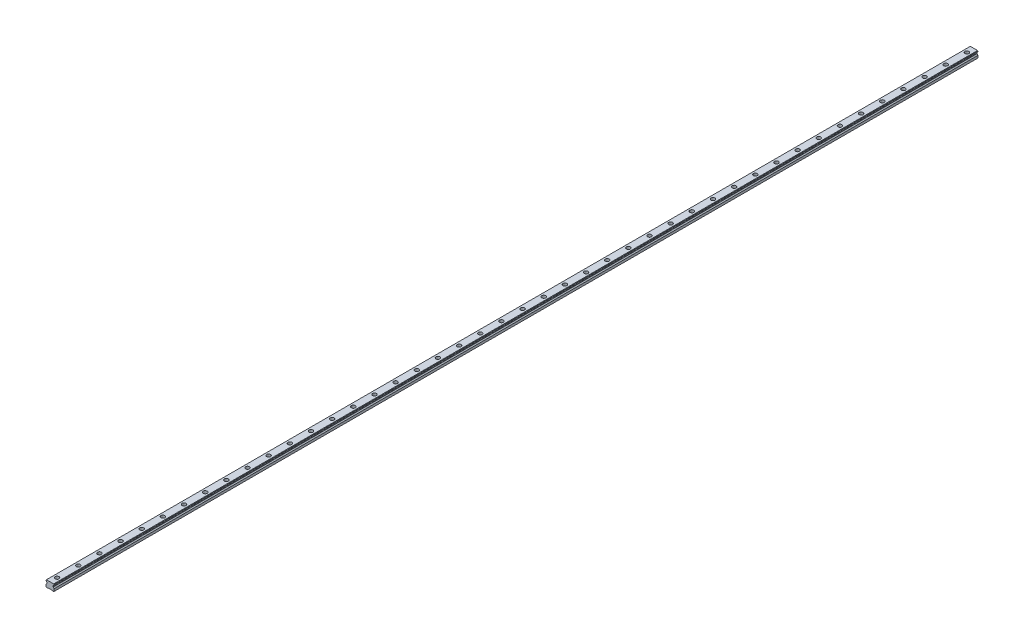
ISO-10303-21;
HEADER;
FILE_DESCRIPTION(('STEP AP214'),'2;1');
FILE_NAME('part.step','',(''),(''),'','','');
FILE_SCHEMA(('AUTOMOTIVE_DESIGN { 1 0 10303 214 1 1 1 1 }'));
ENDSEC;
DATA;
#1=APPLICATION_CONTEXT('core data for automotive mechanical design processes');
#2=APPLICATION_PROTOCOL_DEFINITION('international standard','automotive_design',2000,#1);
#3=PRODUCT_CONTEXT('',#1,'mechanical');
#4=PRODUCT('Part','Part','',(#3));
#5=PRODUCT_RELATED_PRODUCT_CATEGORY('part','',(#4));
#6=PRODUCT_DEFINITION_FORMATION('','',#4);
#7=PRODUCT_DEFINITION_CONTEXT('part definition',#1,'design');
#8=PRODUCT_DEFINITION('design','',#6,#7);
#9=PRODUCT_DEFINITION_SHAPE('','',#8);
#10=(LENGTH_UNIT() NAMED_UNIT(*) SI_UNIT(.MILLI.,.METRE.));
#11=(NAMED_UNIT(*) PLANE_ANGLE_UNIT() SI_UNIT($,.RADIAN.));
#12=(NAMED_UNIT(*) SI_UNIT($,.STERADIAN.) SOLID_ANGLE_UNIT());
#13=UNCERTAINTY_MEASURE_WITH_UNIT(LENGTH_MEASURE(1.E-05),#10,'distance_accuracy_value','');
#14=(GEOMETRIC_REPRESENTATION_CONTEXT(3) GLOBAL_UNCERTAINTY_ASSIGNED_CONTEXT((#13)) GLOBAL_UNIT_ASSIGNED_CONTEXT((#10,
#11,#12)) REPRESENTATION_CONTEXT('',''));
#15=CARTESIAN_POINT('',(0.,0.,0.));
#16=DIRECTION('',(0.,0.,1.));
#17=DIRECTION('',(1.,0.,0.));
#18=AXIS2_PLACEMENT_3D('',#15,#16,#17);
#19=CARTESIAN_POINT('',(0.,10.2,-1290.));
#20=DIRECTION('',(0.,1.,0.));
#21=DIRECTION('',(0.,0.,1.));
#22=AXIS2_PLACEMENT_3D('',#19,#20,#21);
#23=PLANE('',#22);
#24=CARTESIAN_POINT('',(0.,10.2,-1290.));
#25=DIRECTION('',(0.,1.,0.));
#26=DIRECTION('',(0.,0.,1.));
#27=AXIS2_PLACEMENT_3D('',#24,#25,#26);
#28=CIRCLE('',#27,3.49999999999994);
#29=CARTESIAN_POINT('',(0.,10.2,-1286.5));
#30=VERTEX_POINT('',#29);
#31=EDGE_CURVE('E695',#30,#30,#28,.T.);
#32=ORIENTED_EDGE('',*,*,#31,.F.);
#33=EDGE_LOOP('',(#32));
#34=FACE_BOUND('',#33,.T.);
#35=CARTESIAN_POINT('',(0.,10.2,-1290.));
#36=DIRECTION('',(0.,1.,0.));
#37=DIRECTION('',(0.,0.,1.));
#38=AXIS2_PLACEMENT_3D('',#35,#36,#37);
#39=CIRCLE('',#38,5.49999999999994);
#40=CARTESIAN_POINT('',(0.,10.2,-1284.5));
#41=VERTEX_POINT('',#40);
#42=EDGE_CURVE('E11',#41,#41,#39,.T.);
#43=ORIENTED_EDGE('',*,*,#42,.T.);
#44=EDGE_LOOP('',(#43));
#45=FACE_BOUND('',#44,.T.);
#46=ADVANCED_FACE('F39',(#34,#45),#23,.T.);
#47=CARTESIAN_POINT('',(0.,10.2,-1290.));
#48=DIRECTION('',(0.,1.,0.));
#49=DIRECTION('',(0.,0.,1.));
#50=AXIS2_PLACEMENT_3D('',#47,#48,#49);
#51=CYLINDRICAL_SURFACE('',#50,5.49999999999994);
#52=ORIENTED_EDGE('',*,*,#42,.F.);
#53=EDGE_LOOP('',(#52));
#54=FACE_BOUND('',#53,.T.);
#55=CARTESIAN_POINT('',(0.,19.2,-1290.));
#56=DIRECTION('',(0.,1.,0.));
#57=DIRECTION('',(0.,0.,1.));
#58=AXIS2_PLACEMENT_3D('',#55,#56,#57);
#59=CIRCLE('',#58,5.49999999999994);
#60=CARTESIAN_POINT('',(0.,19.2,-1284.5));
#61=VERTEX_POINT('',#60);
#62=EDGE_CURVE('E48',#61,#61,#59,.T.);
#63=ORIENTED_EDGE('',*,*,#62,.T.);
#64=EDGE_LOOP('',(#63));
#65=FACE_BOUND('',#64,.T.);
#66=ADVANCED_FACE('F1294',(#54,#65),#51,.F.);
#67=CARTESIAN_POINT('',(0.,10.2,-1230.));
#68=DIRECTION('',(0.,1.,0.));
#69=DIRECTION('',(0.,0.,1.));
#70=AXIS2_PLACEMENT_3D('',#67,#68,#69);
#71=PLANE('',#70);
#72=CARTESIAN_POINT('',(0.,10.2,-1230.));
#73=DIRECTION('',(0.,1.,0.));
#74=DIRECTION('',(0.,0.,1.));
#75=AXIS2_PLACEMENT_3D('',#72,#73,#74);
#76=CIRCLE('',#75,3.49999999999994);
#77=CARTESIAN_POINT('',(0.,10.2,-1226.5));
#78=VERTEX_POINT('',#77);
#79=EDGE_CURVE('E700',#78,#78,#76,.T.);
#80=ORIENTED_EDGE('',*,*,#79,.F.);
#81=EDGE_LOOP('',(#80));
#82=FACE_BOUND('',#81,.T.);
#83=CARTESIAN_POINT('',(0.,10.2,-1230.));
#84=DIRECTION('',(0.,1.,0.));
#85=DIRECTION('',(0.,0.,1.));
#86=AXIS2_PLACEMENT_3D('',#83,#84,#85);
#87=CIRCLE('',#86,5.49999999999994);
#88=CARTESIAN_POINT('',(0.,10.2,-1224.5));
#89=VERTEX_POINT('',#88);
#90=EDGE_CURVE('E679',#89,#89,#87,.T.);
#91=ORIENTED_EDGE('',*,*,#90,.T.);
#92=EDGE_LOOP('',(#91));
#93=FACE_BOUND('',#92,.T.);
#94=ADVANCED_FACE('F1296',(#82,#93),#71,.T.);
#95=CARTESIAN_POINT('',(0.,10.2,-1230.));
#96=DIRECTION('',(0.,1.,0.));
#97=DIRECTION('',(0.,0.,1.));
#98=AXIS2_PLACEMENT_3D('',#95,#96,#97);
#99=CYLINDRICAL_SURFACE('',#98,5.49999999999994);
#100=ORIENTED_EDGE('',*,*,#90,.F.);
#101=EDGE_LOOP('',(#100));
#102=FACE_BOUND('',#101,.T.);
#103=CARTESIAN_POINT('',(0.,19.2,-1230.));
#104=DIRECTION('',(0.,1.,0.));
#105=DIRECTION('',(0.,0.,1.));
#106=AXIS2_PLACEMENT_3D('',#103,#104,#105);
#107=CIRCLE('',#106,5.49999999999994);
#108=CARTESIAN_POINT('',(0.,19.2,-1224.5));
#109=VERTEX_POINT('',#108);
#110=EDGE_CURVE('E675',#109,#109,#107,.T.);
#111=ORIENTED_EDGE('',*,*,#110,.T.);
#112=EDGE_LOOP('',(#111));
#113=FACE_BOUND('',#112,.T.);
#114=ADVANCED_FACE('F1302',(#102,#113),#99,.F.);
#115=CARTESIAN_POINT('',(0.,10.2,-1170.));
#116=DIRECTION('',(0.,1.,0.));
#117=DIRECTION('',(0.,0.,1.));
#118=AXIS2_PLACEMENT_3D('',#115,#116,#117);
#119=PLANE('',#118);
#120=CARTESIAN_POINT('',(0.,10.2,-1170.));
#121=DIRECTION('',(0.,1.,0.));
#122=DIRECTION('',(0.,0.,1.));
#123=AXIS2_PLACEMENT_3D('',#120,#121,#122);
#124=CIRCLE('',#123,3.49999999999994);
#125=CARTESIAN_POINT('',(0.,10.2,-1166.5));
#126=VERTEX_POINT('',#125);
#127=EDGE_CURVE('E705',#126,#126,#124,.T.);
#128=ORIENTED_EDGE('',*,*,#127,.F.);
#129=EDGE_LOOP('',(#128));
#130=FACE_BOUND('',#129,.T.);
#131=CARTESIAN_POINT('',(0.,10.2,-1170.));
#132=DIRECTION('',(0.,1.,0.));
#133=DIRECTION('',(0.,0.,1.));
#134=AXIS2_PLACEMENT_3D('',#131,#132,#133);
#135=CIRCLE('',#134,5.49999999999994);
#136=CARTESIAN_POINT('',(0.,10.2,-1164.5));
#137=VERTEX_POINT('',#136);
#138=EDGE_CURVE('E671',#137,#137,#135,.T.);
#139=ORIENTED_EDGE('',*,*,#138,.T.);
#140=EDGE_LOOP('',(#139));
#141=FACE_BOUND('',#140,.T.);
#142=ADVANCED_FACE('F1310',(#130,#141),#119,.T.);
#143=CARTESIAN_POINT('',(0.,10.2,-1170.));
#144=DIRECTION('',(0.,1.,0.));
#145=DIRECTION('',(0.,0.,1.));
#146=AXIS2_PLACEMENT_3D('',#143,#144,#145);
#147=CYLINDRICAL_SURFACE('',#146,5.49999999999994);
#148=ORIENTED_EDGE('',*,*,#138,.F.);
#149=EDGE_LOOP('',(#148));
#150=FACE_BOUND('',#149,.T.);
#151=CARTESIAN_POINT('',(0.,19.2,-1170.));
#152=DIRECTION('',(0.,1.,0.));
#153=DIRECTION('',(0.,0.,1.));
#154=AXIS2_PLACEMENT_3D('',#151,#152,#153);
#155=CIRCLE('',#154,5.49999999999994);
#156=CARTESIAN_POINT('',(0.,19.2,-1164.5));
#157=VERTEX_POINT('',#156);
#158=EDGE_CURVE('E667',#157,#157,#155,.T.);
#159=ORIENTED_EDGE('',*,*,#158,.T.);
#160=EDGE_LOOP('',(#159));
#161=FACE_BOUND('',#160,.T.);
#162=ADVANCED_FACE('F1314',(#150,#161),#147,.F.);
#163=CARTESIAN_POINT('',(0.,10.2,-1110.));
#164=DIRECTION('',(0.,1.,0.));
#165=DIRECTION('',(0.,0.,1.));
#166=AXIS2_PLACEMENT_3D('',#163,#164,#165);
#167=PLANE('',#166);
#168=CARTESIAN_POINT('',(0.,10.2,-1110.));
#169=DIRECTION('',(0.,1.,0.));
#170=DIRECTION('',(0.,0.,1.));
#171=AXIS2_PLACEMENT_3D('',#168,#169,#170);
#172=CIRCLE('',#171,3.49999999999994);
#173=CARTESIAN_POINT('',(0.,10.2,-1106.5));
#174=VERTEX_POINT('',#173);
#175=EDGE_CURVE('E710',#174,#174,#172,.T.);
#176=ORIENTED_EDGE('',*,*,#175,.F.);
#177=EDGE_LOOP('',(#176));
#178=FACE_BOUND('',#177,.T.);
#179=CARTESIAN_POINT('',(0.,10.2,-1110.));
#180=DIRECTION('',(0.,1.,0.));
#181=DIRECTION('',(0.,0.,1.));
#182=AXIS2_PLACEMENT_3D('',#179,#180,#181);
#183=CIRCLE('',#182,5.49999999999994);
#184=CARTESIAN_POINT('',(0.,10.2,-1104.5));
#185=VERTEX_POINT('',#184);
#186=EDGE_CURVE('E663',#185,#185,#183,.T.);
#187=ORIENTED_EDGE('',*,*,#186,.T.);
#188=EDGE_LOOP('',(#187));
#189=FACE_BOUND('',#188,.T.);
#190=ADVANCED_FACE('F1318',(#178,#189),#167,.T.);
#191=CARTESIAN_POINT('',(0.,10.2,-1110.));
#192=DIRECTION('',(0.,1.,0.));
#193=DIRECTION('',(0.,0.,1.));
#194=AXIS2_PLACEMENT_3D('',#191,#192,#193);
#195=CYLINDRICAL_SURFACE('',#194,5.49999999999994);
#196=ORIENTED_EDGE('',*,*,#186,.F.);
#197=EDGE_LOOP('',(#196));
#198=FACE_BOUND('',#197,.T.);
#199=CARTESIAN_POINT('',(0.,19.2,-1110.));
#200=DIRECTION('',(0.,1.,0.));
#201=DIRECTION('',(0.,0.,1.));
#202=AXIS2_PLACEMENT_3D('',#199,#200,#201);
#203=CIRCLE('',#202,5.49999999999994);
#204=CARTESIAN_POINT('',(0.,19.2,-1104.5));
#205=VERTEX_POINT('',#204);
#206=EDGE_CURVE('E659',#205,#205,#203,.T.);
#207=ORIENTED_EDGE('',*,*,#206,.T.);
#208=EDGE_LOOP('',(#207));
#209=FACE_BOUND('',#208,.T.);
#210=ADVANCED_FACE('F1322',(#198,#209),#195,.F.);
#211=CARTESIAN_POINT('',(0.,10.2,-1050.));
#212=DIRECTION('',(0.,1.,0.));
#213=DIRECTION('',(0.,0.,1.));
#214=AXIS2_PLACEMENT_3D('',#211,#212,#213);
#215=PLANE('',#214);
#216=CARTESIAN_POINT('',(0.,10.2,-1050.));
#217=DIRECTION('',(0.,1.,0.));
#218=DIRECTION('',(0.,0.,1.));
#219=AXIS2_PLACEMENT_3D('',#216,#217,#218);
#220=CIRCLE('',#219,3.49999999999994);
#221=CARTESIAN_POINT('',(0.,10.2,-1046.5));
#222=VERTEX_POINT('',#221);
#223=EDGE_CURVE('E715',#222,#222,#220,.T.);
#224=ORIENTED_EDGE('',*,*,#223,.F.);
#225=EDGE_LOOP('',(#224));
#226=FACE_BOUND('',#225,.T.);
#227=CARTESIAN_POINT('',(0.,10.2,-1050.));
#228=DIRECTION('',(0.,1.,0.));
#229=DIRECTION('',(0.,0.,1.));
#230=AXIS2_PLACEMENT_3D('',#227,#228,#229);
#231=CIRCLE('',#230,5.49999999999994);
#232=CARTESIAN_POINT('',(0.,10.2,-1044.5));
#233=VERTEX_POINT('',#232);
#234=EDGE_CURVE('E655',#233,#233,#231,.T.);
#235=ORIENTED_EDGE('',*,*,#234,.T.);
#236=EDGE_LOOP('',(#235));
#237=FACE_BOUND('',#236,.T.);
#238=ADVANCED_FACE('F1326',(#226,#237),#215,.T.);
#239=CARTESIAN_POINT('',(0.,10.2,-1050.));
#240=DIRECTION('',(0.,1.,0.));
#241=DIRECTION('',(0.,0.,1.));
#242=AXIS2_PLACEMENT_3D('',#239,#240,#241);
#243=CYLINDRICAL_SURFACE('',#242,5.49999999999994);
#244=ORIENTED_EDGE('',*,*,#234,.F.);
#245=EDGE_LOOP('',(#244));
#246=FACE_BOUND('',#245,.T.);
#247=CARTESIAN_POINT('',(0.,19.2,-1050.));
#248=DIRECTION('',(0.,1.,0.));
#249=DIRECTION('',(0.,0.,1.));
#250=AXIS2_PLACEMENT_3D('',#247,#248,#249);
#251=CIRCLE('',#250,5.49999999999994);
#252=CARTESIAN_POINT('',(0.,19.2,-1044.5));
#253=VERTEX_POINT('',#252);
#254=EDGE_CURVE('E651',#253,#253,#251,.T.);
#255=ORIENTED_EDGE('',*,*,#254,.T.);
#256=EDGE_LOOP('',(#255));
#257=FACE_BOUND('',#256,.T.);
#258=ADVANCED_FACE('F1330',(#246,#257),#243,.F.);
#259=CARTESIAN_POINT('',(0.,10.2,-990.));
#260=DIRECTION('',(0.,1.,0.));
#261=DIRECTION('',(0.,0.,1.));
#262=AXIS2_PLACEMENT_3D('',#259,#260,#261);
#263=PLANE('',#262);
#264=CARTESIAN_POINT('',(0.,10.2,-990.));
#265=DIRECTION('',(0.,1.,0.));
#266=DIRECTION('',(0.,0.,1.));
#267=AXIS2_PLACEMENT_3D('',#264,#265,#266);
#268=CIRCLE('',#267,3.49999999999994);
#269=CARTESIAN_POINT('',(0.,10.2,-986.5));
#270=VERTEX_POINT('',#269);
#271=EDGE_CURVE('E720',#270,#270,#268,.T.);
#272=ORIENTED_EDGE('',*,*,#271,.F.);
#273=EDGE_LOOP('',(#272));
#274=FACE_BOUND('',#273,.T.);
#275=CARTESIAN_POINT('',(0.,10.2,-990.));
#276=DIRECTION('',(0.,1.,0.));
#277=DIRECTION('',(0.,0.,1.));
#278=AXIS2_PLACEMENT_3D('',#275,#276,#277);
#279=CIRCLE('',#278,5.49999999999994);
#280=CARTESIAN_POINT('',(0.,10.2,-984.5));
#281=VERTEX_POINT('',#280);
#282=EDGE_CURVE('E647',#281,#281,#279,.T.);
#283=ORIENTED_EDGE('',*,*,#282,.T.);
#284=EDGE_LOOP('',(#283));
#285=FACE_BOUND('',#284,.T.);
#286=ADVANCED_FACE('F1334',(#274,#285),#263,.T.);
#287=CARTESIAN_POINT('',(0.,10.2,-990.));
#288=DIRECTION('',(0.,1.,0.));
#289=DIRECTION('',(0.,0.,1.));
#290=AXIS2_PLACEMENT_3D('',#287,#288,#289);
#291=CYLINDRICAL_SURFACE('',#290,5.49999999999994);
#292=ORIENTED_EDGE('',*,*,#282,.F.);
#293=EDGE_LOOP('',(#292));
#294=FACE_BOUND('',#293,.T.);
#295=CARTESIAN_POINT('',(0.,19.2,-990.));
#296=DIRECTION('',(0.,1.,0.));
#297=DIRECTION('',(0.,0.,1.));
#298=AXIS2_PLACEMENT_3D('',#295,#296,#297);
#299=CIRCLE('',#298,5.49999999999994);
#300=CARTESIAN_POINT('',(0.,19.2,-984.5));
#301=VERTEX_POINT('',#300);
#302=EDGE_CURVE('E643',#301,#301,#299,.T.);
#303=ORIENTED_EDGE('',*,*,#302,.T.);
#304=EDGE_LOOP('',(#303));
#305=FACE_BOUND('',#304,.T.);
#306=ADVANCED_FACE('F1338',(#294,#305),#291,.F.);
#307=CARTESIAN_POINT('',(0.,10.2,-930.));
#308=DIRECTION('',(0.,1.,0.));
#309=DIRECTION('',(0.,0.,1.));
#310=AXIS2_PLACEMENT_3D('',#307,#308,#309);
#311=PLANE('',#310);
#312=CARTESIAN_POINT('',(0.,10.2,-930.));
#313=DIRECTION('',(0.,1.,0.));
#314=DIRECTION('',(0.,0.,1.));
#315=AXIS2_PLACEMENT_3D('',#312,#313,#314);
#316=CIRCLE('',#315,3.49999999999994);
#317=CARTESIAN_POINT('',(0.,10.2,-926.5));
#318=VERTEX_POINT('',#317);
#319=EDGE_CURVE('E725',#318,#318,#316,.T.);
#320=ORIENTED_EDGE('',*,*,#319,.F.);
#321=EDGE_LOOP('',(#320));
#322=FACE_BOUND('',#321,.T.);
#323=CARTESIAN_POINT('',(0.,10.2,-930.));
#324=DIRECTION('',(0.,1.,0.));
#325=DIRECTION('',(0.,0.,1.));
#326=AXIS2_PLACEMENT_3D('',#323,#324,#325);
#327=CIRCLE('',#326,5.49999999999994);
#328=CARTESIAN_POINT('',(0.,10.2,-924.5));
#329=VERTEX_POINT('',#328);
#330=EDGE_CURVE('E639',#329,#329,#327,.T.);
#331=ORIENTED_EDGE('',*,*,#330,.T.);
#332=EDGE_LOOP('',(#331));
#333=FACE_BOUND('',#332,.T.);
#334=ADVANCED_FACE('F1342',(#322,#333),#311,.T.);
#335=CARTESIAN_POINT('',(0.,10.2,-930.));
#336=DIRECTION('',(0.,1.,0.));
#337=DIRECTION('',(0.,0.,1.));
#338=AXIS2_PLACEMENT_3D('',#335,#336,#337);
#339=CYLINDRICAL_SURFACE('',#338,5.49999999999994);
#340=ORIENTED_EDGE('',*,*,#330,.F.);
#341=EDGE_LOOP('',(#340));
#342=FACE_BOUND('',#341,.T.);
#343=CARTESIAN_POINT('',(0.,19.2,-930.));
#344=DIRECTION('',(0.,1.,0.));
#345=DIRECTION('',(0.,0.,1.));
#346=AXIS2_PLACEMENT_3D('',#343,#344,#345);
#347=CIRCLE('',#346,5.49999999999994);
#348=CARTESIAN_POINT('',(0.,19.2,-924.5));
#349=VERTEX_POINT('',#348);
#350=EDGE_CURVE('E635',#349,#349,#347,.T.);
#351=ORIENTED_EDGE('',*,*,#350,.T.);
#352=EDGE_LOOP('',(#351));
#353=FACE_BOUND('',#352,.T.);
#354=ADVANCED_FACE('F1346',(#342,#353),#339,.F.);
#355=CARTESIAN_POINT('',(0.,10.2,-870.));
#356=DIRECTION('',(0.,1.,0.));
#357=DIRECTION('',(0.,0.,1.));
#358=AXIS2_PLACEMENT_3D('',#355,#356,#357);
#359=PLANE('',#358);
#360=CARTESIAN_POINT('',(0.,10.2,-870.));
#361=DIRECTION('',(0.,1.,0.));
#362=DIRECTION('',(0.,0.,1.));
#363=AXIS2_PLACEMENT_3D('',#360,#361,#362);
#364=CIRCLE('',#363,3.49999999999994);
#365=CARTESIAN_POINT('',(0.,10.2,-866.5));
#366=VERTEX_POINT('',#365);
#367=EDGE_CURVE('E730',#366,#366,#364,.T.);
#368=ORIENTED_EDGE('',*,*,#367,.F.);
#369=EDGE_LOOP('',(#368));
#370=FACE_BOUND('',#369,.T.);
#371=CARTESIAN_POINT('',(0.,10.2,-870.));
#372=DIRECTION('',(0.,1.,0.));
#373=DIRECTION('',(0.,0.,1.));
#374=AXIS2_PLACEMENT_3D('',#371,#372,#373);
#375=CIRCLE('',#374,5.49999999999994);
#376=CARTESIAN_POINT('',(0.,10.2,-864.5));
#377=VERTEX_POINT('',#376);
#378=EDGE_CURVE('E631',#377,#377,#375,.T.);
#379=ORIENTED_EDGE('',*,*,#378,.T.);
#380=EDGE_LOOP('',(#379));
#381=FACE_BOUND('',#380,.T.);
#382=ADVANCED_FACE('F1350',(#370,#381),#359,.T.);
#383=CARTESIAN_POINT('',(0.,10.2,-870.));
#384=DIRECTION('',(0.,1.,0.));
#385=DIRECTION('',(0.,0.,1.));
#386=AXIS2_PLACEMENT_3D('',#383,#384,#385);
#387=CYLINDRICAL_SURFACE('',#386,5.49999999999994);
#388=ORIENTED_EDGE('',*,*,#378,.F.);
#389=EDGE_LOOP('',(#388));
#390=FACE_BOUND('',#389,.T.);
#391=CARTESIAN_POINT('',(0.,19.2,-870.));
#392=DIRECTION('',(0.,1.,0.));
#393=DIRECTION('',(0.,0.,1.));
#394=AXIS2_PLACEMENT_3D('',#391,#392,#393);
#395=CIRCLE('',#394,5.49999999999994);
#396=CARTESIAN_POINT('',(0.,19.2,-864.5));
#397=VERTEX_POINT('',#396);
#398=EDGE_CURVE('E627',#397,#397,#395,.T.);
#399=ORIENTED_EDGE('',*,*,#398,.T.);
#400=EDGE_LOOP('',(#399));
#401=FACE_BOUND('',#400,.T.);
#402=ADVANCED_FACE('F1354',(#390,#401),#387,.F.);
#403=CARTESIAN_POINT('',(0.,10.2,-810.));
#404=DIRECTION('',(0.,1.,0.));
#405=DIRECTION('',(0.,0.,1.));
#406=AXIS2_PLACEMENT_3D('',#403,#404,#405);
#407=PLANE('',#406);
#408=CARTESIAN_POINT('',(0.,10.2,-810.));
#409=DIRECTION('',(0.,1.,0.));
#410=DIRECTION('',(0.,0.,1.));
#411=AXIS2_PLACEMENT_3D('',#408,#409,#410);
#412=CIRCLE('',#411,3.49999999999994);
#413=CARTESIAN_POINT('',(0.,10.2,-806.5));
#414=VERTEX_POINT('',#413);
#415=EDGE_CURVE('E735',#414,#414,#412,.T.);
#416=ORIENTED_EDGE('',*,*,#415,.F.);
#417=EDGE_LOOP('',(#416));
#418=FACE_BOUND('',#417,.T.);
#419=CARTESIAN_POINT('',(0.,10.2,-810.));
#420=DIRECTION('',(0.,1.,0.));
#421=DIRECTION('',(0.,0.,1.));
#422=AXIS2_PLACEMENT_3D('',#419,#420,#421);
#423=CIRCLE('',#422,5.49999999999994);
#424=CARTESIAN_POINT('',(0.,10.2,-804.5));
#425=VERTEX_POINT('',#424);
#426=EDGE_CURVE('E623',#425,#425,#423,.T.);
#427=ORIENTED_EDGE('',*,*,#426,.T.);
#428=EDGE_LOOP('',(#427));
#429=FACE_BOUND('',#428,.T.);
#430=ADVANCED_FACE('F1358',(#418,#429),#407,.T.);
#431=CARTESIAN_POINT('',(0.,10.2,-810.));
#432=DIRECTION('',(0.,1.,0.));
#433=DIRECTION('',(0.,0.,1.));
#434=AXIS2_PLACEMENT_3D('',#431,#432,#433);
#435=CYLINDRICAL_SURFACE('',#434,5.49999999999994);
#436=ORIENTED_EDGE('',*,*,#426,.F.);
#437=EDGE_LOOP('',(#436));
#438=FACE_BOUND('',#437,.T.);
#439=CARTESIAN_POINT('',(0.,19.2,-810.));
#440=DIRECTION('',(0.,1.,0.));
#441=DIRECTION('',(0.,0.,1.));
#442=AXIS2_PLACEMENT_3D('',#439,#440,#441);
#443=CIRCLE('',#442,5.49999999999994);
#444=CARTESIAN_POINT('',(0.,19.2,-804.5));
#445=VERTEX_POINT('',#444);
#446=EDGE_CURVE('E619',#445,#445,#443,.T.);
#447=ORIENTED_EDGE('',*,*,#446,.T.);
#448=EDGE_LOOP('',(#447));
#449=FACE_BOUND('',#448,.T.);
#450=ADVANCED_FACE('F1362',(#438,#449),#435,.F.);
#451=CARTESIAN_POINT('',(0.,10.2,-750.));
#452=DIRECTION('',(0.,1.,0.));
#453=DIRECTION('',(0.,0.,1.));
#454=AXIS2_PLACEMENT_3D('',#451,#452,#453);
#455=PLANE('',#454);
#456=CARTESIAN_POINT('',(0.,10.2,-750.));
#457=DIRECTION('',(0.,1.,0.));
#458=DIRECTION('',(0.,0.,1.));
#459=AXIS2_PLACEMENT_3D('',#456,#457,#458);
#460=CIRCLE('',#459,3.49999999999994);
#461=CARTESIAN_POINT('',(0.,10.2,-746.5));
#462=VERTEX_POINT('',#461);
#463=EDGE_CURVE('E740',#462,#462,#460,.T.);
#464=ORIENTED_EDGE('',*,*,#463,.F.);
#465=EDGE_LOOP('',(#464));
#466=FACE_BOUND('',#465,.T.);
#467=CARTESIAN_POINT('',(0.,10.2,-750.));
#468=DIRECTION('',(0.,1.,0.));
#469=DIRECTION('',(0.,0.,1.));
#470=AXIS2_PLACEMENT_3D('',#467,#468,#469);
#471=CIRCLE('',#470,5.49999999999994);
#472=CARTESIAN_POINT('',(0.,10.2,-744.5));
#473=VERTEX_POINT('',#472);
#474=EDGE_CURVE('E615',#473,#473,#471,.T.);
#475=ORIENTED_EDGE('',*,*,#474,.T.);
#476=EDGE_LOOP('',(#475));
#477=FACE_BOUND('',#476,.T.);
#478=ADVANCED_FACE('F1366',(#466,#477),#455,.T.);
#479=CARTESIAN_POINT('',(0.,10.2,-750.));
#480=DIRECTION('',(0.,1.,0.));
#481=DIRECTION('',(0.,0.,1.));
#482=AXIS2_PLACEMENT_3D('',#479,#480,#481);
#483=CYLINDRICAL_SURFACE('',#482,5.49999999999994);
#484=ORIENTED_EDGE('',*,*,#474,.F.);
#485=EDGE_LOOP('',(#484));
#486=FACE_BOUND('',#485,.T.);
#487=CARTESIAN_POINT('',(0.,19.2,-750.));
#488=DIRECTION('',(0.,1.,0.));
#489=DIRECTION('',(0.,0.,1.));
#490=AXIS2_PLACEMENT_3D('',#487,#488,#489);
#491=CIRCLE('',#490,5.49999999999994);
#492=CARTESIAN_POINT('',(0.,19.2,-744.5));
#493=VERTEX_POINT('',#492);
#494=EDGE_CURVE('E611',#493,#493,#491,.T.);
#495=ORIENTED_EDGE('',*,*,#494,.T.);
#496=EDGE_LOOP('',(#495));
#497=FACE_BOUND('',#496,.T.);
#498=ADVANCED_FACE('F1370',(#486,#497),#483,.F.);
#499=CARTESIAN_POINT('',(0.,10.2,-690.));
#500=DIRECTION('',(0.,1.,0.));
#501=DIRECTION('',(0.,0.,1.));
#502=AXIS2_PLACEMENT_3D('',#499,#500,#501);
#503=PLANE('',#502);
#504=CARTESIAN_POINT('',(0.,10.2,-690.));
#505=DIRECTION('',(0.,1.,0.));
#506=DIRECTION('',(0.,0.,1.));
#507=AXIS2_PLACEMENT_3D('',#504,#505,#506);
#508=CIRCLE('',#507,3.49999999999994);
#509=CARTESIAN_POINT('',(0.,10.2,-686.5));
#510=VERTEX_POINT('',#509);
#511=EDGE_CURVE('E745',#510,#510,#508,.T.);
#512=ORIENTED_EDGE('',*,*,#511,.F.);
#513=EDGE_LOOP('',(#512));
#514=FACE_BOUND('',#513,.T.);
#515=CARTESIAN_POINT('',(0.,10.2,-690.));
#516=DIRECTION('',(0.,1.,0.));
#517=DIRECTION('',(0.,0.,1.));
#518=AXIS2_PLACEMENT_3D('',#515,#516,#517);
#519=CIRCLE('',#518,5.49999999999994);
#520=CARTESIAN_POINT('',(0.,10.2,-684.5));
#521=VERTEX_POINT('',#520);
#522=EDGE_CURVE('E607',#521,#521,#519,.T.);
#523=ORIENTED_EDGE('',*,*,#522,.T.);
#524=EDGE_LOOP('',(#523));
#525=FACE_BOUND('',#524,.T.);
#526=ADVANCED_FACE('F1374',(#514,#525),#503,.T.);
#527=CARTESIAN_POINT('',(0.,10.2,-690.));
#528=DIRECTION('',(0.,1.,0.));
#529=DIRECTION('',(0.,0.,1.));
#530=AXIS2_PLACEMENT_3D('',#527,#528,#529);
#531=CYLINDRICAL_SURFACE('',#530,5.49999999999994);
#532=ORIENTED_EDGE('',*,*,#522,.F.);
#533=EDGE_LOOP('',(#532));
#534=FACE_BOUND('',#533,.T.);
#535=CARTESIAN_POINT('',(0.,19.2,-690.));
#536=DIRECTION('',(0.,1.,0.));
#537=DIRECTION('',(0.,0.,1.));
#538=AXIS2_PLACEMENT_3D('',#535,#536,#537);
#539=CIRCLE('',#538,5.49999999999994);
#540=CARTESIAN_POINT('',(0.,19.2,-684.5));
#541=VERTEX_POINT('',#540);
#542=EDGE_CURVE('E603',#541,#541,#539,.T.);
#543=ORIENTED_EDGE('',*,*,#542,.T.);
#544=EDGE_LOOP('',(#543));
#545=FACE_BOUND('',#544,.T.);
#546=ADVANCED_FACE('F1378',(#534,#545),#531,.F.);
#547=CARTESIAN_POINT('',(0.,10.2,-630.));
#548=DIRECTION('',(0.,1.,0.));
#549=DIRECTION('',(0.,0.,1.));
#550=AXIS2_PLACEMENT_3D('',#547,#548,#549);
#551=PLANE('',#550);
#552=CARTESIAN_POINT('',(0.,10.2,-630.));
#553=DIRECTION('',(0.,1.,0.));
#554=DIRECTION('',(0.,0.,1.));
#555=AXIS2_PLACEMENT_3D('',#552,#553,#554);
#556=CIRCLE('',#555,3.49999999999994);
#557=CARTESIAN_POINT('',(0.,10.2,-626.5));
#558=VERTEX_POINT('',#557);
#559=EDGE_CURVE('E750',#558,#558,#556,.T.);
#560=ORIENTED_EDGE('',*,*,#559,.F.);
#561=EDGE_LOOP('',(#560));
#562=FACE_BOUND('',#561,.T.);
#563=CARTESIAN_POINT('',(0.,10.2,-630.));
#564=DIRECTION('',(0.,1.,0.));
#565=DIRECTION('',(0.,0.,1.));
#566=AXIS2_PLACEMENT_3D('',#563,#564,#565);
#567=CIRCLE('',#566,5.49999999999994);
#568=CARTESIAN_POINT('',(0.,10.2,-624.5));
#569=VERTEX_POINT('',#568);
#570=EDGE_CURVE('E599',#569,#569,#567,.T.);
#571=ORIENTED_EDGE('',*,*,#570,.T.);
#572=EDGE_LOOP('',(#571));
#573=FACE_BOUND('',#572,.T.);
#574=ADVANCED_FACE('F1382',(#562,#573),#551,.T.);
#575=CARTESIAN_POINT('',(0.,10.2,-630.));
#576=DIRECTION('',(0.,1.,0.));
#577=DIRECTION('',(0.,0.,1.));
#578=AXIS2_PLACEMENT_3D('',#575,#576,#577);
#579=CYLINDRICAL_SURFACE('',#578,5.49999999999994);
#580=ORIENTED_EDGE('',*,*,#570,.F.);
#581=EDGE_LOOP('',(#580));
#582=FACE_BOUND('',#581,.T.);
#583=CARTESIAN_POINT('',(0.,19.2,-630.));
#584=DIRECTION('',(0.,1.,0.));
#585=DIRECTION('',(0.,0.,1.));
#586=AXIS2_PLACEMENT_3D('',#583,#584,#585);
#587=CIRCLE('',#586,5.49999999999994);
#588=CARTESIAN_POINT('',(0.,19.2,-624.5));
#589=VERTEX_POINT('',#588);
#590=EDGE_CURVE('E595',#589,#589,#587,.T.);
#591=ORIENTED_EDGE('',*,*,#590,.T.);
#592=EDGE_LOOP('',(#591));
#593=FACE_BOUND('',#592,.T.);
#594=ADVANCED_FACE('F1386',(#582,#593),#579,.F.);
#595=CARTESIAN_POINT('',(0.,10.2,-570.));
#596=DIRECTION('',(0.,1.,0.));
#597=DIRECTION('',(0.,0.,1.));
#598=AXIS2_PLACEMENT_3D('',#595,#596,#597);
#599=PLANE('',#598);
#600=CARTESIAN_POINT('',(0.,10.2,-570.));
#601=DIRECTION('',(0.,1.,0.));
#602=DIRECTION('',(0.,0.,1.));
#603=AXIS2_PLACEMENT_3D('',#600,#601,#602);
#604=CIRCLE('',#603,3.49999999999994);
#605=CARTESIAN_POINT('',(0.,10.2,-566.5));
#606=VERTEX_POINT('',#605);
#607=EDGE_CURVE('E755',#606,#606,#604,.T.);
#608=ORIENTED_EDGE('',*,*,#607,.F.);
#609=EDGE_LOOP('',(#608));
#610=FACE_BOUND('',#609,.T.);
#611=CARTESIAN_POINT('',(0.,10.2,-570.));
#612=DIRECTION('',(0.,1.,0.));
#613=DIRECTION('',(0.,0.,1.));
#614=AXIS2_PLACEMENT_3D('',#611,#612,#613);
#615=CIRCLE('',#614,5.49999999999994);
#616=CARTESIAN_POINT('',(0.,10.2,-564.5));
#617=VERTEX_POINT('',#616);
#618=EDGE_CURVE('E591',#617,#617,#615,.T.);
#619=ORIENTED_EDGE('',*,*,#618,.T.);
#620=EDGE_LOOP('',(#619));
#621=FACE_BOUND('',#620,.T.);
#622=ADVANCED_FACE('F1390',(#610,#621),#599,.T.);
#623=CARTESIAN_POINT('',(0.,10.2,-570.));
#624=DIRECTION('',(0.,1.,0.));
#625=DIRECTION('',(0.,0.,1.));
#626=AXIS2_PLACEMENT_3D('',#623,#624,#625);
#627=CYLINDRICAL_SURFACE('',#626,5.49999999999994);
#628=ORIENTED_EDGE('',*,*,#618,.F.);
#629=EDGE_LOOP('',(#628));
#630=FACE_BOUND('',#629,.T.);
#631=CARTESIAN_POINT('',(0.,19.2,-570.));
#632=DIRECTION('',(0.,1.,0.));
#633=DIRECTION('',(0.,0.,1.));
#634=AXIS2_PLACEMENT_3D('',#631,#632,#633);
#635=CIRCLE('',#634,5.49999999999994);
#636=CARTESIAN_POINT('',(0.,19.2,-564.5));
#637=VERTEX_POINT('',#636);
#638=EDGE_CURVE('E587',#637,#637,#635,.T.);
#639=ORIENTED_EDGE('',*,*,#638,.T.);
#640=EDGE_LOOP('',(#639));
#641=FACE_BOUND('',#640,.T.);
#642=ADVANCED_FACE('F1394',(#630,#641),#627,.F.);
#643=CARTESIAN_POINT('',(0.,10.2,-510.));
#644=DIRECTION('',(0.,1.,0.));
#645=DIRECTION('',(0.,0.,1.));
#646=AXIS2_PLACEMENT_3D('',#643,#644,#645);
#647=PLANE('',#646);
#648=CARTESIAN_POINT('',(0.,10.2,-510.));
#649=DIRECTION('',(0.,1.,0.));
#650=DIRECTION('',(0.,0.,1.));
#651=AXIS2_PLACEMENT_3D('',#648,#649,#650);
#652=CIRCLE('',#651,3.49999999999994);
#653=CARTESIAN_POINT('',(0.,10.2,-506.5));
#654=VERTEX_POINT('',#653);
#655=EDGE_CURVE('E760',#654,#654,#652,.T.);
#656=ORIENTED_EDGE('',*,*,#655,.F.);
#657=EDGE_LOOP('',(#656));
#658=FACE_BOUND('',#657,.T.);
#659=CARTESIAN_POINT('',(0.,10.2,-510.));
#660=DIRECTION('',(0.,1.,0.));
#661=DIRECTION('',(0.,0.,1.));
#662=AXIS2_PLACEMENT_3D('',#659,#660,#661);
#663=CIRCLE('',#662,5.49999999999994);
#664=CARTESIAN_POINT('',(0.,10.2,-504.5));
#665=VERTEX_POINT('',#664);
#666=EDGE_CURVE('E583',#665,#665,#663,.T.);
#667=ORIENTED_EDGE('',*,*,#666,.T.);
#668=EDGE_LOOP('',(#667));
#669=FACE_BOUND('',#668,.T.);
#670=ADVANCED_FACE('F1398',(#658,#669),#647,.T.);
#671=CARTESIAN_POINT('',(0.,10.2,-510.));
#672=DIRECTION('',(0.,1.,0.));
#673=DIRECTION('',(0.,0.,1.));
#674=AXIS2_PLACEMENT_3D('',#671,#672,#673);
#675=CYLINDRICAL_SURFACE('',#674,5.49999999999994);
#676=ORIENTED_EDGE('',*,*,#666,.F.);
#677=EDGE_LOOP('',(#676));
#678=FACE_BOUND('',#677,.T.);
#679=CARTESIAN_POINT('',(0.,19.2,-510.));
#680=DIRECTION('',(0.,1.,0.));
#681=DIRECTION('',(0.,0.,1.));
#682=AXIS2_PLACEMENT_3D('',#679,#680,#681);
#683=CIRCLE('',#682,5.49999999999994);
#684=CARTESIAN_POINT('',(0.,19.2,-504.5));
#685=VERTEX_POINT('',#684);
#686=EDGE_CURVE('E579',#685,#685,#683,.T.);
#687=ORIENTED_EDGE('',*,*,#686,.T.);
#688=EDGE_LOOP('',(#687));
#689=FACE_BOUND('',#688,.T.);
#690=ADVANCED_FACE('F1402',(#678,#689),#675,.F.);
#691=CARTESIAN_POINT('',(0.,10.2,-450.));
#692=DIRECTION('',(0.,1.,0.));
#693=DIRECTION('',(0.,0.,1.));
#694=AXIS2_PLACEMENT_3D('',#691,#692,#693);
#695=PLANE('',#694);
#696=CARTESIAN_POINT('',(0.,10.2,-450.));
#697=DIRECTION('',(0.,1.,0.));
#698=DIRECTION('',(0.,0.,1.));
#699=AXIS2_PLACEMENT_3D('',#696,#697,#698);
#700=CIRCLE('',#699,3.49999999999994);
#701=CARTESIAN_POINT('',(0.,10.2,-446.5));
#702=VERTEX_POINT('',#701);
#703=EDGE_CURVE('E765',#702,#702,#700,.T.);
#704=ORIENTED_EDGE('',*,*,#703,.F.);
#705=EDGE_LOOP('',(#704));
#706=FACE_BOUND('',#705,.T.);
#707=CARTESIAN_POINT('',(0.,10.2,-450.));
#708=DIRECTION('',(0.,1.,0.));
#709=DIRECTION('',(0.,0.,1.));
#710=AXIS2_PLACEMENT_3D('',#707,#708,#709);
#711=CIRCLE('',#710,5.49999999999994);
#712=CARTESIAN_POINT('',(0.,10.2,-444.5));
#713=VERTEX_POINT('',#712);
#714=EDGE_CURVE('E575',#713,#713,#711,.T.);
#715=ORIENTED_EDGE('',*,*,#714,.T.);
#716=EDGE_LOOP('',(#715));
#717=FACE_BOUND('',#716,.T.);
#718=ADVANCED_FACE('F1406',(#706,#717),#695,.T.);
#719=CARTESIAN_POINT('',(0.,10.2,-450.));
#720=DIRECTION('',(0.,1.,0.));
#721=DIRECTION('',(0.,0.,1.));
#722=AXIS2_PLACEMENT_3D('',#719,#720,#721);
#723=CYLINDRICAL_SURFACE('',#722,5.49999999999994);
#724=ORIENTED_EDGE('',*,*,#714,.F.);
#725=EDGE_LOOP('',(#724));
#726=FACE_BOUND('',#725,.T.);
#727=CARTESIAN_POINT('',(0.,19.2,-450.));
#728=DIRECTION('',(0.,1.,0.));
#729=DIRECTION('',(0.,0.,1.));
#730=AXIS2_PLACEMENT_3D('',#727,#728,#729);
#731=CIRCLE('',#730,5.49999999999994);
#732=CARTESIAN_POINT('',(0.,19.2,-444.5));
#733=VERTEX_POINT('',#732);
#734=EDGE_CURVE('E571',#733,#733,#731,.T.);
#735=ORIENTED_EDGE('',*,*,#734,.T.);
#736=EDGE_LOOP('',(#735));
#737=FACE_BOUND('',#736,.T.);
#738=ADVANCED_FACE('F1410',(#726,#737),#723,.F.);
#739=CARTESIAN_POINT('',(0.,10.2,-390.));
#740=DIRECTION('',(0.,1.,0.));
#741=DIRECTION('',(0.,0.,1.));
#742=AXIS2_PLACEMENT_3D('',#739,#740,#741);
#743=PLANE('',#742);
#744=CARTESIAN_POINT('',(0.,10.2,-390.));
#745=DIRECTION('',(0.,1.,0.));
#746=DIRECTION('',(0.,0.,1.));
#747=AXIS2_PLACEMENT_3D('',#744,#745,#746);
#748=CIRCLE('',#747,3.49999999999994);
#749=CARTESIAN_POINT('',(0.,10.2,-386.5));
#750=VERTEX_POINT('',#749);
#751=EDGE_CURVE('E770',#750,#750,#748,.T.);
#752=ORIENTED_EDGE('',*,*,#751,.F.);
#753=EDGE_LOOP('',(#752));
#754=FACE_BOUND('',#753,.T.);
#755=CARTESIAN_POINT('',(0.,10.2,-390.));
#756=DIRECTION('',(0.,1.,0.));
#757=DIRECTION('',(0.,0.,1.));
#758=AXIS2_PLACEMENT_3D('',#755,#756,#757);
#759=CIRCLE('',#758,5.49999999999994);
#760=CARTESIAN_POINT('',(0.,10.2,-384.5));
#761=VERTEX_POINT('',#760);
#762=EDGE_CURVE('E567',#761,#761,#759,.T.);
#763=ORIENTED_EDGE('',*,*,#762,.T.);
#764=EDGE_LOOP('',(#763));
#765=FACE_BOUND('',#764,.T.);
#766=ADVANCED_FACE('F1414',(#754,#765),#743,.T.);
#767=CARTESIAN_POINT('',(0.,10.2,-390.));
#768=DIRECTION('',(0.,1.,0.));
#769=DIRECTION('',(0.,0.,1.));
#770=AXIS2_PLACEMENT_3D('',#767,#768,#769);
#771=CYLINDRICAL_SURFACE('',#770,5.49999999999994);
#772=ORIENTED_EDGE('',*,*,#762,.F.);
#773=EDGE_LOOP('',(#772));
#774=FACE_BOUND('',#773,.T.);
#775=CARTESIAN_POINT('',(0.,19.2,-390.));
#776=DIRECTION('',(0.,1.,0.));
#777=DIRECTION('',(0.,0.,1.));
#778=AXIS2_PLACEMENT_3D('',#775,#776,#777);
#779=CIRCLE('',#778,5.49999999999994);
#780=CARTESIAN_POINT('',(0.,19.2,-384.5));
#781=VERTEX_POINT('',#780);
#782=EDGE_CURVE('E563',#781,#781,#779,.T.);
#783=ORIENTED_EDGE('',*,*,#782,.T.);
#784=EDGE_LOOP('',(#783));
#785=FACE_BOUND('',#784,.T.);
#786=ADVANCED_FACE('F1418',(#774,#785),#771,.F.);
#787=CARTESIAN_POINT('',(0.,10.2,-330.));
#788=DIRECTION('',(0.,1.,0.));
#789=DIRECTION('',(0.,0.,1.));
#790=AXIS2_PLACEMENT_3D('',#787,#788,#789);
#791=PLANE('',#790);
#792=CARTESIAN_POINT('',(0.,10.2,-330.));
#793=DIRECTION('',(0.,1.,0.));
#794=DIRECTION('',(0.,0.,1.));
#795=AXIS2_PLACEMENT_3D('',#792,#793,#794);
#796=CIRCLE('',#795,3.49999999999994);
#797=CARTESIAN_POINT('',(0.,10.2,-326.5));
#798=VERTEX_POINT('',#797);
#799=EDGE_CURVE('E775',#798,#798,#796,.T.);
#800=ORIENTED_EDGE('',*,*,#799,.F.);
#801=EDGE_LOOP('',(#800));
#802=FACE_BOUND('',#801,.T.);
#803=CARTESIAN_POINT('',(0.,10.2,-330.));
#804=DIRECTION('',(0.,1.,0.));
#805=DIRECTION('',(0.,0.,1.));
#806=AXIS2_PLACEMENT_3D('',#803,#804,#805);
#807=CIRCLE('',#806,5.49999999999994);
#808=CARTESIAN_POINT('',(0.,10.2,-324.5));
#809=VERTEX_POINT('',#808);
#810=EDGE_CURVE('E559',#809,#809,#807,.T.);
#811=ORIENTED_EDGE('',*,*,#810,.T.);
#812=EDGE_LOOP('',(#811));
#813=FACE_BOUND('',#812,.T.);
#814=ADVANCED_FACE('F1422',(#802,#813),#791,.T.);
#815=CARTESIAN_POINT('',(0.,10.2,-330.));
#816=DIRECTION('',(0.,1.,0.));
#817=DIRECTION('',(0.,0.,1.));
#818=AXIS2_PLACEMENT_3D('',#815,#816,#817);
#819=CYLINDRICAL_SURFACE('',#818,5.49999999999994);
#820=ORIENTED_EDGE('',*,*,#810,.F.);
#821=EDGE_LOOP('',(#820));
#822=FACE_BOUND('',#821,.T.);
#823=CARTESIAN_POINT('',(0.,19.2,-330.));
#824=DIRECTION('',(0.,1.,0.));
#825=DIRECTION('',(0.,0.,1.));
#826=AXIS2_PLACEMENT_3D('',#823,#824,#825);
#827=CIRCLE('',#826,5.49999999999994);
#828=CARTESIAN_POINT('',(0.,19.2,-324.5));
#829=VERTEX_POINT('',#828);
#830=EDGE_CURVE('E555',#829,#829,#827,.T.);
#831=ORIENTED_EDGE('',*,*,#830,.T.);
#832=EDGE_LOOP('',(#831));
#833=FACE_BOUND('',#832,.T.);
#834=ADVANCED_FACE('F1426',(#822,#833),#819,.F.);
#835=CARTESIAN_POINT('',(0.,10.2,-270.));
#836=DIRECTION('',(0.,1.,0.));
#837=DIRECTION('',(0.,0.,1.));
#838=AXIS2_PLACEMENT_3D('',#835,#836,#837);
#839=PLANE('',#838);
#840=CARTESIAN_POINT('',(0.,10.2,-270.));
#841=DIRECTION('',(0.,1.,0.));
#842=DIRECTION('',(0.,0.,1.));
#843=AXIS2_PLACEMENT_3D('',#840,#841,#842);
#844=CIRCLE('',#843,3.49999999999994);
#845=CARTESIAN_POINT('',(0.,10.2,-266.5));
#846=VERTEX_POINT('',#845);
#847=EDGE_CURVE('E780',#846,#846,#844,.T.);
#848=ORIENTED_EDGE('',*,*,#847,.F.);
#849=EDGE_LOOP('',(#848));
#850=FACE_BOUND('',#849,.T.);
#851=CARTESIAN_POINT('',(0.,10.2,-270.));
#852=DIRECTION('',(0.,1.,0.));
#853=DIRECTION('',(0.,0.,1.));
#854=AXIS2_PLACEMENT_3D('',#851,#852,#853);
#855=CIRCLE('',#854,5.49999999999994);
#856=CARTESIAN_POINT('',(0.,10.2,-264.5));
#857=VERTEX_POINT('',#856);
#858=EDGE_CURVE('E551',#857,#857,#855,.T.);
#859=ORIENTED_EDGE('',*,*,#858,.T.);
#860=EDGE_LOOP('',(#859));
#861=FACE_BOUND('',#860,.T.);
#862=ADVANCED_FACE('F1430',(#850,#861),#839,.T.);
#863=CARTESIAN_POINT('',(0.,10.2,-270.));
#864=DIRECTION('',(0.,1.,0.));
#865=DIRECTION('',(0.,0.,1.));
#866=AXIS2_PLACEMENT_3D('',#863,#864,#865);
#867=CYLINDRICAL_SURFACE('',#866,5.49999999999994);
#868=ORIENTED_EDGE('',*,*,#858,.F.);
#869=EDGE_LOOP('',(#868));
#870=FACE_BOUND('',#869,.T.);
#871=CARTESIAN_POINT('',(0.,19.2,-270.));
#872=DIRECTION('',(0.,1.,0.));
#873=DIRECTION('',(0.,0.,1.));
#874=AXIS2_PLACEMENT_3D('',#871,#872,#873);
#875=CIRCLE('',#874,5.49999999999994);
#876=CARTESIAN_POINT('',(0.,19.2,-264.5));
#877=VERTEX_POINT('',#876);
#878=EDGE_CURVE('E547',#877,#877,#875,.T.);
#879=ORIENTED_EDGE('',*,*,#878,.T.);
#880=EDGE_LOOP('',(#879));
#881=FACE_BOUND('',#880,.T.);
#882=ADVANCED_FACE('F1434',(#870,#881),#867,.F.);
#883=CARTESIAN_POINT('',(0.,10.2,-210.));
#884=DIRECTION('',(0.,1.,0.));
#885=DIRECTION('',(0.,0.,1.));
#886=AXIS2_PLACEMENT_3D('',#883,#884,#885);
#887=PLANE('',#886);
#888=CARTESIAN_POINT('',(0.,10.2,-210.));
#889=DIRECTION('',(0.,1.,0.));
#890=DIRECTION('',(0.,0.,1.));
#891=AXIS2_PLACEMENT_3D('',#888,#889,#890);
#892=CIRCLE('',#891,3.49999999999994);
#893=CARTESIAN_POINT('',(0.,10.2,-206.5));
#894=VERTEX_POINT('',#893);
#895=EDGE_CURVE('E785',#894,#894,#892,.T.);
#896=ORIENTED_EDGE('',*,*,#895,.F.);
#897=EDGE_LOOP('',(#896));
#898=FACE_BOUND('',#897,.T.);
#899=CARTESIAN_POINT('',(0.,10.2,-210.));
#900=DIRECTION('',(0.,1.,0.));
#901=DIRECTION('',(0.,0.,1.));
#902=AXIS2_PLACEMENT_3D('',#899,#900,#901);
#903=CIRCLE('',#902,5.49999999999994);
#904=CARTESIAN_POINT('',(0.,10.2,-204.5));
#905=VERTEX_POINT('',#904);
#906=EDGE_CURVE('E543',#905,#905,#903,.T.);
#907=ORIENTED_EDGE('',*,*,#906,.T.);
#908=EDGE_LOOP('',(#907));
#909=FACE_BOUND('',#908,.T.);
#910=ADVANCED_FACE('F1438',(#898,#909),#887,.T.);
#911=CARTESIAN_POINT('',(0.,10.2,-210.));
#912=DIRECTION('',(0.,1.,0.));
#913=DIRECTION('',(0.,0.,1.));
#914=AXIS2_PLACEMENT_3D('',#911,#912,#913);
#915=CYLINDRICAL_SURFACE('',#914,5.49999999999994);
#916=ORIENTED_EDGE('',*,*,#906,.F.);
#917=EDGE_LOOP('',(#916));
#918=FACE_BOUND('',#917,.T.);
#919=CARTESIAN_POINT('',(0.,19.2,-210.));
#920=DIRECTION('',(0.,1.,0.));
#921=DIRECTION('',(0.,0.,1.));
#922=AXIS2_PLACEMENT_3D('',#919,#920,#921);
#923=CIRCLE('',#922,5.49999999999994);
#924=CARTESIAN_POINT('',(0.,19.2,-204.5));
#925=VERTEX_POINT('',#924);
#926=EDGE_CURVE('E539',#925,#925,#923,.T.);
#927=ORIENTED_EDGE('',*,*,#926,.T.);
#928=EDGE_LOOP('',(#927));
#929=FACE_BOUND('',#928,.T.);
#930=ADVANCED_FACE('F1442',(#918,#929),#915,.F.);
#931=CARTESIAN_POINT('',(0.,10.2,-150.));
#932=DIRECTION('',(0.,1.,0.));
#933=DIRECTION('',(0.,0.,1.));
#934=AXIS2_PLACEMENT_3D('',#931,#932,#933);
#935=PLANE('',#934);
#936=CARTESIAN_POINT('',(0.,10.2,-150.));
#937=DIRECTION('',(0.,1.,0.));
#938=DIRECTION('',(0.,0.,1.));
#939=AXIS2_PLACEMENT_3D('',#936,#937,#938);
#940=CIRCLE('',#939,3.49999999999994);
#941=CARTESIAN_POINT('',(0.,10.2,-146.5));
#942=VERTEX_POINT('',#941);
#943=EDGE_CURVE('E790',#942,#942,#940,.T.);
#944=ORIENTED_EDGE('',*,*,#943,.F.);
#945=EDGE_LOOP('',(#944));
#946=FACE_BOUND('',#945,.T.);
#947=CARTESIAN_POINT('',(0.,10.2,-150.));
#948=DIRECTION('',(0.,1.,0.));
#949=DIRECTION('',(0.,0.,1.));
#950=AXIS2_PLACEMENT_3D('',#947,#948,#949);
#951=CIRCLE('',#950,5.49999999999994);
#952=CARTESIAN_POINT('',(0.,10.2,-144.5));
#953=VERTEX_POINT('',#952);
#954=EDGE_CURVE('E535',#953,#953,#951,.T.);
#955=ORIENTED_EDGE('',*,*,#954,.T.);
#956=EDGE_LOOP('',(#955));
#957=FACE_BOUND('',#956,.T.);
#958=ADVANCED_FACE('F1446',(#946,#957),#935,.T.);
#959=CARTESIAN_POINT('',(0.,10.2,-150.));
#960=DIRECTION('',(0.,1.,0.));
#961=DIRECTION('',(0.,0.,1.));
#962=AXIS2_PLACEMENT_3D('',#959,#960,#961);
#963=CYLINDRICAL_SURFACE('',#962,5.49999999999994);
#964=ORIENTED_EDGE('',*,*,#954,.F.);
#965=EDGE_LOOP('',(#964));
#966=FACE_BOUND('',#965,.T.);
#967=CARTESIAN_POINT('',(0.,19.2,-150.));
#968=DIRECTION('',(0.,1.,0.));
#969=DIRECTION('',(0.,0.,1.));
#970=AXIS2_PLACEMENT_3D('',#967,#968,#969);
#971=CIRCLE('',#970,5.49999999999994);
#972=CARTESIAN_POINT('',(0.,19.2,-144.5));
#973=VERTEX_POINT('',#972);
#974=EDGE_CURVE('E531',#973,#973,#971,.T.);
#975=ORIENTED_EDGE('',*,*,#974,.T.);
#976=EDGE_LOOP('',(#975));
#977=FACE_BOUND('',#976,.T.);
#978=ADVANCED_FACE('F1450',(#966,#977),#963,.F.);
#979=CARTESIAN_POINT('',(0.,10.2,-89.9999999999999));
#980=DIRECTION('',(0.,1.,0.));
#981=DIRECTION('',(0.,0.,1.));
#982=AXIS2_PLACEMENT_3D('',#979,#980,#981);
#983=PLANE('',#982);
#984=CARTESIAN_POINT('',(0.,10.2,-89.9999999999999));
#985=DIRECTION('',(0.,1.,0.));
#986=DIRECTION('',(0.,0.,1.));
#987=AXIS2_PLACEMENT_3D('',#984,#985,#986);
#988=CIRCLE('',#987,3.49999999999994);
#989=CARTESIAN_POINT('',(0.,10.2,-86.4999999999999));
#990=VERTEX_POINT('',#989);
#991=EDGE_CURVE('E795',#990,#990,#988,.T.);
#992=ORIENTED_EDGE('',*,*,#991,.F.);
#993=EDGE_LOOP('',(#992));
#994=FACE_BOUND('',#993,.T.);
#995=CARTESIAN_POINT('',(0.,10.2,-89.9999999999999));
#996=DIRECTION('',(0.,1.,0.));
#997=DIRECTION('',(0.,0.,1.));
#998=AXIS2_PLACEMENT_3D('',#995,#996,#997);
#999=CIRCLE('',#998,5.49999999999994);
#1000=CARTESIAN_POINT('',(0.,10.2,-84.4999999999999));
#1001=VERTEX_POINT('',#1000);
#1002=EDGE_CURVE('E527',#1001,#1001,#999,.T.);
#1003=ORIENTED_EDGE('',*,*,#1002,.T.);
#1004=EDGE_LOOP('',(#1003));
#1005=FACE_BOUND('',#1004,.T.);
#1006=ADVANCED_FACE('F1454',(#994,#1005),#983,.T.);
#1007=CARTESIAN_POINT('',(0.,10.2,-89.9999999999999));
#1008=DIRECTION('',(0.,1.,0.));
#1009=DIRECTION('',(0.,0.,1.));
#1010=AXIS2_PLACEMENT_3D('',#1007,#1008,#1009);
#1011=CYLINDRICAL_SURFACE('',#1010,5.49999999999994);
#1012=ORIENTED_EDGE('',*,*,#1002,.F.);
#1013=EDGE_LOOP('',(#1012));
#1014=FACE_BOUND('',#1013,.T.);
#1015=CARTESIAN_POINT('',(0.,19.2,-89.9999999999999));
#1016=DIRECTION('',(0.,1.,0.));
#1017=DIRECTION('',(0.,0.,1.));
#1018=AXIS2_PLACEMENT_3D('',#1015,#1016,#1017);
#1019=CIRCLE('',#1018,5.49999999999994);
#1020=CARTESIAN_POINT('',(0.,19.2,-84.4999999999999));
#1021=VERTEX_POINT('',#1020);
#1022=EDGE_CURVE('E523',#1021,#1021,#1019,.T.);
#1023=ORIENTED_EDGE('',*,*,#1022,.T.);
#1024=EDGE_LOOP('',(#1023));
#1025=FACE_BOUND('',#1024,.T.);
#1026=ADVANCED_FACE('F1458',(#1014,#1025),#1011,.F.);
#1027=CARTESIAN_POINT('',(0.,10.2,-29.9999999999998));
#1028=DIRECTION('',(0.,1.,0.));
#1029=DIRECTION('',(0.,0.,1.));
#1030=AXIS2_PLACEMENT_3D('',#1027,#1028,#1029);
#1031=PLANE('',#1030);
#1032=CARTESIAN_POINT('',(0.,10.2,-29.9999999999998));
#1033=DIRECTION('',(0.,1.,0.));
#1034=DIRECTION('',(0.,0.,1.));
#1035=AXIS2_PLACEMENT_3D('',#1032,#1033,#1034);
#1036=CIRCLE('',#1035,3.49999999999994);
#1037=CARTESIAN_POINT('',(0.,10.2,-26.4999999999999));
#1038=VERTEX_POINT('',#1037);
#1039=EDGE_CURVE('E800',#1038,#1038,#1036,.T.);
#1040=ORIENTED_EDGE('',*,*,#1039,.F.);
#1041=EDGE_LOOP('',(#1040));
#1042=FACE_BOUND('',#1041,.T.);
#1043=CARTESIAN_POINT('',(0.,10.2,-29.9999999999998));
#1044=DIRECTION('',(0.,1.,0.));
#1045=DIRECTION('',(0.,0.,1.));
#1046=AXIS2_PLACEMENT_3D('',#1043,#1044,#1045);
#1047=CIRCLE('',#1046,5.49999999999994);
#1048=CARTESIAN_POINT('',(0.,10.2,-24.4999999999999));
#1049=VERTEX_POINT('',#1048);
#1050=EDGE_CURVE('E519',#1049,#1049,#1047,.T.);
#1051=ORIENTED_EDGE('',*,*,#1050,.T.);
#1052=EDGE_LOOP('',(#1051));
#1053=FACE_BOUND('',#1052,.T.);
#1054=ADVANCED_FACE('F1462',(#1042,#1053),#1031,.T.);
#1055=CARTESIAN_POINT('',(0.,10.2,-29.9999999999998));
#1056=DIRECTION('',(0.,1.,0.));
#1057=DIRECTION('',(0.,0.,1.));
#1058=AXIS2_PLACEMENT_3D('',#1055,#1056,#1057);
#1059=CYLINDRICAL_SURFACE('',#1058,5.49999999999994);
#1060=ORIENTED_EDGE('',*,*,#1050,.F.);
#1061=EDGE_LOOP('',(#1060));
#1062=FACE_BOUND('',#1061,.T.);
#1063=CARTESIAN_POINT('',(0.,19.2,-29.9999999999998));
#1064=DIRECTION('',(0.,1.,0.));
#1065=DIRECTION('',(0.,0.,1.));
#1066=AXIS2_PLACEMENT_3D('',#1063,#1064,#1065);
#1067=CIRCLE('',#1066,5.49999999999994);
#1068=CARTESIAN_POINT('',(0.,19.2,-24.4999999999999));
#1069=VERTEX_POINT('',#1068);
#1070=EDGE_CURVE('E515',#1069,#1069,#1067,.T.);
#1071=ORIENTED_EDGE('',*,*,#1070,.T.);
#1072=EDGE_LOOP('',(#1071));
#1073=FACE_BOUND('',#1072,.T.);
#1074=ADVANCED_FACE('F1466',(#1062,#1073),#1059,.F.);
#1075=CARTESIAN_POINT('',(0.,10.2,30.));
#1076=DIRECTION('',(0.,1.,0.));
#1077=DIRECTION('',(0.,0.,1.));
#1078=AXIS2_PLACEMENT_3D('',#1075,#1076,#1077);
#1079=PLANE('',#1078);
#1080=CARTESIAN_POINT('',(0.,10.2,30.));
#1081=DIRECTION('',(0.,1.,0.));
#1082=DIRECTION('',(0.,0.,1.));
#1083=AXIS2_PLACEMENT_3D('',#1080,#1081,#1082);
#1084=CIRCLE('',#1083,3.49999999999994);
#1085=CARTESIAN_POINT('',(0.,10.2,33.5));
#1086=VERTEX_POINT('',#1085);
#1087=EDGE_CURVE('E805',#1086,#1086,#1084,.T.);
#1088=ORIENTED_EDGE('',*,*,#1087,.F.);
#1089=EDGE_LOOP('',(#1088));
#1090=FACE_BOUND('',#1089,.T.);
#1091=CARTESIAN_POINT('',(0.,10.2,30.));
#1092=DIRECTION('',(0.,1.,0.));
#1093=DIRECTION('',(0.,0.,1.));
#1094=AXIS2_PLACEMENT_3D('',#1091,#1092,#1093);
#1095=CIRCLE('',#1094,5.49999999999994);
#1096=CARTESIAN_POINT('',(0.,10.2,35.5));
#1097=VERTEX_POINT('',#1096);
#1098=EDGE_CURVE('E511',#1097,#1097,#1095,.T.);
#1099=ORIENTED_EDGE('',*,*,#1098,.T.);
#1100=EDGE_LOOP('',(#1099));
#1101=FACE_BOUND('',#1100,.T.);
#1102=ADVANCED_FACE('F1470',(#1090,#1101),#1079,.T.);
#1103=CARTESIAN_POINT('',(0.,10.2,30.));
#1104=DIRECTION('',(0.,1.,0.));
#1105=DIRECTION('',(0.,0.,1.));
#1106=AXIS2_PLACEMENT_3D('',#1103,#1104,#1105);
#1107=CYLINDRICAL_SURFACE('',#1106,5.49999999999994);
#1108=ORIENTED_EDGE('',*,*,#1098,.F.);
#1109=EDGE_LOOP('',(#1108));
#1110=FACE_BOUND('',#1109,.T.);
#1111=CARTESIAN_POINT('',(0.,19.2,30.));
#1112=DIRECTION('',(0.,1.,0.));
#1113=DIRECTION('',(0.,0.,1.));
#1114=AXIS2_PLACEMENT_3D('',#1111,#1112,#1113);
#1115=CIRCLE('',#1114,5.49999999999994);
#1116=CARTESIAN_POINT('',(0.,19.2,35.5));
#1117=VERTEX_POINT('',#1116);
#1118=EDGE_CURVE('E507',#1117,#1117,#1115,.T.);
#1119=ORIENTED_EDGE('',*,*,#1118,.T.);
#1120=EDGE_LOOP('',(#1119));
#1121=FACE_BOUND('',#1120,.T.);
#1122=ADVANCED_FACE('F1474',(#1110,#1121),#1107,.F.);
#1123=CARTESIAN_POINT('',(0.,10.2,90.0000000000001));
#1124=DIRECTION('',(0.,1.,0.));
#1125=DIRECTION('',(0.,0.,1.));
#1126=AXIS2_PLACEMENT_3D('',#1123,#1124,#1125);
#1127=PLANE('',#1126);
#1128=CARTESIAN_POINT('',(0.,10.2,90.0000000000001));
#1129=DIRECTION('',(0.,1.,0.));
#1130=DIRECTION('',(0.,0.,1.));
#1131=AXIS2_PLACEMENT_3D('',#1128,#1129,#1130);
#1132=CIRCLE('',#1131,3.49999999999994);
#1133=CARTESIAN_POINT('',(0.,10.2,93.5));
#1134=VERTEX_POINT('',#1133);
#1135=EDGE_CURVE('E810',#1134,#1134,#1132,.T.);
#1136=ORIENTED_EDGE('',*,*,#1135,.F.);
#1137=EDGE_LOOP('',(#1136));
#1138=FACE_BOUND('',#1137,.T.);
#1139=CARTESIAN_POINT('',(0.,10.2,90.0000000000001));
#1140=DIRECTION('',(0.,1.,0.));
#1141=DIRECTION('',(0.,0.,1.));
#1142=AXIS2_PLACEMENT_3D('',#1139,#1140,#1141);
#1143=CIRCLE('',#1142,5.49999999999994);
#1144=CARTESIAN_POINT('',(0.,10.2,95.5));
#1145=VERTEX_POINT('',#1144);
#1146=EDGE_CURVE('E503',#1145,#1145,#1143,.T.);
#1147=ORIENTED_EDGE('',*,*,#1146,.T.);
#1148=EDGE_LOOP('',(#1147));
#1149=FACE_BOUND('',#1148,.T.);
#1150=ADVANCED_FACE('F1478',(#1138,#1149),#1127,.T.);
#1151=CARTESIAN_POINT('',(0.,10.2,90.0000000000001));
#1152=DIRECTION('',(0.,1.,0.));
#1153=DIRECTION('',(0.,0.,1.));
#1154=AXIS2_PLACEMENT_3D('',#1151,#1152,#1153);
#1155=CYLINDRICAL_SURFACE('',#1154,5.49999999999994);
#1156=ORIENTED_EDGE('',*,*,#1146,.F.);
#1157=EDGE_LOOP('',(#1156));
#1158=FACE_BOUND('',#1157,.T.);
#1159=CARTESIAN_POINT('',(0.,19.2,90.0000000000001));
#1160=DIRECTION('',(0.,1.,0.));
#1161=DIRECTION('',(0.,0.,1.));
#1162=AXIS2_PLACEMENT_3D('',#1159,#1160,#1161);
#1163=CIRCLE('',#1162,5.49999999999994);
#1164=CARTESIAN_POINT('',(0.,19.2,95.5));
#1165=VERTEX_POINT('',#1164);
#1166=EDGE_CURVE('E499',#1165,#1165,#1163,.T.);
#1167=ORIENTED_EDGE('',*,*,#1166,.T.);
#1168=EDGE_LOOP('',(#1167));
#1169=FACE_BOUND('',#1168,.T.);
#1170=ADVANCED_FACE('F1482',(#1158,#1169),#1155,.F.);
#1171=CARTESIAN_POINT('',(0.,10.2,150.));
#1172=DIRECTION('',(0.,1.,0.));
#1173=DIRECTION('',(0.,0.,1.));
#1174=AXIS2_PLACEMENT_3D('',#1171,#1172,#1173);
#1175=PLANE('',#1174);
#1176=CARTESIAN_POINT('',(0.,10.2,150.));
#1177=DIRECTION('',(0.,1.,0.));
#1178=DIRECTION('',(0.,0.,1.));
#1179=AXIS2_PLACEMENT_3D('',#1176,#1177,#1178);
#1180=CIRCLE('',#1179,3.49999999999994);
#1181=CARTESIAN_POINT('',(0.,10.2,153.5));
#1182=VERTEX_POINT('',#1181);
#1183=EDGE_CURVE('E815',#1182,#1182,#1180,.T.);
#1184=ORIENTED_EDGE('',*,*,#1183,.F.);
#1185=EDGE_LOOP('',(#1184));
#1186=FACE_BOUND('',#1185,.T.);
#1187=CARTESIAN_POINT('',(0.,10.2,150.));
#1188=DIRECTION('',(0.,1.,0.));
#1189=DIRECTION('',(0.,0.,1.));
#1190=AXIS2_PLACEMENT_3D('',#1187,#1188,#1189);
#1191=CIRCLE('',#1190,5.49999999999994);
#1192=CARTESIAN_POINT('',(0.,10.2,155.5));
#1193=VERTEX_POINT('',#1192);
#1194=EDGE_CURVE('E495',#1193,#1193,#1191,.T.);
#1195=ORIENTED_EDGE('',*,*,#1194,.T.);
#1196=EDGE_LOOP('',(#1195));
#1197=FACE_BOUND('',#1196,.T.);
#1198=ADVANCED_FACE('F1486',(#1186,#1197),#1175,.T.);
#1199=CARTESIAN_POINT('',(0.,10.2,150.));
#1200=DIRECTION('',(0.,1.,0.));
#1201=DIRECTION('',(0.,0.,1.));
#1202=AXIS2_PLACEMENT_3D('',#1199,#1200,#1201);
#1203=CYLINDRICAL_SURFACE('',#1202,5.49999999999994);
#1204=ORIENTED_EDGE('',*,*,#1194,.F.);
#1205=EDGE_LOOP('',(#1204));
#1206=FACE_BOUND('',#1205,.T.);
#1207=CARTESIAN_POINT('',(0.,19.2,150.));
#1208=DIRECTION('',(0.,1.,0.));
#1209=DIRECTION('',(0.,0.,1.));
#1210=AXIS2_PLACEMENT_3D('',#1207,#1208,#1209);
#1211=CIRCLE('',#1210,5.49999999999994);
#1212=CARTESIAN_POINT('',(0.,19.2,155.5));
#1213=VERTEX_POINT('',#1212);
#1214=EDGE_CURVE('E491',#1213,#1213,#1211,.T.);
#1215=ORIENTED_EDGE('',*,*,#1214,.T.);
#1216=EDGE_LOOP('',(#1215));
#1217=FACE_BOUND('',#1216,.T.);
#1218=ADVANCED_FACE('F1490',(#1206,#1217),#1203,.F.);
#1219=CARTESIAN_POINT('',(0.,10.2,210.));
#1220=DIRECTION('',(0.,1.,0.));
#1221=DIRECTION('',(0.,0.,1.));
#1222=AXIS2_PLACEMENT_3D('',#1219,#1220,#1221);
#1223=PLANE('',#1222);
#1224=CARTESIAN_POINT('',(0.,10.2,210.));
#1225=DIRECTION('',(0.,1.,0.));
#1226=DIRECTION('',(0.,0.,1.));
#1227=AXIS2_PLACEMENT_3D('',#1224,#1225,#1226);
#1228=CIRCLE('',#1227,3.49999999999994);
#1229=CARTESIAN_POINT('',(0.,10.2,213.5));
#1230=VERTEX_POINT('',#1229);
#1231=EDGE_CURVE('E820',#1230,#1230,#1228,.T.);
#1232=ORIENTED_EDGE('',*,*,#1231,.F.);
#1233=EDGE_LOOP('',(#1232));
#1234=FACE_BOUND('',#1233,.T.);
#1235=CARTESIAN_POINT('',(0.,10.2,210.));
#1236=DIRECTION('',(0.,1.,0.));
#1237=DIRECTION('',(0.,0.,1.));
#1238=AXIS2_PLACEMENT_3D('',#1235,#1236,#1237);
#1239=CIRCLE('',#1238,5.49999999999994);
#1240=CARTESIAN_POINT('',(0.,10.2,215.5));
#1241=VERTEX_POINT('',#1240);
#1242=EDGE_CURVE('E487',#1241,#1241,#1239,.T.);
#1243=ORIENTED_EDGE('',*,*,#1242,.T.);
#1244=EDGE_LOOP('',(#1243));
#1245=FACE_BOUND('',#1244,.T.);
#1246=ADVANCED_FACE('F1494',(#1234,#1245),#1223,.T.);
#1247=CARTESIAN_POINT('',(0.,10.2,210.));
#1248=DIRECTION('',(0.,1.,0.));
#1249=DIRECTION('',(0.,0.,1.));
#1250=AXIS2_PLACEMENT_3D('',#1247,#1248,#1249);
#1251=CYLINDRICAL_SURFACE('',#1250,5.49999999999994);
#1252=ORIENTED_EDGE('',*,*,#1242,.F.);
#1253=EDGE_LOOP('',(#1252));
#1254=FACE_BOUND('',#1253,.T.);
#1255=CARTESIAN_POINT('',(0.,19.2,210.));
#1256=DIRECTION('',(0.,1.,0.));
#1257=DIRECTION('',(0.,0.,1.));
#1258=AXIS2_PLACEMENT_3D('',#1255,#1256,#1257);
#1259=CIRCLE('',#1258,5.49999999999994);
#1260=CARTESIAN_POINT('',(0.,19.2,215.5));
#1261=VERTEX_POINT('',#1260);
#1262=EDGE_CURVE('E483',#1261,#1261,#1259,.T.);
#1263=ORIENTED_EDGE('',*,*,#1262,.T.);
#1264=EDGE_LOOP('',(#1263));
#1265=FACE_BOUND('',#1264,.T.);
#1266=ADVANCED_FACE('F1498',(#1254,#1265),#1251,.F.);
#1267=CARTESIAN_POINT('',(0.,10.2,270.));
#1268=DIRECTION('',(0.,1.,0.));
#1269=DIRECTION('',(0.,0.,1.));
#1270=AXIS2_PLACEMENT_3D('',#1267,#1268,#1269);
#1271=PLANE('',#1270);
#1272=CARTESIAN_POINT('',(0.,10.2,270.));
#1273=DIRECTION('',(0.,1.,0.));
#1274=DIRECTION('',(0.,0.,1.));
#1275=AXIS2_PLACEMENT_3D('',#1272,#1273,#1274);
#1276=CIRCLE('',#1275,3.49999999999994);
#1277=CARTESIAN_POINT('',(0.,10.2,273.5));
#1278=VERTEX_POINT('',#1277);
#1279=EDGE_CURVE('E825',#1278,#1278,#1276,.T.);
#1280=ORIENTED_EDGE('',*,*,#1279,.F.);
#1281=EDGE_LOOP('',(#1280));
#1282=FACE_BOUND('',#1281,.T.);
#1283=CARTESIAN_POINT('',(0.,10.2,270.));
#1284=DIRECTION('',(0.,1.,0.));
#1285=DIRECTION('',(0.,0.,1.));
#1286=AXIS2_PLACEMENT_3D('',#1283,#1284,#1285);
#1287=CIRCLE('',#1286,5.49999999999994);
#1288=CARTESIAN_POINT('',(0.,10.2,275.5));
#1289=VERTEX_POINT('',#1288);
#1290=EDGE_CURVE('E479',#1289,#1289,#1287,.T.);
#1291=ORIENTED_EDGE('',*,*,#1290,.T.);
#1292=EDGE_LOOP('',(#1291));
#1293=FACE_BOUND('',#1292,.T.);
#1294=ADVANCED_FACE('F1502',(#1282,#1293),#1271,.T.);
#1295=CARTESIAN_POINT('',(0.,10.2,270.));
#1296=DIRECTION('',(0.,1.,0.));
#1297=DIRECTION('',(0.,0.,1.));
#1298=AXIS2_PLACEMENT_3D('',#1295,#1296,#1297);
#1299=CYLINDRICAL_SURFACE('',#1298,5.49999999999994);
#1300=ORIENTED_EDGE('',*,*,#1290,.F.);
#1301=EDGE_LOOP('',(#1300));
#1302=FACE_BOUND('',#1301,.T.);
#1303=CARTESIAN_POINT('',(0.,19.2,270.));
#1304=DIRECTION('',(0.,1.,0.));
#1305=DIRECTION('',(0.,0.,1.));
#1306=AXIS2_PLACEMENT_3D('',#1303,#1304,#1305);
#1307=CIRCLE('',#1306,5.49999999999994);
#1308=CARTESIAN_POINT('',(0.,19.2,275.5));
#1309=VERTEX_POINT('',#1308);
#1310=EDGE_CURVE('E475',#1309,#1309,#1307,.T.);
#1311=ORIENTED_EDGE('',*,*,#1310,.T.);
#1312=EDGE_LOOP('',(#1311));
#1313=FACE_BOUND('',#1312,.T.);
#1314=ADVANCED_FACE('F1506',(#1302,#1313),#1299,.F.);
#1315=CARTESIAN_POINT('',(0.,10.2,330.));
#1316=DIRECTION('',(0.,1.,0.));
#1317=DIRECTION('',(0.,0.,1.));
#1318=AXIS2_PLACEMENT_3D('',#1315,#1316,#1317);
#1319=PLANE('',#1318);
#1320=CARTESIAN_POINT('',(0.,10.2,330.));
#1321=DIRECTION('',(0.,1.,0.));
#1322=DIRECTION('',(0.,0.,1.));
#1323=AXIS2_PLACEMENT_3D('',#1320,#1321,#1322);
#1324=CIRCLE('',#1323,3.49999999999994);
#1325=CARTESIAN_POINT('',(0.,10.2,333.5));
#1326=VERTEX_POINT('',#1325);
#1327=EDGE_CURVE('E830',#1326,#1326,#1324,.T.);
#1328=ORIENTED_EDGE('',*,*,#1327,.F.);
#1329=EDGE_LOOP('',(#1328));
#1330=FACE_BOUND('',#1329,.T.);
#1331=CARTESIAN_POINT('',(0.,10.2,330.));
#1332=DIRECTION('',(0.,1.,0.));
#1333=DIRECTION('',(0.,0.,1.));
#1334=AXIS2_PLACEMENT_3D('',#1331,#1332,#1333);
#1335=CIRCLE('',#1334,5.49999999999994);
#1336=CARTESIAN_POINT('',(0.,10.2,335.5));
#1337=VERTEX_POINT('',#1336);
#1338=EDGE_CURVE('E471',#1337,#1337,#1335,.T.);
#1339=ORIENTED_EDGE('',*,*,#1338,.T.);
#1340=EDGE_LOOP('',(#1339));
#1341=FACE_BOUND('',#1340,.T.);
#1342=ADVANCED_FACE('F1510',(#1330,#1341),#1319,.T.);
#1343=CARTESIAN_POINT('',(0.,10.2,330.));
#1344=DIRECTION('',(0.,1.,0.));
#1345=DIRECTION('',(0.,0.,1.));
#1346=AXIS2_PLACEMENT_3D('',#1343,#1344,#1345);
#1347=CYLINDRICAL_SURFACE('',#1346,5.49999999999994);
#1348=ORIENTED_EDGE('',*,*,#1338,.F.);
#1349=EDGE_LOOP('',(#1348));
#1350=FACE_BOUND('',#1349,.T.);
#1351=CARTESIAN_POINT('',(0.,19.2,330.));
#1352=DIRECTION('',(0.,1.,0.));
#1353=DIRECTION('',(0.,0.,1.));
#1354=AXIS2_PLACEMENT_3D('',#1351,#1352,#1353);
#1355=CIRCLE('',#1354,5.49999999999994);
#1356=CARTESIAN_POINT('',(0.,19.2,335.5));
#1357=VERTEX_POINT('',#1356);
#1358=EDGE_CURVE('E467',#1357,#1357,#1355,.T.);
#1359=ORIENTED_EDGE('',*,*,#1358,.T.);
#1360=EDGE_LOOP('',(#1359));
#1361=FACE_BOUND('',#1360,.T.);
#1362=ADVANCED_FACE('F1514',(#1350,#1361),#1347,.F.);
#1363=CARTESIAN_POINT('',(0.,10.2,390.));
#1364=DIRECTION('',(0.,1.,0.));
#1365=DIRECTION('',(0.,0.,1.));
#1366=AXIS2_PLACEMENT_3D('',#1363,#1364,#1365);
#1367=PLANE('',#1366);
#1368=CARTESIAN_POINT('',(0.,10.2,390.));
#1369=DIRECTION('',(0.,1.,0.));
#1370=DIRECTION('',(0.,0.,1.));
#1371=AXIS2_PLACEMENT_3D('',#1368,#1369,#1370);
#1372=CIRCLE('',#1371,3.49999999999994);
#1373=CARTESIAN_POINT('',(0.,10.2,393.5));
#1374=VERTEX_POINT('',#1373);
#1375=EDGE_CURVE('E835',#1374,#1374,#1372,.T.);
#1376=ORIENTED_EDGE('',*,*,#1375,.F.);
#1377=EDGE_LOOP('',(#1376));
#1378=FACE_BOUND('',#1377,.T.);
#1379=CARTESIAN_POINT('',(0.,10.2,390.));
#1380=DIRECTION('',(0.,1.,0.));
#1381=DIRECTION('',(0.,0.,1.));
#1382=AXIS2_PLACEMENT_3D('',#1379,#1380,#1381);
#1383=CIRCLE('',#1382,5.49999999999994);
#1384=CARTESIAN_POINT('',(0.,10.2,395.5));
#1385=VERTEX_POINT('',#1384);
#1386=EDGE_CURVE('E463',#1385,#1385,#1383,.T.);
#1387=ORIENTED_EDGE('',*,*,#1386,.T.);
#1388=EDGE_LOOP('',(#1387));
#1389=FACE_BOUND('',#1388,.T.);
#1390=ADVANCED_FACE('F1518',(#1378,#1389),#1367,.T.);
#1391=CARTESIAN_POINT('',(0.,10.2,390.));
#1392=DIRECTION('',(0.,1.,0.));
#1393=DIRECTION('',(0.,0.,1.));
#1394=AXIS2_PLACEMENT_3D('',#1391,#1392,#1393);
#1395=CYLINDRICAL_SURFACE('',#1394,5.49999999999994);
#1396=ORIENTED_EDGE('',*,*,#1386,.F.);
#1397=EDGE_LOOP('',(#1396));
#1398=FACE_BOUND('',#1397,.T.);
#1399=CARTESIAN_POINT('',(0.,19.2,390.));
#1400=DIRECTION('',(0.,1.,0.));
#1401=DIRECTION('',(0.,0.,1.));
#1402=AXIS2_PLACEMENT_3D('',#1399,#1400,#1401);
#1403=CIRCLE('',#1402,5.49999999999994);
#1404=CARTESIAN_POINT('',(0.,19.2,395.5));
#1405=VERTEX_POINT('',#1404);
#1406=EDGE_CURVE('E459',#1405,#1405,#1403,.T.);
#1407=ORIENTED_EDGE('',*,*,#1406,.T.);
#1408=EDGE_LOOP('',(#1407));
#1409=FACE_BOUND('',#1408,.T.);
#1410=ADVANCED_FACE('F1522',(#1398,#1409),#1395,.F.);
#1411=CARTESIAN_POINT('',(0.,10.2,450.));
#1412=DIRECTION('',(0.,1.,0.));
#1413=DIRECTION('',(0.,0.,1.));
#1414=AXIS2_PLACEMENT_3D('',#1411,#1412,#1413);
#1415=PLANE('',#1414);
#1416=CARTESIAN_POINT('',(0.,10.2,450.));
#1417=DIRECTION('',(0.,1.,0.));
#1418=DIRECTION('',(0.,0.,1.));
#1419=AXIS2_PLACEMENT_3D('',#1416,#1417,#1418);
#1420=CIRCLE('',#1419,3.49999999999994);
#1421=CARTESIAN_POINT('',(0.,10.2,453.5));
#1422=VERTEX_POINT('',#1421);
#1423=EDGE_CURVE('E840',#1422,#1422,#1420,.T.);
#1424=ORIENTED_EDGE('',*,*,#1423,.F.);
#1425=EDGE_LOOP('',(#1424));
#1426=FACE_BOUND('',#1425,.T.);
#1427=CARTESIAN_POINT('',(0.,10.2,450.));
#1428=DIRECTION('',(0.,1.,0.));
#1429=DIRECTION('',(0.,0.,1.));
#1430=AXIS2_PLACEMENT_3D('',#1427,#1428,#1429);
#1431=CIRCLE('',#1430,5.49999999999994);
#1432=CARTESIAN_POINT('',(0.,10.2,455.5));
#1433=VERTEX_POINT('',#1432);
#1434=EDGE_CURVE('E455',#1433,#1433,#1431,.T.);
#1435=ORIENTED_EDGE('',*,*,#1434,.T.);
#1436=EDGE_LOOP('',(#1435));
#1437=FACE_BOUND('',#1436,.T.);
#1438=ADVANCED_FACE('F1526',(#1426,#1437),#1415,.T.);
#1439=CARTESIAN_POINT('',(0.,10.2,450.));
#1440=DIRECTION('',(0.,1.,0.));
#1441=DIRECTION('',(0.,0.,1.));
#1442=AXIS2_PLACEMENT_3D('',#1439,#1440,#1441);
#1443=CYLINDRICAL_SURFACE('',#1442,5.49999999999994);
#1444=ORIENTED_EDGE('',*,*,#1434,.F.);
#1445=EDGE_LOOP('',(#1444));
#1446=FACE_BOUND('',#1445,.T.);
#1447=CARTESIAN_POINT('',(0.,19.2,450.));
#1448=DIRECTION('',(0.,1.,0.));
#1449=DIRECTION('',(0.,0.,1.));
#1450=AXIS2_PLACEMENT_3D('',#1447,#1448,#1449);
#1451=CIRCLE('',#1450,5.49999999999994);
#1452=CARTESIAN_POINT('',(0.,19.2,455.5));
#1453=VERTEX_POINT('',#1452);
#1454=EDGE_CURVE('E451',#1453,#1453,#1451,.T.);
#1455=ORIENTED_EDGE('',*,*,#1454,.T.);
#1456=EDGE_LOOP('',(#1455));
#1457=FACE_BOUND('',#1456,.T.);
#1458=ADVANCED_FACE('F1530',(#1446,#1457),#1443,.F.);
#1459=CARTESIAN_POINT('',(0.,10.2,510.));
#1460=DIRECTION('',(0.,1.,0.));
#1461=DIRECTION('',(0.,0.,1.));
#1462=AXIS2_PLACEMENT_3D('',#1459,#1460,#1461);
#1463=PLANE('',#1462);
#1464=CARTESIAN_POINT('',(0.,10.2,510.));
#1465=DIRECTION('',(0.,1.,0.));
#1466=DIRECTION('',(0.,0.,1.));
#1467=AXIS2_PLACEMENT_3D('',#1464,#1465,#1466);
#1468=CIRCLE('',#1467,3.49999999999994);
#1469=CARTESIAN_POINT('',(0.,10.2,513.5));
#1470=VERTEX_POINT('',#1469);
#1471=EDGE_CURVE('E845',#1470,#1470,#1468,.T.);
#1472=ORIENTED_EDGE('',*,*,#1471,.F.);
#1473=EDGE_LOOP('',(#1472));
#1474=FACE_BOUND('',#1473,.T.);
#1475=CARTESIAN_POINT('',(0.,10.2,510.));
#1476=DIRECTION('',(0.,1.,0.));
#1477=DIRECTION('',(0.,0.,1.));
#1478=AXIS2_PLACEMENT_3D('',#1475,#1476,#1477);
#1479=CIRCLE('',#1478,5.49999999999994);
#1480=CARTESIAN_POINT('',(0.,10.2,515.5));
#1481=VERTEX_POINT('',#1480);
#1482=EDGE_CURVE('E447',#1481,#1481,#1479,.T.);
#1483=ORIENTED_EDGE('',*,*,#1482,.T.);
#1484=EDGE_LOOP('',(#1483));
#1485=FACE_BOUND('',#1484,.T.);
#1486=ADVANCED_FACE('F1534',(#1474,#1485),#1463,.T.);
#1487=CARTESIAN_POINT('',(0.,10.2,510.));
#1488=DIRECTION('',(0.,1.,0.));
#1489=DIRECTION('',(0.,0.,1.));
#1490=AXIS2_PLACEMENT_3D('',#1487,#1488,#1489);
#1491=CYLINDRICAL_SURFACE('',#1490,5.49999999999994);
#1492=ORIENTED_EDGE('',*,*,#1482,.F.);
#1493=EDGE_LOOP('',(#1492));
#1494=FACE_BOUND('',#1493,.T.);
#1495=CARTESIAN_POINT('',(0.,19.2,510.));
#1496=DIRECTION('',(0.,1.,0.));
#1497=DIRECTION('',(0.,0.,1.));
#1498=AXIS2_PLACEMENT_3D('',#1495,#1496,#1497);
#1499=CIRCLE('',#1498,5.49999999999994);
#1500=CARTESIAN_POINT('',(0.,19.2,515.5));
#1501=VERTEX_POINT('',#1500);
#1502=EDGE_CURVE('E443',#1501,#1501,#1499,.T.);
#1503=ORIENTED_EDGE('',*,*,#1502,.T.);
#1504=EDGE_LOOP('',(#1503));
#1505=FACE_BOUND('',#1504,.T.);
#1506=ADVANCED_FACE('F1538',(#1494,#1505),#1491,.F.);
#1507=CARTESIAN_POINT('',(0.,10.2,570.));
#1508=DIRECTION('',(0.,1.,0.));
#1509=DIRECTION('',(0.,0.,1.));
#1510=AXIS2_PLACEMENT_3D('',#1507,#1508,#1509);
#1511=PLANE('',#1510);
#1512=CARTESIAN_POINT('',(0.,10.2,570.));
#1513=DIRECTION('',(0.,1.,0.));
#1514=DIRECTION('',(0.,0.,1.));
#1515=AXIS2_PLACEMENT_3D('',#1512,#1513,#1514);
#1516=CIRCLE('',#1515,3.49999999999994);
#1517=CARTESIAN_POINT('',(0.,10.2,573.5));
#1518=VERTEX_POINT('',#1517);
#1519=EDGE_CURVE('E850',#1518,#1518,#1516,.T.);
#1520=ORIENTED_EDGE('',*,*,#1519,.F.);
#1521=EDGE_LOOP('',(#1520));
#1522=FACE_BOUND('',#1521,.T.);
#1523=CARTESIAN_POINT('',(0.,10.2,570.));
#1524=DIRECTION('',(0.,1.,0.));
#1525=DIRECTION('',(0.,0.,1.));
#1526=AXIS2_PLACEMENT_3D('',#1523,#1524,#1525);
#1527=CIRCLE('',#1526,5.49999999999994);
#1528=CARTESIAN_POINT('',(0.,10.2,575.5));
#1529=VERTEX_POINT('',#1528);
#1530=EDGE_CURVE('E439',#1529,#1529,#1527,.T.);
#1531=ORIENTED_EDGE('',*,*,#1530,.T.);
#1532=EDGE_LOOP('',(#1531));
#1533=FACE_BOUND('',#1532,.T.);
#1534=ADVANCED_FACE('F1542',(#1522,#1533),#1511,.T.);
#1535=CARTESIAN_POINT('',(0.,10.2,570.));
#1536=DIRECTION('',(0.,1.,0.));
#1537=DIRECTION('',(0.,0.,1.));
#1538=AXIS2_PLACEMENT_3D('',#1535,#1536,#1537);
#1539=CYLINDRICAL_SURFACE('',#1538,5.49999999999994);
#1540=ORIENTED_EDGE('',*,*,#1530,.F.);
#1541=EDGE_LOOP('',(#1540));
#1542=FACE_BOUND('',#1541,.T.);
#1543=CARTESIAN_POINT('',(0.,19.2,570.));
#1544=DIRECTION('',(0.,1.,0.));
#1545=DIRECTION('',(0.,0.,1.));
#1546=AXIS2_PLACEMENT_3D('',#1543,#1544,#1545);
#1547=CIRCLE('',#1546,5.49999999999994);
#1548=CARTESIAN_POINT('',(0.,19.2,575.5));
#1549=VERTEX_POINT('',#1548);
#1550=EDGE_CURVE('E435',#1549,#1549,#1547,.T.);
#1551=ORIENTED_EDGE('',*,*,#1550,.T.);
#1552=EDGE_LOOP('',(#1551));
#1553=FACE_BOUND('',#1552,.T.);
#1554=ADVANCED_FACE('F1546',(#1542,#1553),#1539,.F.);
#1555=CARTESIAN_POINT('',(0.,10.2,630.));
#1556=DIRECTION('',(0.,1.,0.));
#1557=DIRECTION('',(0.,0.,1.));
#1558=AXIS2_PLACEMENT_3D('',#1555,#1556,#1557);
#1559=PLANE('',#1558);
#1560=CARTESIAN_POINT('',(0.,10.2,630.));
#1561=DIRECTION('',(0.,1.,0.));
#1562=DIRECTION('',(0.,0.,1.));
#1563=AXIS2_PLACEMENT_3D('',#1560,#1561,#1562);
#1564=CIRCLE('',#1563,3.49999999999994);
#1565=CARTESIAN_POINT('',(0.,10.2,633.5));
#1566=VERTEX_POINT('',#1565);
#1567=EDGE_CURVE('E855',#1566,#1566,#1564,.T.);
#1568=ORIENTED_EDGE('',*,*,#1567,.F.);
#1569=EDGE_LOOP('',(#1568));
#1570=FACE_BOUND('',#1569,.T.);
#1571=CARTESIAN_POINT('',(0.,10.2,630.));
#1572=DIRECTION('',(0.,1.,0.));
#1573=DIRECTION('',(0.,0.,1.));
#1574=AXIS2_PLACEMENT_3D('',#1571,#1572,#1573);
#1575=CIRCLE('',#1574,5.49999999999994);
#1576=CARTESIAN_POINT('',(0.,10.2,635.5));
#1577=VERTEX_POINT('',#1576);
#1578=EDGE_CURVE('E431',#1577,#1577,#1575,.T.);
#1579=ORIENTED_EDGE('',*,*,#1578,.T.);
#1580=EDGE_LOOP('',(#1579));
#1581=FACE_BOUND('',#1580,.T.);
#1582=ADVANCED_FACE('F1550',(#1570,#1581),#1559,.T.);
#1583=CARTESIAN_POINT('',(0.,10.2,630.));
#1584=DIRECTION('',(0.,1.,0.));
#1585=DIRECTION('',(0.,0.,1.));
#1586=AXIS2_PLACEMENT_3D('',#1583,#1584,#1585);
#1587=CYLINDRICAL_SURFACE('',#1586,5.49999999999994);
#1588=ORIENTED_EDGE('',*,*,#1578,.F.);
#1589=EDGE_LOOP('',(#1588));
#1590=FACE_BOUND('',#1589,.T.);
#1591=CARTESIAN_POINT('',(0.,19.2,630.));
#1592=DIRECTION('',(0.,1.,0.));
#1593=DIRECTION('',(0.,0.,1.));
#1594=AXIS2_PLACEMENT_3D('',#1591,#1592,#1593);
#1595=CIRCLE('',#1594,5.49999999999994);
#1596=CARTESIAN_POINT('',(0.,19.2,635.5));
#1597=VERTEX_POINT('',#1596);
#1598=EDGE_CURVE('E427',#1597,#1597,#1595,.T.);
#1599=ORIENTED_EDGE('',*,*,#1598,.T.);
#1600=EDGE_LOOP('',(#1599));
#1601=FACE_BOUND('',#1600,.T.);
#1602=ADVANCED_FACE('F1554',(#1590,#1601),#1587,.F.);
#1603=CARTESIAN_POINT('',(0.,10.2,690.));
#1604=DIRECTION('',(0.,1.,0.));
#1605=DIRECTION('',(0.,0.,1.));
#1606=AXIS2_PLACEMENT_3D('',#1603,#1604,#1605);
#1607=PLANE('',#1606);
#1608=CARTESIAN_POINT('',(0.,10.2,690.));
#1609=DIRECTION('',(0.,1.,0.));
#1610=DIRECTION('',(0.,0.,1.));
#1611=AXIS2_PLACEMENT_3D('',#1608,#1609,#1610);
#1612=CIRCLE('',#1611,3.49999999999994);
#1613=CARTESIAN_POINT('',(0.,10.2,693.5));
#1614=VERTEX_POINT('',#1613);
#1615=EDGE_CURVE('E860',#1614,#1614,#1612,.T.);
#1616=ORIENTED_EDGE('',*,*,#1615,.F.);
#1617=EDGE_LOOP('',(#1616));
#1618=FACE_BOUND('',#1617,.T.);
#1619=CARTESIAN_POINT('',(0.,10.2,690.));
#1620=DIRECTION('',(0.,1.,0.));
#1621=DIRECTION('',(0.,0.,1.));
#1622=AXIS2_PLACEMENT_3D('',#1619,#1620,#1621);
#1623=CIRCLE('',#1622,5.49999999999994);
#1624=CARTESIAN_POINT('',(0.,10.2,695.5));
#1625=VERTEX_POINT('',#1624);
#1626=EDGE_CURVE('E423',#1625,#1625,#1623,.T.);
#1627=ORIENTED_EDGE('',*,*,#1626,.T.);
#1628=EDGE_LOOP('',(#1627));
#1629=FACE_BOUND('',#1628,.T.);
#1630=ADVANCED_FACE('F1558',(#1618,#1629),#1607,.T.);
#1631=CARTESIAN_POINT('',(0.,10.2,690.));
#1632=DIRECTION('',(0.,1.,0.));
#1633=DIRECTION('',(0.,0.,1.));
#1634=AXIS2_PLACEMENT_3D('',#1631,#1632,#1633);
#1635=CYLINDRICAL_SURFACE('',#1634,5.49999999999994);
#1636=ORIENTED_EDGE('',*,*,#1626,.F.);
#1637=EDGE_LOOP('',(#1636));
#1638=FACE_BOUND('',#1637,.T.);
#1639=CARTESIAN_POINT('',(0.,19.2,690.));
#1640=DIRECTION('',(0.,1.,0.));
#1641=DIRECTION('',(0.,0.,1.));
#1642=AXIS2_PLACEMENT_3D('',#1639,#1640,#1641);
#1643=CIRCLE('',#1642,5.49999999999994);
#1644=CARTESIAN_POINT('',(0.,19.2,695.5));
#1645=VERTEX_POINT('',#1644);
#1646=EDGE_CURVE('E419',#1645,#1645,#1643,.T.);
#1647=ORIENTED_EDGE('',*,*,#1646,.T.);
#1648=EDGE_LOOP('',(#1647));
#1649=FACE_BOUND('',#1648,.T.);
#1650=ADVANCED_FACE('F1562',(#1638,#1649),#1635,.F.);
#1651=CARTESIAN_POINT('',(0.,10.2,750.));
#1652=DIRECTION('',(0.,1.,0.));
#1653=DIRECTION('',(0.,0.,1.));
#1654=AXIS2_PLACEMENT_3D('',#1651,#1652,#1653);
#1655=PLANE('',#1654);
#1656=CARTESIAN_POINT('',(0.,10.2,750.));
#1657=DIRECTION('',(0.,1.,0.));
#1658=DIRECTION('',(0.,0.,1.));
#1659=AXIS2_PLACEMENT_3D('',#1656,#1657,#1658);
#1660=CIRCLE('',#1659,3.49999999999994);
#1661=CARTESIAN_POINT('',(0.,10.2,753.5));
#1662=VERTEX_POINT('',#1661);
#1663=EDGE_CURVE('E865',#1662,#1662,#1660,.T.);
#1664=ORIENTED_EDGE('',*,*,#1663,.F.);
#1665=EDGE_LOOP('',(#1664));
#1666=FACE_BOUND('',#1665,.T.);
#1667=CARTESIAN_POINT('',(0.,10.2,750.));
#1668=DIRECTION('',(0.,1.,0.));
#1669=DIRECTION('',(0.,0.,1.));
#1670=AXIS2_PLACEMENT_3D('',#1667,#1668,#1669);
#1671=CIRCLE('',#1670,5.49999999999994);
#1672=CARTESIAN_POINT('',(0.,10.2,755.5));
#1673=VERTEX_POINT('',#1672);
#1674=EDGE_CURVE('E415',#1673,#1673,#1671,.T.);
#1675=ORIENTED_EDGE('',*,*,#1674,.T.);
#1676=EDGE_LOOP('',(#1675));
#1677=FACE_BOUND('',#1676,.T.);
#1678=ADVANCED_FACE('F1566',(#1666,#1677),#1655,.T.);
#1679=CARTESIAN_POINT('',(0.,10.2,750.));
#1680=DIRECTION('',(0.,1.,0.));
#1681=DIRECTION('',(0.,0.,1.));
#1682=AXIS2_PLACEMENT_3D('',#1679,#1680,#1681);
#1683=CYLINDRICAL_SURFACE('',#1682,5.49999999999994);
#1684=ORIENTED_EDGE('',*,*,#1674,.F.);
#1685=EDGE_LOOP('',(#1684));
#1686=FACE_BOUND('',#1685,.T.);
#1687=CARTESIAN_POINT('',(0.,19.2,750.));
#1688=DIRECTION('',(0.,1.,0.));
#1689=DIRECTION('',(0.,0.,1.));
#1690=AXIS2_PLACEMENT_3D('',#1687,#1688,#1689);
#1691=CIRCLE('',#1690,5.49999999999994);
#1692=CARTESIAN_POINT('',(0.,19.2,755.5));
#1693=VERTEX_POINT('',#1692);
#1694=EDGE_CURVE('E411',#1693,#1693,#1691,.T.);
#1695=ORIENTED_EDGE('',*,*,#1694,.T.);
#1696=EDGE_LOOP('',(#1695));
#1697=FACE_BOUND('',#1696,.T.);
#1698=ADVANCED_FACE('F1570',(#1686,#1697),#1683,.F.);
#1699=CARTESIAN_POINT('',(0.,10.2,810.));
#1700=DIRECTION('',(0.,1.,0.));
#1701=DIRECTION('',(0.,0.,1.));
#1702=AXIS2_PLACEMENT_3D('',#1699,#1700,#1701);
#1703=PLANE('',#1702);
#1704=CARTESIAN_POINT('',(0.,10.2,810.));
#1705=DIRECTION('',(0.,1.,0.));
#1706=DIRECTION('',(0.,0.,1.));
#1707=AXIS2_PLACEMENT_3D('',#1704,#1705,#1706);
#1708=CIRCLE('',#1707,3.49999999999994);
#1709=CARTESIAN_POINT('',(0.,10.2,813.5));
#1710=VERTEX_POINT('',#1709);
#1711=EDGE_CURVE('E870',#1710,#1710,#1708,.T.);
#1712=ORIENTED_EDGE('',*,*,#1711,.F.);
#1713=EDGE_LOOP('',(#1712));
#1714=FACE_BOUND('',#1713,.T.);
#1715=CARTESIAN_POINT('',(0.,10.2,810.));
#1716=DIRECTION('',(0.,1.,0.));
#1717=DIRECTION('',(0.,0.,1.));
#1718=AXIS2_PLACEMENT_3D('',#1715,#1716,#1717);
#1719=CIRCLE('',#1718,5.49999999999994);
#1720=CARTESIAN_POINT('',(0.,10.2,815.5));
#1721=VERTEX_POINT('',#1720);
#1722=EDGE_CURVE('E407',#1721,#1721,#1719,.T.);
#1723=ORIENTED_EDGE('',*,*,#1722,.T.);
#1724=EDGE_LOOP('',(#1723));
#1725=FACE_BOUND('',#1724,.T.);
#1726=ADVANCED_FACE('F1574',(#1714,#1725),#1703,.T.);
#1727=CARTESIAN_POINT('',(0.,10.2,810.));
#1728=DIRECTION('',(0.,1.,0.));
#1729=DIRECTION('',(0.,0.,1.));
#1730=AXIS2_PLACEMENT_3D('',#1727,#1728,#1729);
#1731=CYLINDRICAL_SURFACE('',#1730,5.49999999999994);
#1732=ORIENTED_EDGE('',*,*,#1722,.F.);
#1733=EDGE_LOOP('',(#1732));
#1734=FACE_BOUND('',#1733,.T.);
#1735=CARTESIAN_POINT('',(0.,19.2,810.));
#1736=DIRECTION('',(0.,1.,0.));
#1737=DIRECTION('',(0.,0.,1.));
#1738=AXIS2_PLACEMENT_3D('',#1735,#1736,#1737);
#1739=CIRCLE('',#1738,5.49999999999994);
#1740=CARTESIAN_POINT('',(0.,19.2,815.5));
#1741=VERTEX_POINT('',#1740);
#1742=EDGE_CURVE('E403',#1741,#1741,#1739,.T.);
#1743=ORIENTED_EDGE('',*,*,#1742,.T.);
#1744=EDGE_LOOP('',(#1743));
#1745=FACE_BOUND('',#1744,.T.);
#1746=ADVANCED_FACE('F1578',(#1734,#1745),#1731,.F.);
#1747=CARTESIAN_POINT('',(0.,10.2,870.));
#1748=DIRECTION('',(0.,1.,0.));
#1749=DIRECTION('',(0.,0.,1.));
#1750=AXIS2_PLACEMENT_3D('',#1747,#1748,#1749);
#1751=PLANE('',#1750);
#1752=CARTESIAN_POINT('',(0.,10.2,870.));
#1753=DIRECTION('',(0.,1.,0.));
#1754=DIRECTION('',(0.,0.,1.));
#1755=AXIS2_PLACEMENT_3D('',#1752,#1753,#1754);
#1756=CIRCLE('',#1755,3.49999999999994);
#1757=CARTESIAN_POINT('',(0.,10.2,873.5));
#1758=VERTEX_POINT('',#1757);
#1759=EDGE_CURVE('E875',#1758,#1758,#1756,.T.);
#1760=ORIENTED_EDGE('',*,*,#1759,.F.);
#1761=EDGE_LOOP('',(#1760));
#1762=FACE_BOUND('',#1761,.T.);
#1763=CARTESIAN_POINT('',(0.,10.2,870.));
#1764=DIRECTION('',(0.,1.,0.));
#1765=DIRECTION('',(0.,0.,1.));
#1766=AXIS2_PLACEMENT_3D('',#1763,#1764,#1765);
#1767=CIRCLE('',#1766,5.49999999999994);
#1768=CARTESIAN_POINT('',(0.,10.2,875.5));
#1769=VERTEX_POINT('',#1768);
#1770=EDGE_CURVE('E399',#1769,#1769,#1767,.T.);
#1771=ORIENTED_EDGE('',*,*,#1770,.T.);
#1772=EDGE_LOOP('',(#1771));
#1773=FACE_BOUND('',#1772,.T.);
#1774=ADVANCED_FACE('F1582',(#1762,#1773),#1751,.T.);
#1775=CARTESIAN_POINT('',(0.,10.2,870.));
#1776=DIRECTION('',(0.,1.,0.));
#1777=DIRECTION('',(0.,0.,1.));
#1778=AXIS2_PLACEMENT_3D('',#1775,#1776,#1777);
#1779=CYLINDRICAL_SURFACE('',#1778,5.49999999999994);
#1780=ORIENTED_EDGE('',*,*,#1770,.F.);
#1781=EDGE_LOOP('',(#1780));
#1782=FACE_BOUND('',#1781,.T.);
#1783=CARTESIAN_POINT('',(0.,19.2,870.));
#1784=DIRECTION('',(0.,1.,0.));
#1785=DIRECTION('',(0.,0.,1.));
#1786=AXIS2_PLACEMENT_3D('',#1783,#1784,#1785);
#1787=CIRCLE('',#1786,5.49999999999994);
#1788=CARTESIAN_POINT('',(0.,19.2,875.5));
#1789=VERTEX_POINT('',#1788);
#1790=EDGE_CURVE('E395',#1789,#1789,#1787,.T.);
#1791=ORIENTED_EDGE('',*,*,#1790,.T.);
#1792=EDGE_LOOP('',(#1791));
#1793=FACE_BOUND('',#1792,.T.);
#1794=ADVANCED_FACE('F1204',(#1782,#1793),#1779,.F.);
#1795=CARTESIAN_POINT('',(0.,10.2,930.));
#1796=DIRECTION('',(0.,1.,0.));
#1797=DIRECTION('',(0.,0.,1.));
#1798=AXIS2_PLACEMENT_3D('',#1795,#1796,#1797);
#1799=PLANE('',#1798);
#1800=CARTESIAN_POINT('',(0.,10.2,930.));
#1801=DIRECTION('',(0.,1.,0.));
#1802=DIRECTION('',(0.,0.,1.));
#1803=AXIS2_PLACEMENT_3D('',#1800,#1801,#1802);
#1804=CIRCLE('',#1803,3.49999999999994);
#1805=CARTESIAN_POINT('',(0.,10.2,933.5));
#1806=VERTEX_POINT('',#1805);
#1807=EDGE_CURVE('E880',#1806,#1806,#1804,.T.);
#1808=ORIENTED_EDGE('',*,*,#1807,.F.);
#1809=EDGE_LOOP('',(#1808));
#1810=FACE_BOUND('',#1809,.T.);
#1811=CARTESIAN_POINT('',(0.,10.2,930.));
#1812=DIRECTION('',(0.,1.,0.));
#1813=DIRECTION('',(0.,0.,1.));
#1814=AXIS2_PLACEMENT_3D('',#1811,#1812,#1813);
#1815=CIRCLE('',#1814,5.49999999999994);
#1816=CARTESIAN_POINT('',(0.,10.2,935.5));
#1817=VERTEX_POINT('',#1816);
#1818=EDGE_CURVE('E391',#1817,#1817,#1815,.T.);
#1819=ORIENTED_EDGE('',*,*,#1818,.T.);
#1820=EDGE_LOOP('',(#1819));
#1821=FACE_BOUND('',#1820,.T.);
#1822=ADVANCED_FACE('F1200',(#1810,#1821),#1799,.T.);
#1823=CARTESIAN_POINT('',(0.,10.2,930.));
#1824=DIRECTION('',(0.,1.,0.));
#1825=DIRECTION('',(0.,0.,1.));
#1826=AXIS2_PLACEMENT_3D('',#1823,#1824,#1825);
#1827=CYLINDRICAL_SURFACE('',#1826,5.49999999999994);
#1828=ORIENTED_EDGE('',*,*,#1818,.F.);
#1829=EDGE_LOOP('',(#1828));
#1830=FACE_BOUND('',#1829,.T.);
#1831=CARTESIAN_POINT('',(0.,19.2,930.));
#1832=DIRECTION('',(0.,1.,0.));
#1833=DIRECTION('',(0.,0.,1.));
#1834=AXIS2_PLACEMENT_3D('',#1831,#1832,#1833);
#1835=CIRCLE('',#1834,5.49999999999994);
#1836=CARTESIAN_POINT('',(0.,19.2,935.5));
#1837=VERTEX_POINT('',#1836);
#1838=EDGE_CURVE('E387',#1837,#1837,#1835,.T.);
#1839=ORIENTED_EDGE('',*,*,#1838,.T.);
#1840=EDGE_LOOP('',(#1839));
#1841=FACE_BOUND('',#1840,.T.);
#1842=ADVANCED_FACE('F1203',(#1830,#1841),#1827,.F.);
#1843=CARTESIAN_POINT('',(0.,10.2,990.));
#1844=DIRECTION('',(0.,1.,0.));
#1845=DIRECTION('',(0.,0.,1.));
#1846=AXIS2_PLACEMENT_3D('',#1843,#1844,#1845);
#1847=PLANE('',#1846);
#1848=CARTESIAN_POINT('',(0.,10.2,990.));
#1849=DIRECTION('',(0.,1.,0.));
#1850=DIRECTION('',(0.,0.,1.));
#1851=AXIS2_PLACEMENT_3D('',#1848,#1849,#1850);
#1852=CIRCLE('',#1851,3.49999999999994);
#1853=CARTESIAN_POINT('',(0.,10.2,993.5));
#1854=VERTEX_POINT('',#1853);
#1855=EDGE_CURVE('E885',#1854,#1854,#1852,.T.);
#1856=ORIENTED_EDGE('',*,*,#1855,.F.);
#1857=EDGE_LOOP('',(#1856));
#1858=FACE_BOUND('',#1857,.T.);
#1859=CARTESIAN_POINT('',(0.,10.2,990.));
#1860=DIRECTION('',(0.,1.,0.));
#1861=DIRECTION('',(0.,0.,1.));
#1862=AXIS2_PLACEMENT_3D('',#1859,#1860,#1861);
#1863=CIRCLE('',#1862,5.49999999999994);
#1864=CARTESIAN_POINT('',(0.,10.2,995.5));
#1865=VERTEX_POINT('',#1864);
#1866=EDGE_CURVE('E383',#1865,#1865,#1863,.T.);
#1867=ORIENTED_EDGE('',*,*,#1866,.T.);
#1868=EDGE_LOOP('',(#1867));
#1869=FACE_BOUND('',#1868,.T.);
#1870=ADVANCED_FACE('F1210',(#1858,#1869),#1847,.T.);
#1871=CARTESIAN_POINT('',(0.,10.2,990.));
#1872=DIRECTION('',(0.,1.,0.));
#1873=DIRECTION('',(0.,0.,1.));
#1874=AXIS2_PLACEMENT_3D('',#1871,#1872,#1873);
#1875=CYLINDRICAL_SURFACE('',#1874,5.49999999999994);
#1876=ORIENTED_EDGE('',*,*,#1866,.F.);
#1877=EDGE_LOOP('',(#1876));
#1878=FACE_BOUND('',#1877,.T.);
#1879=CARTESIAN_POINT('',(0.,19.2,990.));
#1880=DIRECTION('',(0.,1.,0.));
#1881=DIRECTION('',(0.,0.,1.));
#1882=AXIS2_PLACEMENT_3D('',#1879,#1880,#1881);
#1883=CIRCLE('',#1882,5.49999999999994);
#1884=CARTESIAN_POINT('',(0.,19.2,995.5));
#1885=VERTEX_POINT('',#1884);
#1886=EDGE_CURVE('E379',#1885,#1885,#1883,.T.);
#1887=ORIENTED_EDGE('',*,*,#1886,.T.);
#1888=EDGE_LOOP('',(#1887));
#1889=FACE_BOUND('',#1888,.T.);
#1890=ADVANCED_FACE('F1592',(#1878,#1889),#1875,.F.);
#1891=CARTESIAN_POINT('',(0.,10.2,1050.));
#1892=DIRECTION('',(0.,1.,0.));
#1893=DIRECTION('',(0.,0.,1.));
#1894=AXIS2_PLACEMENT_3D('',#1891,#1892,#1893);
#1895=PLANE('',#1894);
#1896=CARTESIAN_POINT('',(0.,10.2,1050.));
#1897=DIRECTION('',(0.,1.,0.));
#1898=DIRECTION('',(0.,0.,1.));
#1899=AXIS2_PLACEMENT_3D('',#1896,#1897,#1898);
#1900=CIRCLE('',#1899,3.49999999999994);
#1901=CARTESIAN_POINT('',(0.,10.2,1053.5));
#1902=VERTEX_POINT('',#1901);
#1903=EDGE_CURVE('E889',#1902,#1902,#1900,.T.);
#1904=ORIENTED_EDGE('',*,*,#1903,.F.);
#1905=EDGE_LOOP('',(#1904));
#1906=FACE_BOUND('',#1905,.T.);
#1907=CARTESIAN_POINT('',(0.,10.2,1050.));
#1908=DIRECTION('',(0.,1.,0.));
#1909=DIRECTION('',(0.,0.,1.));
#1910=AXIS2_PLACEMENT_3D('',#1907,#1908,#1909);
#1911=CIRCLE('',#1910,5.49999999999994);
#1912=CARTESIAN_POINT('',(0.,10.2,1055.5));
#1913=VERTEX_POINT('',#1912);
#1914=EDGE_CURVE('E375',#1913,#1913,#1911,.T.);
#1915=ORIENTED_EDGE('',*,*,#1914,.T.);
#1916=EDGE_LOOP('',(#1915));
#1917=FACE_BOUND('',#1916,.T.);
#1918=ADVANCED_FACE('F1596',(#1906,#1917),#1895,.T.);
#1919=CARTESIAN_POINT('',(0.,10.2,1050.));
#1920=DIRECTION('',(0.,1.,0.));
#1921=DIRECTION('',(0.,0.,1.));
#1922=AXIS2_PLACEMENT_3D('',#1919,#1920,#1921);
#1923=CYLINDRICAL_SURFACE('',#1922,5.49999999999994);
#1924=ORIENTED_EDGE('',*,*,#1914,.F.);
#1925=EDGE_LOOP('',(#1924));
#1926=FACE_BOUND('',#1925,.T.);
#1927=CARTESIAN_POINT('',(0.,19.2,1050.));
#1928=DIRECTION('',(0.,1.,0.));
#1929=DIRECTION('',(0.,0.,1.));
#1930=AXIS2_PLACEMENT_3D('',#1927,#1928,#1929);
#1931=CIRCLE('',#1930,5.49999999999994);
#1932=CARTESIAN_POINT('',(0.,19.2,1055.5));
#1933=VERTEX_POINT('',#1932);
#1934=EDGE_CURVE('E371',#1933,#1933,#1931,.T.);
#1935=ORIENTED_EDGE('',*,*,#1934,.T.);
#1936=EDGE_LOOP('',(#1935));
#1937=FACE_BOUND('',#1936,.T.);
#1938=ADVANCED_FACE('F1600',(#1926,#1937),#1923,.F.);
#1939=CARTESIAN_POINT('',(0.,10.2,1110.));
#1940=DIRECTION('',(0.,1.,0.));
#1941=DIRECTION('',(0.,0.,1.));
#1942=AXIS2_PLACEMENT_3D('',#1939,#1940,#1941);
#1943=PLANE('',#1942);
#1944=CARTESIAN_POINT('',(0.,10.2,1110.));
#1945=DIRECTION('',(0.,1.,0.));
#1946=DIRECTION('',(0.,0.,1.));
#1947=AXIS2_PLACEMENT_3D('',#1944,#1945,#1946);
#1948=CIRCLE('',#1947,3.49999999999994);
#1949=CARTESIAN_POINT('',(0.,10.2,1113.5));
#1950=VERTEX_POINT('',#1949);
#1951=EDGE_CURVE('E893',#1950,#1950,#1948,.T.);
#1952=ORIENTED_EDGE('',*,*,#1951,.F.);
#1953=EDGE_LOOP('',(#1952));
#1954=FACE_BOUND('',#1953,.T.);
#1955=CARTESIAN_POINT('',(0.,10.2,1110.));
#1956=DIRECTION('',(0.,1.,0.));
#1957=DIRECTION('',(0.,0.,1.));
#1958=AXIS2_PLACEMENT_3D('',#1955,#1956,#1957);
#1959=CIRCLE('',#1958,5.49999999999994);
#1960=CARTESIAN_POINT('',(0.,10.2,1115.5));
#1961=VERTEX_POINT('',#1960);
#1962=EDGE_CURVE('E367',#1961,#1961,#1959,.T.);
#1963=ORIENTED_EDGE('',*,*,#1962,.T.);
#1964=EDGE_LOOP('',(#1963));
#1965=FACE_BOUND('',#1964,.T.);
#1966=ADVANCED_FACE('F1604',(#1954,#1965),#1943,.T.);
#1967=CARTESIAN_POINT('',(0.,10.2,1110.));
#1968=DIRECTION('',(0.,1.,0.));
#1969=DIRECTION('',(0.,0.,1.));
#1970=AXIS2_PLACEMENT_3D('',#1967,#1968,#1969);
#1971=CYLINDRICAL_SURFACE('',#1970,5.49999999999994);
#1972=ORIENTED_EDGE('',*,*,#1962,.F.);
#1973=EDGE_LOOP('',(#1972));
#1974=FACE_BOUND('',#1973,.T.);
#1975=CARTESIAN_POINT('',(0.,19.2,1110.));
#1976=DIRECTION('',(0.,1.,0.));
#1977=DIRECTION('',(0.,0.,1.));
#1978=AXIS2_PLACEMENT_3D('',#1975,#1976,#1977);
#1979=CIRCLE('',#1978,5.49999999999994);
#1980=CARTESIAN_POINT('',(0.,19.2,1115.5));
#1981=VERTEX_POINT('',#1980);
#1982=EDGE_CURVE('E363',#1981,#1981,#1979,.T.);
#1983=ORIENTED_EDGE('',*,*,#1982,.T.);
#1984=EDGE_LOOP('',(#1983));
#1985=FACE_BOUND('',#1984,.T.);
#1986=ADVANCED_FACE('F1608',(#1974,#1985),#1971,.F.);
#1987=CARTESIAN_POINT('',(0.,10.2,1170.));
#1988=DIRECTION('',(0.,1.,0.));
#1989=DIRECTION('',(0.,0.,1.));
#1990=AXIS2_PLACEMENT_3D('',#1987,#1988,#1989);
#1991=PLANE('',#1990);
#1992=CARTESIAN_POINT('',(0.,10.2,1170.));
#1993=DIRECTION('',(0.,1.,0.));
#1994=DIRECTION('',(0.,0.,1.));
#1995=AXIS2_PLACEMENT_3D('',#1992,#1993,#1994);
#1996=CIRCLE('',#1995,3.49999999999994);
#1997=CARTESIAN_POINT('',(0.,10.2,1173.5));
#1998=VERTEX_POINT('',#1997);
#1999=EDGE_CURVE('E908',#1998,#1998,#1996,.T.);
#2000=ORIENTED_EDGE('',*,*,#1999,.F.);
#2001=EDGE_LOOP('',(#2000));
#2002=FACE_BOUND('',#2001,.T.);
#2003=CARTESIAN_POINT('',(0.,10.2,1170.));
#2004=DIRECTION('',(0.,1.,0.));
#2005=DIRECTION('',(0.,0.,1.));
#2006=AXIS2_PLACEMENT_3D('',#2003,#2004,#2005);
#2007=CIRCLE('',#2006,5.49999999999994);
#2008=CARTESIAN_POINT('',(0.,10.2,1175.5));
#2009=VERTEX_POINT('',#2008);
#2010=EDGE_CURVE('E359',#2009,#2009,#2007,.T.);
#2011=ORIENTED_EDGE('',*,*,#2010,.T.);
#2012=EDGE_LOOP('',(#2011));
#2013=FACE_BOUND('',#2012,.T.);
#2014=ADVANCED_FACE('F1612',(#2002,#2013),#1991,.T.);
#2015=CARTESIAN_POINT('',(0.,10.2,1170.));
#2016=DIRECTION('',(0.,1.,0.));
#2017=DIRECTION('',(0.,0.,1.));
#2018=AXIS2_PLACEMENT_3D('',#2015,#2016,#2017);
#2019=CYLINDRICAL_SURFACE('',#2018,5.49999999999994);
#2020=ORIENTED_EDGE('',*,*,#2010,.F.);
#2021=EDGE_LOOP('',(#2020));
#2022=FACE_BOUND('',#2021,.T.);
#2023=CARTESIAN_POINT('',(0.,19.2,1170.));
#2024=DIRECTION('',(0.,1.,0.));
#2025=DIRECTION('',(0.,0.,1.));
#2026=AXIS2_PLACEMENT_3D('',#2023,#2024,#2025);
#2027=CIRCLE('',#2026,5.49999999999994);
#2028=CARTESIAN_POINT('',(0.,19.2,1175.5));
#2029=VERTEX_POINT('',#2028);
#2030=EDGE_CURVE('E355',#2029,#2029,#2027,.T.);
#2031=ORIENTED_EDGE('',*,*,#2030,.T.);
#2032=EDGE_LOOP('',(#2031));
#2033=FACE_BOUND('',#2032,.T.);
#2034=ADVANCED_FACE('F1616',(#2022,#2033),#2019,.F.);
#2035=CARTESIAN_POINT('',(11.5,0.,1310.));
#2036=DIRECTION('',(0.,1.,0.));
#2037=DIRECTION('',(-1.,0.,0.));
#2038=AXIS2_PLACEMENT_3D('',#2035,#2036,#2037);
#2039=PLANE('',#2038);
#2040=DIRECTION('',(1.,0.,0.));
#2041=VECTOR('',#2040,1.);
#2042=CARTESIAN_POINT('',(11.5,0.,-1310.));
#2043=LINE('',#2042,#2041);
#2044=CARTESIAN_POINT('',(-10.25,0.,-1310.));
#2045=VERTEX_POINT('',#2044);
#2046=CARTESIAN_POINT('',(-6.99999999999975,0.,-1310.));
#2047=VERTEX_POINT('',#2046);
#2048=EDGE_CURVE('E229',#2045,#2047,#2043,.T.);
#2049=ORIENTED_EDGE('',*,*,#2048,.T.);
#2050=DIRECTION('',(0.,0.,1.));
#2051=VECTOR('',#2050,1.);
#2052=CARTESIAN_POINT('',(-6.99999999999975,0.,-1310.));
#2053=LINE('',#2052,#2051);
#2054=CARTESIAN_POINT('',(-6.99999999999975,0.,1310.));
#2055=VERTEX_POINT('',#2054);
#2056=EDGE_CURVE('E949',#2047,#2055,#2053,.T.);
#2057=ORIENTED_EDGE('',*,*,#2056,.T.);
#2058=DIRECTION('',(1.,0.,0.));
#2059=VECTOR('',#2058,1.);
#2060=CARTESIAN_POINT('',(11.5,0.,1310.));
#2061=LINE('',#2060,#2059);
#2062=CARTESIAN_POINT('',(-10.25,0.,1310.));
#2063=VERTEX_POINT('',#2062);
#2064=EDGE_CURVE('E1018',#2063,#2055,#2061,.T.);
#2065=ORIENTED_EDGE('',*,*,#2064,.F.);
#2066=DIRECTION('',(0.,0.,-1.));
#2067=VECTOR('',#2066,1.);
#2068=CARTESIAN_POINT('',(-10.25,0.,1310.));
#2069=LINE('',#2068,#2067);
#2070=EDGE_CURVE('E290',#2063,#2045,#2069,.T.);
#2071=ORIENTED_EDGE('',*,*,#2070,.T.);
#2072=EDGE_LOOP('',(#2049,#2057,#2065,#2071));
#2073=FACE_BOUND('',#2072,.T.);
#2074=ADVANCED_FACE('F1620',(#2073),#2039,.F.);
#2075=CARTESIAN_POINT('',(-11.5,19.2,1310.));
#2076=DIRECTION('',(1.,0.,0.));
#2077=DIRECTION('',(0.,1.,0.));
#2078=AXIS2_PLACEMENT_3D('',#2075,#2076,#2077);
#2079=PLANE('',#2078);
#2080=DIRECTION('',(0.,-1.,0.));
#2081=VECTOR('',#2080,1.);
#2082=CARTESIAN_POINT('',(-11.5,19.2,1310.));
#2083=LINE('',#2082,#2081);
#2084=CARTESIAN_POINT('',(-11.5,17.95,1310.));
#2085=VERTEX_POINT('',#2084);
#2086=CARTESIAN_POINT('',(-11.5,16.7,1310.));
#2087=VERTEX_POINT('',#2086);
#2088=EDGE_CURVE('E1014',#2085,#2087,#2083,.T.);
#2089=ORIENTED_EDGE('',*,*,#2088,.F.);
#2090=DIRECTION('',(0.,0.,-1.));
#2091=VECTOR('',#2090,1.);
#2092=CARTESIAN_POINT('',(-11.5,17.95,1310.));
#2093=LINE('',#2092,#2091);
#2094=CARTESIAN_POINT('',(-11.5,17.95,-1310.));
#2095=VERTEX_POINT('',#2094);
#2096=EDGE_CURVE('E252',#2085,#2095,#2093,.T.);
#2097=ORIENTED_EDGE('',*,*,#2096,.T.);
#2098=DIRECTION('',(0.,-1.,0.));
#2099=VECTOR('',#2098,1.);
#2100=CARTESIAN_POINT('',(-11.5,19.2,-1310.));
#2101=LINE('',#2100,#2099);
#2102=CARTESIAN_POINT('',(-11.5,16.7,-1310.));
#2103=VERTEX_POINT('',#2102);
#2104=EDGE_CURVE('E230',#2095,#2103,#2101,.T.);
#2105=ORIENTED_EDGE('',*,*,#2104,.T.);
#2106=DIRECTION('',(0.,0.,1.));
#2107=VECTOR('',#2106,1.);
#2108=CARTESIAN_POINT('',(-11.5,16.7,-1310.));
#2109=LINE('',#2108,#2107);
#2110=EDGE_CURVE('E970',#2103,#2087,#2109,.T.);
#2111=ORIENTED_EDGE('',*,*,#2110,.T.);
#2112=EDGE_LOOP('',(#2089,#2097,#2105,#2111));
#2113=FACE_BOUND('',#2112,.T.);
#2114=ADVANCED_FACE('F1042',(#2113),#2079,.F.);
#2115=CARTESIAN_POINT('',(11.5,19.2,1310.));
#2116=DIRECTION('',(-1.,0.,0.));
#2117=DIRECTION('',(0.,0.,1.));
#2118=AXIS2_PLACEMENT_3D('',#2115,#2116,#2117);
#2119=PLANE('',#2118);
#2120=DIRECTION('',(0.,1.,0.));
#2121=VECTOR('',#2120,1.);
#2122=CARTESIAN_POINT('',(11.5,19.2,1310.));
#2123=LINE('',#2122,#2121);
#2124=CARTESIAN_POINT('',(11.5,1.24999999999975,1310.));
#2125=VERTEX_POINT('',#2124);
#2126=CARTESIAN_POINT('',(11.5,7.95,1310.));
#2127=VERTEX_POINT('',#2126);
#2128=EDGE_CURVE('E1023',#2125,#2127,#2123,.T.);
#2129=ORIENTED_EDGE('',*,*,#2128,.F.);
#2130=DIRECTION('',(0.,0.,-1.));
#2131=VECTOR('',#2130,1.);
#2132=CARTESIAN_POINT('',(11.5,1.24999999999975,1310.));
#2133=LINE('',#2132,#2131);
#2134=CARTESIAN_POINT('',(11.5,1.24999999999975,-1310.));
#2135=VERTEX_POINT('',#2134);
#2136=EDGE_CURVE('E297',#2125,#2135,#2133,.T.);
#2137=ORIENTED_EDGE('',*,*,#2136,.T.);
#2138=DIRECTION('',(0.,1.,0.));
#2139=VECTOR('',#2138,1.);
#2140=CARTESIAN_POINT('',(11.5,19.2,-1310.));
#2141=LINE('',#2140,#2139);
#2142=CARTESIAN_POINT('',(11.5,7.95,-1310.));
#2143=VERTEX_POINT('',#2142);
#2144=EDGE_CURVE('E243',#2135,#2143,#2141,.T.);
#2145=ORIENTED_EDGE('',*,*,#2144,.T.);
#2146=DIRECTION('',(0.,0.,1.));
#2147=VECTOR('',#2146,1.);
#2148=CARTESIAN_POINT('',(11.5,7.95,-1310.));
#2149=LINE('',#2148,#2147);
#2150=EDGE_CURVE('E1000',#2143,#2127,#2149,.T.);
#2151=ORIENTED_EDGE('',*,*,#2150,.T.);
#2152=EDGE_LOOP('',(#2129,#2137,#2145,#2151));
#2153=FACE_BOUND('',#2152,.T.);
#2154=ADVANCED_FACE('F1651',(#2153),#2119,.F.);
#2155=CARTESIAN_POINT('',(-11.5,7.95,-1310.));
#2156=VERTEX_POINT('',#2155);
#2157=CARTESIAN_POINT('',(-11.5,1.24999999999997,-1310.));
#2158=VERTEX_POINT('',#2157);
#2159=EDGE_CURVE('E239',#2156,#2158,#2101,.T.);
#2160=ORIENTED_EDGE('',*,*,#2159,.T.);
#2161=DIRECTION('',(0.,0.,1.));
#2162=VECTOR('',#2161,1.);
#2163=CARTESIAN_POINT('',(-11.5,1.24999999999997,1310.));
#2164=LINE('',#2163,#2162);
#2165=CARTESIAN_POINT('',(-11.5,1.24999999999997,1310.));
#2166=VERTEX_POINT('',#2165);
#2167=EDGE_CURVE('E294',#2158,#2166,#2164,.T.);
#2168=ORIENTED_EDGE('',*,*,#2167,.T.);
#2169=CARTESIAN_POINT('',(-11.5,7.95,1310.));
#2170=VERTEX_POINT('',#2169);
#2171=EDGE_CURVE('E251',#2170,#2166,#2083,.T.);
#2172=ORIENTED_EDGE('',*,*,#2171,.F.);
#2173=DIRECTION('',(0.,0.,1.));
#2174=VECTOR('',#2173,1.);
#2175=CARTESIAN_POINT('',(-11.5,7.95,-1310.));
#2176=LINE('',#2175,#2174);
#2177=EDGE_CURVE('E982',#2156,#2170,#2176,.T.);
#2178=ORIENTED_EDGE('',*,*,#2177,.F.);
#2179=EDGE_LOOP('',(#2160,#2168,#2172,#2178));
#2180=FACE_BOUND('',#2179,.T.);
#2181=ADVANCED_FACE('F1070',(#2180),#2079,.F.);
#2182=CARTESIAN_POINT('',(6.99999999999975,0.,1310.));
#2183=VERTEX_POINT('',#2182);
#2184=CARTESIAN_POINT('',(10.2500000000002,0.,1310.));
#2185=VERTEX_POINT('',#2184);
#2186=EDGE_CURVE('E219',#2183,#2185,#2061,.T.);
#2187=ORIENTED_EDGE('',*,*,#2186,.F.);
#2188=DIRECTION('',(0.,0.,1.));
#2189=VECTOR('',#2188,1.);
#2190=CARTESIAN_POINT('',(6.99999999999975,0.,-1310.));
#2191=LINE('',#2190,#2189);
#2192=CARTESIAN_POINT('',(6.99999999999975,0.,-1310.));
#2193=VERTEX_POINT('',#2192);
#2194=EDGE_CURVE('E206',#2193,#2183,#2191,.T.);
#2195=ORIENTED_EDGE('',*,*,#2194,.F.);
#2196=CARTESIAN_POINT('',(10.2500000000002,0.,-1310.));
#2197=VERTEX_POINT('',#2196);
#2198=EDGE_CURVE('E217',#2193,#2197,#2043,.T.);
#2199=ORIENTED_EDGE('',*,*,#2198,.T.);
#2200=DIRECTION('',(0.,0.,1.));
#2201=VECTOR('',#2200,1.);
#2202=CARTESIAN_POINT('',(10.2500000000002,0.,1310.));
#2203=LINE('',#2202,#2201);
#2204=EDGE_CURVE('E287',#2197,#2185,#2203,.T.);
#2205=ORIENTED_EDGE('',*,*,#2204,.T.);
#2206=EDGE_LOOP('',(#2187,#2195,#2199,#2205));
#2207=FACE_BOUND('',#2206,.T.);
#2208=ADVANCED_FACE('F215',(#2207),#2039,.F.);
#2209=CARTESIAN_POINT('',(11.5,16.7,-1310.));
#2210=VERTEX_POINT('',#2209);
#2211=CARTESIAN_POINT('',(11.5,17.9499999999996,-1310.));
#2212=VERTEX_POINT('',#2211);
#2213=EDGE_CURVE('E236',#2210,#2212,#2141,.T.);
#2214=ORIENTED_EDGE('',*,*,#2213,.T.);
#2215=DIRECTION('',(0.,0.,1.));
#2216=VECTOR('',#2215,1.);
#2217=CARTESIAN_POINT('',(11.5,17.9499999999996,1310.));
#2218=LINE('',#2217,#2216);
#2219=CARTESIAN_POINT('',(11.5,17.9499999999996,1310.));
#2220=VERTEX_POINT('',#2219);
#2221=EDGE_CURVE('E301',#2212,#2220,#2218,.T.);
#2222=ORIENTED_EDGE('',*,*,#2221,.T.);
#2223=CARTESIAN_POINT('',(11.5,16.7,1310.));
#2224=VERTEX_POINT('',#2223);
#2225=EDGE_CURVE('E1022',#2224,#2220,#2123,.T.);
#2226=ORIENTED_EDGE('',*,*,#2225,.F.);
#2227=DIRECTION('',(0.,0.,1.));
#2228=VECTOR('',#2227,1.);
#2229=CARTESIAN_POINT('',(11.5,16.7,-1310.));
#2230=LINE('',#2229,#2228);
#2231=EDGE_CURVE('E975',#2210,#2224,#2230,.T.);
#2232=ORIENTED_EDGE('',*,*,#2231,.F.);
#2233=EDGE_LOOP('',(#2214,#2222,#2226,#2232));
#2234=FACE_BOUND('',#2233,.T.);
#2235=ADVANCED_FACE('F1217',(#2234),#2119,.F.);
#2236=CARTESIAN_POINT('',(11.5,19.2,1310.));
#2237=DIRECTION('',(0.,-1.,0.));
#2238=DIRECTION('',(0.,0.,-1.));
#2239=AXIS2_PLACEMENT_3D('',#2236,#2237,#2238);
#2240=PLANE('',#2239);
#2241=CARTESIAN_POINT('',(0.,19.2,1230.));
#2242=DIRECTION('',(0.,1.,0.));
#2243=DIRECTION('',(0.,0.,1.));
#2244=AXIS2_PLACEMENT_3D('',#2241,#2242,#2243);
#2245=CIRCLE('',#2244,5.49999999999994);
#2246=CARTESIAN_POINT('',(0.,19.2,1235.5));
#2247=VERTEX_POINT('',#2246);
#2248=EDGE_CURVE('E912',#2247,#2247,#2245,.T.);
#2249=ORIENTED_EDGE('',*,*,#2248,.F.);
#2250=EDGE_LOOP('',(#2249));
#2251=FACE_BOUND('',#2250,.T.);
#2252=CARTESIAN_POINT('',(0.,19.2,1290.));
#2253=DIRECTION('',(0.,1.,0.));
#2254=DIRECTION('',(0.,0.,1.));
#2255=AXIS2_PLACEMENT_3D('',#2252,#2253,#2254);
#2256=CIRCLE('',#2255,5.49999999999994);
#2257=CARTESIAN_POINT('',(0.,19.2,1295.5));
#2258=VERTEX_POINT('',#2257);
#2259=EDGE_CURVE('E928',#2258,#2258,#2256,.T.);
#2260=ORIENTED_EDGE('',*,*,#2259,.F.);
#2261=EDGE_LOOP('',(#2260));
#2262=FACE_BOUND('',#2261,.T.);
#2263=DIRECTION('',(-1.,0.,0.));
#2264=VECTOR('',#2263,1.);
#2265=CARTESIAN_POINT('',(11.5,19.2,-1310.));
#2266=LINE('',#2265,#2264);
#2267=CARTESIAN_POINT('',(10.2499999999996,19.2,-1310.));
#2268=VERTEX_POINT('',#2267);
#2269=CARTESIAN_POINT('',(-10.2500000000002,19.2,-1310.));
#2270=VERTEX_POINT('',#2269);
#2271=EDGE_CURVE('E247',#2268,#2270,#2266,.T.);
#2272=ORIENTED_EDGE('',*,*,#2271,.T.);
#2273=DIRECTION('',(0.,0.,1.));
#2274=VECTOR('',#2273,1.);
#2275=CARTESIAN_POINT('',(-10.2500000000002,19.2,1310.));
#2276=LINE('',#2275,#2274);
#2277=CARTESIAN_POINT('',(-10.2500000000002,19.2,1310.));
#2278=VERTEX_POINT('',#2277);
#2279=EDGE_CURVE('E272',#2270,#2278,#2276,.T.);
#2280=ORIENTED_EDGE('',*,*,#2279,.T.);
#2281=DIRECTION('',(-1.,0.,0.));
#2282=VECTOR('',#2281,1.);
#2283=CARTESIAN_POINT('',(11.5,19.2,1310.));
#2284=LINE('',#2283,#2282);
#2285=CARTESIAN_POINT('',(10.2499999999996,19.2,1310.));
#2286=VERTEX_POINT('',#2285);
#2287=EDGE_CURVE('E257',#2286,#2278,#2284,.T.);
#2288=ORIENTED_EDGE('',*,*,#2287,.F.);
#2289=DIRECTION('',(0.,0.,-1.));
#2290=VECTOR('',#2289,1.);
#2291=CARTESIAN_POINT('',(10.2499999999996,19.2,1310.));
#2292=LINE('',#2291,#2290);
#2293=EDGE_CURVE('E268',#2286,#2268,#2292,.T.);
#2294=ORIENTED_EDGE('',*,*,#2293,.T.);
#2295=EDGE_LOOP('',(#2272,#2280,#2288,#2294));
#2296=FACE_BOUND('',#2295,.T.);
#2297=ORIENTED_EDGE('',*,*,#2030,.F.);
#2298=EDGE_LOOP('',(#2297));
#2299=FACE_BOUND('',#2298,.T.);
#2300=ORIENTED_EDGE('',*,*,#1982,.F.);
#2301=EDGE_LOOP('',(#2300));
#2302=FACE_BOUND('',#2301,.T.);
#2303=ORIENTED_EDGE('',*,*,#1934,.F.);
#2304=EDGE_LOOP('',(#2303));
#2305=FACE_BOUND('',#2304,.T.);
#2306=ORIENTED_EDGE('',*,*,#1886,.F.);
#2307=EDGE_LOOP('',(#2306));
#2308=FACE_BOUND('',#2307,.T.);
#2309=ORIENTED_EDGE('',*,*,#1838,.F.);
#2310=EDGE_LOOP('',(#2309));
#2311=FACE_BOUND('',#2310,.T.);
#2312=ORIENTED_EDGE('',*,*,#1790,.F.);
#2313=EDGE_LOOP('',(#2312));
#2314=FACE_BOUND('',#2313,.T.);
#2315=ORIENTED_EDGE('',*,*,#1742,.F.);
#2316=EDGE_LOOP('',(#2315));
#2317=FACE_BOUND('',#2316,.T.);
#2318=ORIENTED_EDGE('',*,*,#1694,.F.);
#2319=EDGE_LOOP('',(#2318));
#2320=FACE_BOUND('',#2319,.T.);
#2321=ORIENTED_EDGE('',*,*,#1646,.F.);
#2322=EDGE_LOOP('',(#2321));
#2323=FACE_BOUND('',#2322,.T.);
#2324=ORIENTED_EDGE('',*,*,#1598,.F.);
#2325=EDGE_LOOP('',(#2324));
#2326=FACE_BOUND('',#2325,.T.);
#2327=ORIENTED_EDGE('',*,*,#1550,.F.);
#2328=EDGE_LOOP('',(#2327));
#2329=FACE_BOUND('',#2328,.T.);
#2330=ORIENTED_EDGE('',*,*,#1502,.F.);
#2331=EDGE_LOOP('',(#2330));
#2332=FACE_BOUND('',#2331,.T.);
#2333=ORIENTED_EDGE('',*,*,#1454,.F.);
#2334=EDGE_LOOP('',(#2333));
#2335=FACE_BOUND('',#2334,.T.);
#2336=ORIENTED_EDGE('',*,*,#1406,.F.);
#2337=EDGE_LOOP('',(#2336));
#2338=FACE_BOUND('',#2337,.T.);
#2339=ORIENTED_EDGE('',*,*,#1358,.F.);
#2340=EDGE_LOOP('',(#2339));
#2341=FACE_BOUND('',#2340,.T.);
#2342=ORIENTED_EDGE('',*,*,#1310,.F.);
#2343=EDGE_LOOP('',(#2342));
#2344=FACE_BOUND('',#2343,.T.);
#2345=ORIENTED_EDGE('',*,*,#1262,.F.);
#2346=EDGE_LOOP('',(#2345));
#2347=FACE_BOUND('',#2346,.T.);
#2348=ORIENTED_EDGE('',*,*,#1214,.F.);
#2349=EDGE_LOOP('',(#2348));
#2350=FACE_BOUND('',#2349,.T.);
#2351=ORIENTED_EDGE('',*,*,#1166,.F.);
#2352=EDGE_LOOP('',(#2351));
#2353=FACE_BOUND('',#2352,.T.);
#2354=ORIENTED_EDGE('',*,*,#1118,.F.);
#2355=EDGE_LOOP('',(#2354));
#2356=FACE_BOUND('',#2355,.T.);
#2357=ORIENTED_EDGE('',*,*,#1070,.F.);
#2358=EDGE_LOOP('',(#2357));
#2359=FACE_BOUND('',#2358,.T.);
#2360=ORIENTED_EDGE('',*,*,#1022,.F.);
#2361=EDGE_LOOP('',(#2360));
#2362=FACE_BOUND('',#2361,.T.);
#2363=ORIENTED_EDGE('',*,*,#974,.F.);
#2364=EDGE_LOOP('',(#2363));
#2365=FACE_BOUND('',#2364,.T.);
#2366=ORIENTED_EDGE('',*,*,#926,.F.);
#2367=EDGE_LOOP('',(#2366));
#2368=FACE_BOUND('',#2367,.T.);
#2369=ORIENTED_EDGE('',*,*,#878,.F.);
#2370=EDGE_LOOP('',(#2369));
#2371=FACE_BOUND('',#2370,.T.);
#2372=ORIENTED_EDGE('',*,*,#830,.F.);
#2373=EDGE_LOOP('',(#2372));
#2374=FACE_BOUND('',#2373,.T.);
#2375=ORIENTED_EDGE('',*,*,#782,.F.);
#2376=EDGE_LOOP('',(#2375));
#2377=FACE_BOUND('',#2376,.T.);
#2378=ORIENTED_EDGE('',*,*,#734,.F.);
#2379=EDGE_LOOP('',(#2378));
#2380=FACE_BOUND('',#2379,.T.);
#2381=ORIENTED_EDGE('',*,*,#686,.F.);
#2382=EDGE_LOOP('',(#2381));
#2383=FACE_BOUND('',#2382,.T.);
#2384=ORIENTED_EDGE('',*,*,#638,.F.);
#2385=EDGE_LOOP('',(#2384));
#2386=FACE_BOUND('',#2385,.T.);
#2387=ORIENTED_EDGE('',*,*,#590,.F.);
#2388=EDGE_LOOP('',(#2387));
#2389=FACE_BOUND('',#2388,.T.);
#2390=ORIENTED_EDGE('',*,*,#542,.F.);
#2391=EDGE_LOOP('',(#2390));
#2392=FACE_BOUND('',#2391,.T.);
#2393=ORIENTED_EDGE('',*,*,#494,.F.);
#2394=EDGE_LOOP('',(#2393));
#2395=FACE_BOUND('',#2394,.T.);
#2396=ORIENTED_EDGE('',*,*,#446,.F.);
#2397=EDGE_LOOP('',(#2396));
#2398=FACE_BOUND('',#2397,.T.);
#2399=ORIENTED_EDGE('',*,*,#398,.F.);
#2400=EDGE_LOOP('',(#2399));
#2401=FACE_BOUND('',#2400,.T.);
#2402=ORIENTED_EDGE('',*,*,#350,.F.);
#2403=EDGE_LOOP('',(#2402));
#2404=FACE_BOUND('',#2403,.T.);
#2405=ORIENTED_EDGE('',*,*,#302,.F.);
#2406=EDGE_LOOP('',(#2405));
#2407=FACE_BOUND('',#2406,.T.);
#2408=ORIENTED_EDGE('',*,*,#254,.F.);
#2409=EDGE_LOOP('',(#2408));
#2410=FACE_BOUND('',#2409,.T.);
#2411=ORIENTED_EDGE('',*,*,#206,.F.);
#2412=EDGE_LOOP('',(#2411));
#2413=FACE_BOUND('',#2412,.T.);
#2414=ORIENTED_EDGE('',*,*,#158,.F.);
#2415=EDGE_LOOP('',(#2414));
#2416=FACE_BOUND('',#2415,.T.);
#2417=ORIENTED_EDGE('',*,*,#110,.F.);
#2418=EDGE_LOOP('',(#2417));
#2419=FACE_BOUND('',#2418,.T.);
#2420=ORIENTED_EDGE('',*,*,#62,.F.);
#2421=EDGE_LOOP('',(#2420));
#2422=FACE_BOUND('',#2421,.T.);
#2423=ADVANCED_FACE('F1214',(#2251,#2262,#2296,#2299,#2302,#2305,#2308,#2311,#2314,#2317,#2320,
#2323,#2326,#2329,#2332,#2335,#2338,#2341,#2344,#2347,#2350,#2353,#2356,#2359,#2362,#2365,#2368,
#2371,#2374,#2377,#2380,#2383,#2386,#2389,#2392,#2395,#2398,#2401,#2404,#2407,#2410,#2413,#2416,
#2419,#2422),#2240,.F.);
#2424=CARTESIAN_POINT('',(0.,0.,1310.));
#2425=DIRECTION('',(0.,0.,-1.));
#2426=DIRECTION('',(-1.,0.,0.));
#2427=AXIS2_PLACEMENT_3D('',#2424,#2425,#2426);
#2428=PLANE('',#2427);
#2429=ORIENTED_EDGE('',*,*,#2064,.T.);
#2430=DIRECTION('',(-0.707106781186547,-0.707106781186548,0.));
#2431=VECTOR('',#2430,1.);
#2432=CARTESIAN_POINT('',(-6.99999999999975,0.,1310.));
#2433=LINE('',#2432,#2431);
#2434=CARTESIAN_POINT('',(-5.75,1.24999999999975,1310.));
#2435=VERTEX_POINT('',#2434);
#2436=EDGE_CURVE('E211',#2435,#2055,#2433,.T.);
#2437=ORIENTED_EDGE('',*,*,#2436,.F.);
#2438=DIRECTION('',(-1.,0.,0.));
#2439=VECTOR('',#2438,1.);
#2440=CARTESIAN_POINT('',(-5.75,1.24999999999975,1310.));
#2441=LINE('',#2440,#2439);
#2442=CARTESIAN_POINT('',(5.75,1.24999999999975,1310.));
#2443=VERTEX_POINT('',#2442);
#2444=EDGE_CURVE('E943',#2443,#2435,#2441,.T.);
#2445=ORIENTED_EDGE('',*,*,#2444,.F.);
#2446=DIRECTION('',(-0.707106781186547,0.707106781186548,0.));
#2447=VECTOR('',#2446,1.);
#2448=CARTESIAN_POINT('',(5.75,1.24999999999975,1310.));
#2449=LINE('',#2448,#2447);
#2450=EDGE_CURVE('E933',#2183,#2443,#2449,.T.);
#2451=ORIENTED_EDGE('',*,*,#2450,.F.);
#2452=ORIENTED_EDGE('',*,*,#2186,.T.);
#2453=DIRECTION('',(-0.707106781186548,-0.707106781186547,0.));
#2454=VECTOR('',#2453,1.);
#2455=CARTESIAN_POINT('',(11.5,1.24999999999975,1310.));
#2456=LINE('',#2455,#2454);
#2457=EDGE_CURVE('E278',#2185,#2125,#2456,.F.);
#2458=ORIENTED_EDGE('',*,*,#2457,.T.);
#2459=ORIENTED_EDGE('',*,*,#2128,.T.);
#2460=DIRECTION('',(0.707106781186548,-0.707106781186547,0.));
#2461=VECTOR('',#2460,1.);
#2462=CARTESIAN_POINT('',(11.5,7.95,1310.));
#2463=LINE('',#2462,#2461);
#2464=CARTESIAN_POINT('',(8.94944985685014,10.5005501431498,1310.));
#2465=VERTEX_POINT('',#2464);
#2466=EDGE_CURVE('E953',#2465,#2127,#2463,.T.);
#2467=ORIENTED_EDGE('',*,*,#2466,.F.);
#2468=CARTESIAN_POINT('',(9.83333333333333,11.384433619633,1310.));
#2469=DIRECTION('',(0.,0.,-1.));
#2470=DIRECTION('',(-1.,0.,0.));
#2471=AXIS2_PLACEMENT_3D('',#2468,#2469,#2470);
#2472=CIRCLE('',#2471,1.25);
#2473=CARTESIAN_POINT('',(8.58333333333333,11.384433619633,1310.));
#2474=VERTEX_POINT('',#2473);
#2475=EDGE_CURVE('E332',#2465,#2474,#2472,.T.);
#2476=ORIENTED_EDGE('',*,*,#2475,.T.);
#2477=DIRECTION('',(0.,-1.,0.));
#2478=VECTOR('',#2477,1.);
#2479=CARTESIAN_POINT('',(8.58333333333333,10.8666666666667,1310.));
#2480=LINE('',#2479,#2478);
#2481=CARTESIAN_POINT('',(8.58333333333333,13.265566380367,1310.));
#2482=VERTEX_POINT('',#2481);
#2483=EDGE_CURVE('E992',#2482,#2474,#2480,.T.);
#2484=ORIENTED_EDGE('',*,*,#2483,.F.);
#2485=CARTESIAN_POINT('',(9.83333333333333,13.265566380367,1310.));
#2486=DIRECTION('',(0.,0.,-1.));
#2487=DIRECTION('',(-1.,0.,0.));
#2488=AXIS2_PLACEMENT_3D('',#2485,#2486,#2487);
#2489=CIRCLE('',#2488,1.25);
#2490=CARTESIAN_POINT('',(8.94944985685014,14.1494498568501,1310.));
#2491=VERTEX_POINT('',#2490);
#2492=EDGE_CURVE('E338',#2482,#2491,#2489,.T.);
#2493=ORIENTED_EDGE('',*,*,#2492,.T.);
#2494=DIRECTION('',(-0.707106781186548,-0.707106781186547,0.));
#2495=VECTOR('',#2494,1.);
#2496=CARTESIAN_POINT('',(8.58333333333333,13.7833333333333,1310.));
#2497=LINE('',#2496,#2495);
#2498=EDGE_CURVE('E1003',#2224,#2491,#2497,.T.);
#2499=ORIENTED_EDGE('',*,*,#2498,.F.);
#2500=ORIENTED_EDGE('',*,*,#2225,.T.);
#2501=DIRECTION('',(0.707106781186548,-0.707106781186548,0.));
#2502=VECTOR('',#2501,1.);
#2503=CARTESIAN_POINT('',(10.2499999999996,19.2,1310.));
#2504=LINE('',#2503,#2502);
#2505=EDGE_CURVE('E275',#2220,#2286,#2504,.F.);
#2506=ORIENTED_EDGE('',*,*,#2505,.T.);
#2507=ORIENTED_EDGE('',*,*,#2287,.T.);
#2508=DIRECTION('',(0.707106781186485,0.70710678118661,0.));
#2509=VECTOR('',#2508,1.);
#2510=CARTESIAN_POINT('',(-11.5,17.95,1310.));
#2511=LINE('',#2510,#2509);
#2512=EDGE_CURVE('E284',#2278,#2085,#2511,.F.);
#2513=ORIENTED_EDGE('',*,*,#2512,.T.);
#2514=ORIENTED_EDGE('',*,*,#2088,.T.);
#2515=DIRECTION('',(-0.707106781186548,0.707106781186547,0.));
#2516=VECTOR('',#2515,1.);
#2517=CARTESIAN_POINT('',(-8.58333333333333,13.7833333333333,1310.));
#2518=LINE('',#2517,#2516);
#2519=CARTESIAN_POINT('',(-8.94944985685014,14.1494498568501,1310.));
#2520=VERTEX_POINT('',#2519);
#2521=EDGE_CURVE('E971',#2520,#2087,#2518,.T.);
#2522=ORIENTED_EDGE('',*,*,#2521,.F.);
#2523=CARTESIAN_POINT('',(-9.83333333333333,13.265566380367,1310.));
#2524=DIRECTION('',(0.,0.,-1.));
#2525=DIRECTION('',(-1.,0.,0.));
#2526=AXIS2_PLACEMENT_3D('',#2523,#2524,#2525);
#2527=CIRCLE('',#2526,1.25);
#2528=CARTESIAN_POINT('',(-8.58333333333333,13.265566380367,1310.));
#2529=VERTEX_POINT('',#2528);
#2530=EDGE_CURVE('E350',#2520,#2529,#2527,.T.);
#2531=ORIENTED_EDGE('',*,*,#2530,.T.);
#2532=DIRECTION('',(0.,1.,0.));
#2533=VECTOR('',#2532,1.);
#2534=CARTESIAN_POINT('',(-8.58333333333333,10.8666666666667,1310.));
#2535=LINE('',#2534,#2533);
#2536=CARTESIAN_POINT('',(-8.58333333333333,11.384433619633,1310.));
#2537=VERTEX_POINT('',#2536);
#2538=EDGE_CURVE('E963',#2537,#2529,#2535,.T.);
#2539=ORIENTED_EDGE('',*,*,#2538,.F.);
#2540=CARTESIAN_POINT('',(-9.83333333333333,11.384433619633,1310.));
#2541=DIRECTION('',(0.,0.,-1.));
#2542=DIRECTION('',(-1.,0.,0.));
#2543=AXIS2_PLACEMENT_3D('',#2540,#2541,#2542);
#2544=CIRCLE('',#2543,1.25);
#2545=CARTESIAN_POINT('',(-8.94944985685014,10.5005501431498,1310.));
#2546=VERTEX_POINT('',#2545);
#2547=EDGE_CURVE('E344',#2537,#2546,#2544,.T.);
#2548=ORIENTED_EDGE('',*,*,#2547,.T.);
#2549=DIRECTION('',(0.707106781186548,0.707106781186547,0.));
#2550=VECTOR('',#2549,1.);
#2551=CARTESIAN_POINT('',(-11.5,7.95,1310.));
#2552=LINE('',#2551,#2550);
#2553=EDGE_CURVE('E974',#2170,#2546,#2552,.T.);
#2554=ORIENTED_EDGE('',*,*,#2553,.F.);
#2555=ORIENTED_EDGE('',*,*,#2171,.T.);
#2556=DIRECTION('',(-0.707106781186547,0.707106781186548,0.));
#2557=VECTOR('',#2556,1.);
#2558=CARTESIAN_POINT('',(-10.25,0.,1310.));
#2559=LINE('',#2558,#2557);
#2560=EDGE_CURVE('E281',#2166,#2063,#2559,.F.);
#2561=ORIENTED_EDGE('',*,*,#2560,.T.);
#2562=EDGE_LOOP('',(#2429,#2437,#2445,#2451,#2452,#2458,#2459,#2467,#2476,#2484,#2493,#2499,
#2500,#2506,#2507,#2513,#2514,#2522,#2531,#2539,#2548,#2554,#2555,#2561));
#2563=FACE_BOUND('',#2562,.T.);
#2564=ADVANCED_FACE('F1030',(#2563),#2428,.F.);
#2565=CARTESIAN_POINT('',(0.,0.,-1310.));
#2566=DIRECTION('',(0.,0.,-1.));
#2567=DIRECTION('',(-1.,0.,0.));
#2568=AXIS2_PLACEMENT_3D('',#2565,#2566,#2567);
#2569=PLANE('',#2568);
#2570=DIRECTION('',(-0.707106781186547,-0.707106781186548,0.));
#2571=VECTOR('',#2570,1.);
#2572=CARTESIAN_POINT('',(-6.99999999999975,0.,-1310.));
#2573=LINE('',#2572,#2571);
#2574=CARTESIAN_POINT('',(-5.75,1.24999999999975,-1310.));
#2575=VERTEX_POINT('',#2574);
#2576=EDGE_CURVE('E221',#2575,#2047,#2573,.T.);
#2577=ORIENTED_EDGE('',*,*,#2576,.T.);
#2578=ORIENTED_EDGE('',*,*,#2048,.F.);
#2579=DIRECTION('',(0.707106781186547,-0.707106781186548,0.));
#2580=VECTOR('',#2579,1.);
#2581=CARTESIAN_POINT('',(-5.12500000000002,-5.12500000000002,-1310.));
#2582=LINE('',#2581,#2580);
#2583=EDGE_CURVE('E262',#2045,#2158,#2582,.F.);
#2584=ORIENTED_EDGE('',*,*,#2583,.T.);
#2585=ORIENTED_EDGE('',*,*,#2159,.F.);
#2586=DIRECTION('',(0.707106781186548,0.707106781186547,0.));
#2587=VECTOR('',#2586,1.);
#2588=CARTESIAN_POINT('',(-11.5,7.95,-1310.));
#2589=LINE('',#2588,#2587);
#2590=CARTESIAN_POINT('',(-8.94944985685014,10.5005501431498,-1310.));
#2591=VERTEX_POINT('',#2590);
#2592=EDGE_CURVE('E962',#2156,#2591,#2589,.T.);
#2593=ORIENTED_EDGE('',*,*,#2592,.T.);
#2594=CARTESIAN_POINT('',(-9.83333333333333,11.384433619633,-1310.));
#2595=DIRECTION('',(0.,0.,-1.));
#2596=DIRECTION('',(-1.,0.,0.));
#2597=AXIS2_PLACEMENT_3D('',#2594,#2595,#2596);
#2598=CIRCLE('',#2597,1.25);
#2599=CARTESIAN_POINT('',(-8.58333333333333,11.384433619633,-1310.));
#2600=VERTEX_POINT('',#2599);
#2601=EDGE_CURVE('E347',#2591,#2600,#2598,.F.);
#2602=ORIENTED_EDGE('',*,*,#2601,.T.);
#2603=DIRECTION('',(0.,1.,0.));
#2604=VECTOR('',#2603,1.);
#2605=CARTESIAN_POINT('',(-8.58333333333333,10.8666666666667,-1310.));
#2606=LINE('',#2605,#2604);
#2607=CARTESIAN_POINT('',(-8.58333333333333,13.265566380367,-1310.));
#2608=VERTEX_POINT('',#2607);
#2609=EDGE_CURVE('E967',#2600,#2608,#2606,.T.);
#2610=ORIENTED_EDGE('',*,*,#2609,.T.);
#2611=CARTESIAN_POINT('',(-9.83333333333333,13.265566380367,-1310.));
#2612=DIRECTION('',(0.,0.,-1.));
#2613=DIRECTION('',(-1.,0.,0.));
#2614=AXIS2_PLACEMENT_3D('',#2611,#2612,#2613);
#2615=CIRCLE('',#2614,1.25);
#2616=CARTESIAN_POINT('',(-8.94944985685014,14.1494498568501,-1310.));
#2617=VERTEX_POINT('',#2616);
#2618=EDGE_CURVE('E64',#2608,#2617,#2615,.F.);
#2619=ORIENTED_EDGE('',*,*,#2618,.T.);
#2620=DIRECTION('',(-0.707106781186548,0.707106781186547,0.));
#2621=VECTOR('',#2620,1.);
#2622=CARTESIAN_POINT('',(-8.58333333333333,13.7833333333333,-1310.));
#2623=LINE('',#2622,#2621);
#2624=EDGE_CURVE('E959',#2617,#2103,#2623,.T.);
#2625=ORIENTED_EDGE('',*,*,#2624,.T.);
#2626=ORIENTED_EDGE('',*,*,#2104,.F.);
#2627=DIRECTION('',(-0.707106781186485,-0.70710678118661,0.));
#2628=VECTOR('',#2627,1.);
#2629=CARTESIAN_POINT('',(-14.725000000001,14.7249999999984,-1310.));
#2630=LINE('',#2629,#2628);
#2631=EDGE_CURVE('E265',#2095,#2270,#2630,.F.);
#2632=ORIENTED_EDGE('',*,*,#2631,.T.);
#2633=ORIENTED_EDGE('',*,*,#2271,.F.);
#2634=DIRECTION('',(-0.707106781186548,0.707106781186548,0.));
#2635=VECTOR('',#2634,1.);
#2636=CARTESIAN_POINT('',(14.7249999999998,14.7249999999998,-1310.));
#2637=LINE('',#2636,#2635);
#2638=EDGE_CURVE('E256',#2268,#2212,#2637,.F.);
#2639=ORIENTED_EDGE('',*,*,#2638,.T.);
#2640=ORIENTED_EDGE('',*,*,#2213,.F.);
#2641=DIRECTION('',(-0.707106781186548,-0.707106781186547,0.));
#2642=VECTOR('',#2641,1.);
#2643=CARTESIAN_POINT('',(8.58333333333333,13.7833333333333,-1310.));
#2644=LINE('',#2643,#2642);
#2645=CARTESIAN_POINT('',(8.94944985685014,14.1494498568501,-1310.));
#2646=VERTEX_POINT('',#2645);
#2647=EDGE_CURVE('E991',#2210,#2646,#2644,.T.);
#2648=ORIENTED_EDGE('',*,*,#2647,.T.);
#2649=CARTESIAN_POINT('',(9.83333333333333,13.265566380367,-1310.));
#2650=DIRECTION('',(0.,0.,-1.));
#2651=DIRECTION('',(-1.,0.,0.));
#2652=AXIS2_PLACEMENT_3D('',#2649,#2650,#2651);
#2653=CIRCLE('',#2652,1.25);
#2654=CARTESIAN_POINT('',(8.58333333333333,13.265566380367,-1310.));
#2655=VERTEX_POINT('',#2654);
#2656=EDGE_CURVE('E341',#2646,#2655,#2653,.F.);
#2657=ORIENTED_EDGE('',*,*,#2656,.T.);
#2658=DIRECTION('',(0.,-1.,0.));
#2659=VECTOR('',#2658,1.);
#2660=CARTESIAN_POINT('',(8.58333333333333,10.8666666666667,-1310.));
#2661=LINE('',#2660,#2659);
#2662=CARTESIAN_POINT('',(8.58333333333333,11.384433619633,-1310.));
#2663=VERTEX_POINT('',#2662);
#2664=EDGE_CURVE('E996',#2655,#2663,#2661,.T.);
#2665=ORIENTED_EDGE('',*,*,#2664,.T.);
#2666=CARTESIAN_POINT('',(9.83333333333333,11.384433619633,-1310.));
#2667=DIRECTION('',(0.,0.,-1.));
#2668=DIRECTION('',(-1.,0.,0.));
#2669=AXIS2_PLACEMENT_3D('',#2666,#2667,#2668);
#2670=CIRCLE('',#2669,1.25);
#2671=CARTESIAN_POINT('',(8.94944985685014,10.5005501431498,-1310.));
#2672=VERTEX_POINT('',#2671);
#2673=EDGE_CURVE('E335',#2663,#2672,#2670,.F.);
#2674=ORIENTED_EDGE('',*,*,#2673,.T.);
#2675=DIRECTION('',(0.707106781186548,-0.707106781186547,0.));
#2676=VECTOR('',#2675,1.);
#2677=CARTESIAN_POINT('',(11.5,7.95,-1310.));
#2678=LINE('',#2677,#2676);
#2679=EDGE_CURVE('E988',#2672,#2143,#2678,.T.);
#2680=ORIENTED_EDGE('',*,*,#2679,.T.);
#2681=ORIENTED_EDGE('',*,*,#2144,.F.);
#2682=DIRECTION('',(0.707106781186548,0.707106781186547,0.));
#2683=VECTOR('',#2682,1.);
#2684=CARTESIAN_POINT('',(5.12500000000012,-5.12500000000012,-1310.));
#2685=LINE('',#2684,#2683);
#2686=EDGE_CURVE('E226',#2135,#2197,#2685,.F.);
#2687=ORIENTED_EDGE('',*,*,#2686,.T.);
#2688=ORIENTED_EDGE('',*,*,#2198,.F.);
#2689=DIRECTION('',(-0.707106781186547,0.707106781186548,0.));
#2690=VECTOR('',#2689,1.);
#2691=CARTESIAN_POINT('',(5.75,1.24999999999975,-1310.));
#2692=LINE('',#2691,#2690);
#2693=CARTESIAN_POINT('',(5.75,1.24999999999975,-1310.));
#2694=VERTEX_POINT('',#2693);
#2695=EDGE_CURVE('E202',#2193,#2694,#2692,.T.);
#2696=ORIENTED_EDGE('',*,*,#2695,.T.);
#2697=DIRECTION('',(-1.,0.,0.));
#2698=VECTOR('',#2697,1.);
#2699=CARTESIAN_POINT('',(-5.75,1.24999999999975,-1310.));
#2700=LINE('',#2699,#2698);
#2701=EDGE_CURVE('E56',#2694,#2575,#2700,.T.);
#2702=ORIENTED_EDGE('',*,*,#2701,.T.);
#2703=EDGE_LOOP('',(#2577,#2578,#2584,#2585,#2593,#2602,#2610,#2619,#2625,#2626,#2632,#2633,
#2639,#2640,#2648,#2657,#2665,#2674,#2680,#2681,#2687,#2688,#2696,#2702));
#2704=FACE_BOUND('',#2703,.T.);
#2705=ADVANCED_FACE('F224',(#2704),#2569,.T.);
#2706=CARTESIAN_POINT('',(11.5,7.95,-1310.));
#2707=DIRECTION('',(-0.707106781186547,-0.707106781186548,0.));
#2708=DIRECTION('',(0.707106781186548,-0.707106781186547,0.));
#2709=AXIS2_PLACEMENT_3D('',#2706,#2707,#2708);
#2710=PLANE('',#2709);
#2711=ORIENTED_EDGE('',*,*,#2679,.F.);
#2712=DIRECTION('',(0.,0.,1.));
#2713=VECTOR('',#2712,1.);
#2714=CARTESIAN_POINT('',(8.94944985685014,10.5005501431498,1310.));
#2715=LINE('',#2714,#2713);
#2716=EDGE_CURVE('E304',#2672,#2465,#2715,.T.);
#2717=ORIENTED_EDGE('',*,*,#2716,.T.);
#2718=ORIENTED_EDGE('',*,*,#2466,.T.);
#2719=ORIENTED_EDGE('',*,*,#2150,.F.);
#2720=EDGE_LOOP('',(#2711,#2717,#2718,#2719));
#2721=FACE_BOUND('',#2720,.T.);
#2722=ADVANCED_FACE('F1659',(#2721),#2710,.F.);
#2723=CARTESIAN_POINT('',(8.58333333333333,10.8666666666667,-1310.));
#2724=DIRECTION('',(-1.,0.,0.));
#2725=DIRECTION('',(0.,0.,1.));
#2726=AXIS2_PLACEMENT_3D('',#2723,#2724,#2725);
#2727=PLANE('',#2726);
#2728=ORIENTED_EDGE('',*,*,#2483,.T.);
#2729=DIRECTION('',(0.,0.,1.));
#2730=VECTOR('',#2729,1.);
#2731=CARTESIAN_POINT('',(8.58333333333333,11.384433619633,-1310.));
#2732=LINE('',#2731,#2730);
#2733=EDGE_CURVE('E312',#2474,#2663,#2732,.F.);
#2734=ORIENTED_EDGE('',*,*,#2733,.T.);
#2735=ORIENTED_EDGE('',*,*,#2664,.F.);
#2736=DIRECTION('',(0.,0.,1.));
#2737=VECTOR('',#2736,1.);
#2738=CARTESIAN_POINT('',(8.58333333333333,13.265566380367,1310.));
#2739=LINE('',#2738,#2737);
#2740=EDGE_CURVE('E308',#2655,#2482,#2739,.T.);
#2741=ORIENTED_EDGE('',*,*,#2740,.T.);
#2742=EDGE_LOOP('',(#2728,#2734,#2735,#2741));
#2743=FACE_BOUND('',#2742,.T.);
#2744=ADVANCED_FACE('F1664',(#2743),#2727,.F.);
#2745=CARTESIAN_POINT('',(8.58333333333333,13.7833333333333,-1310.));
#2746=DIRECTION('',(-0.707106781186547,0.707106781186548,0.));
#2747=DIRECTION('',(-0.707106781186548,-0.707106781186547,0.));
#2748=AXIS2_PLACEMENT_3D('',#2745,#2746,#2747);
#2749=PLANE('',#2748);
#2750=ORIENTED_EDGE('',*,*,#2498,.T.);
#2751=DIRECTION('',(0.,0.,1.));
#2752=VECTOR('',#2751,1.);
#2753=CARTESIAN_POINT('',(8.94944985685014,14.1494498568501,-1310.));
#2754=LINE('',#2753,#2752);
#2755=EDGE_CURVE('E315',#2491,#2646,#2754,.F.);
#2756=ORIENTED_EDGE('',*,*,#2755,.T.);
#2757=ORIENTED_EDGE('',*,*,#2647,.F.);
#2758=ORIENTED_EDGE('',*,*,#2231,.T.);
#2759=EDGE_LOOP('',(#2750,#2756,#2757,#2758));
#2760=FACE_BOUND('',#2759,.T.);
#2761=ADVANCED_FACE('F1666',(#2760),#2749,.F.);
#2762=CARTESIAN_POINT('',(-8.58333333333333,13.7833333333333,-1310.));
#2763=DIRECTION('',(0.707106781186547,0.707106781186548,0.));
#2764=DIRECTION('',(-0.707106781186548,0.707106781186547,0.));
#2765=AXIS2_PLACEMENT_3D('',#2762,#2763,#2764);
#2766=PLANE('',#2765);
#2767=ORIENTED_EDGE('',*,*,#2624,.F.);
#2768=DIRECTION('',(0.,0.,1.));
#2769=VECTOR('',#2768,1.);
#2770=CARTESIAN_POINT('',(-8.94944985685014,14.1494498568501,1310.));
#2771=LINE('',#2770,#2769);
#2772=EDGE_CURVE('E328',#2617,#2520,#2771,.T.);
#2773=ORIENTED_EDGE('',*,*,#2772,.T.);
#2774=ORIENTED_EDGE('',*,*,#2521,.T.);
#2775=ORIENTED_EDGE('',*,*,#2110,.F.);
#2776=EDGE_LOOP('',(#2767,#2773,#2774,#2775));
#2777=FACE_BOUND('',#2776,.T.);
#2778=ADVANCED_FACE('F1047',(#2777),#2766,.F.);
#2779=CARTESIAN_POINT('',(-8.58333333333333,10.8666666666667,-1310.));
#2780=DIRECTION('',(1.,0.,0.));
#2781=DIRECTION('',(0.,0.,-1.));
#2782=AXIS2_PLACEMENT_3D('',#2779,#2780,#2781);
#2783=PLANE('',#2782);
#2784=ORIENTED_EDGE('',*,*,#2609,.F.);
#2785=DIRECTION('',(0.,0.,1.));
#2786=VECTOR('',#2785,1.);
#2787=CARTESIAN_POINT('',(-8.58333333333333,11.384433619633,1310.));
#2788=LINE('',#2787,#2786);
#2789=EDGE_CURVE('E321',#2600,#2537,#2788,.T.);
#2790=ORIENTED_EDGE('',*,*,#2789,.T.);
#2791=ORIENTED_EDGE('',*,*,#2538,.T.);
#2792=DIRECTION('',(0.,0.,1.));
#2793=VECTOR('',#2792,1.);
#2794=CARTESIAN_POINT('',(-8.58333333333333,13.265566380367,-1310.));
#2795=LINE('',#2794,#2793);
#2796=EDGE_CURVE('E318',#2529,#2608,#2795,.F.);
#2797=ORIENTED_EDGE('',*,*,#2796,.T.);
#2798=EDGE_LOOP('',(#2784,#2790,#2791,#2797));
#2799=FACE_BOUND('',#2798,.T.);
#2800=ADVANCED_FACE('F1055',(#2799),#2783,.F.);
#2801=CARTESIAN_POINT('',(-11.5,7.95,-1310.));
#2802=DIRECTION('',(0.707106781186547,-0.707106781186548,0.));
#2803=DIRECTION('',(0.707106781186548,0.707106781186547,0.));
#2804=AXIS2_PLACEMENT_3D('',#2801,#2802,#2803);
#2805=PLANE('',#2804);
#2806=ORIENTED_EDGE('',*,*,#2553,.T.);
#2807=DIRECTION('',(0.,0.,1.));
#2808=VECTOR('',#2807,1.);
#2809=CARTESIAN_POINT('',(-8.94944985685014,10.5005501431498,-1310.));
#2810=LINE('',#2809,#2808);
#2811=EDGE_CURVE('E325',#2546,#2591,#2810,.F.);
#2812=ORIENTED_EDGE('',*,*,#2811,.T.);
#2813=ORIENTED_EDGE('',*,*,#2592,.F.);
#2814=ORIENTED_EDGE('',*,*,#2177,.T.);
#2815=EDGE_LOOP('',(#2806,#2812,#2813,#2814));
#2816=FACE_BOUND('',#2815,.T.);
#2817=ADVANCED_FACE('F1065',(#2816),#2805,.F.);
#2818=CARTESIAN_POINT('',(-11.5,17.95,1310.));
#2819=DIRECTION('',(0.70710678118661,-0.707106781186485,0.));
#2820=DIRECTION('',(0.,0.,-1.));
#2821=AXIS2_PLACEMENT_3D('',#2818,#2819,#2820);
#2822=PLANE('',#2821);
#2823=ORIENTED_EDGE('',*,*,#2512,.F.);
#2824=ORIENTED_EDGE('',*,*,#2279,.F.);
#2825=ORIENTED_EDGE('',*,*,#2631,.F.);
#2826=ORIENTED_EDGE('',*,*,#2096,.F.);
#2827=EDGE_LOOP('',(#2823,#2824,#2825,#2826));
#2828=FACE_BOUND('',#2827,.T.);
#2829=ADVANCED_FACE('F1039',(#2828),#2822,.F.);
#2830=CARTESIAN_POINT('',(-10.25,0.,1310.));
#2831=DIRECTION('',(0.707106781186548,0.707106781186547,0.));
#2832=DIRECTION('',(0.,0.,-1.));
#2833=AXIS2_PLACEMENT_3D('',#2830,#2831,#2832);
#2834=PLANE('',#2833);
#2835=ORIENTED_EDGE('',*,*,#2560,.F.);
#2836=ORIENTED_EDGE('',*,*,#2167,.F.);
#2837=ORIENTED_EDGE('',*,*,#2583,.F.);
#2838=ORIENTED_EDGE('',*,*,#2070,.F.);
#2839=EDGE_LOOP('',(#2835,#2836,#2837,#2838));
#2840=FACE_BOUND('',#2839,.T.);
#2841=ADVANCED_FACE('F1642',(#2840),#2834,.F.);
#2842=CARTESIAN_POINT('',(11.5,1.24999999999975,1310.));
#2843=DIRECTION('',(-0.707106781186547,0.707106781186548,0.));
#2844=DIRECTION('',(0.,0.,-1.));
#2845=AXIS2_PLACEMENT_3D('',#2842,#2843,#2844);
#2846=PLANE('',#2845);
#2847=ORIENTED_EDGE('',*,*,#2457,.F.);
#2848=ORIENTED_EDGE('',*,*,#2204,.F.);
#2849=ORIENTED_EDGE('',*,*,#2686,.F.);
#2850=ORIENTED_EDGE('',*,*,#2136,.F.);
#2851=EDGE_LOOP('',(#2847,#2848,#2849,#2850));
#2852=FACE_BOUND('',#2851,.T.);
#2853=ADVANCED_FACE('F1638',(#2852),#2846,.F.);
#2854=CARTESIAN_POINT('',(10.2499999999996,19.2,1310.));
#2855=DIRECTION('',(-0.707106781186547,-0.707106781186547,0.));
#2856=DIRECTION('',(0.,0.,-1.));
#2857=AXIS2_PLACEMENT_3D('',#2854,#2855,#2856);
#2858=PLANE('',#2857);
#2859=ORIENTED_EDGE('',*,*,#2505,.F.);
#2860=ORIENTED_EDGE('',*,*,#2221,.F.);
#2861=ORIENTED_EDGE('',*,*,#2638,.F.);
#2862=ORIENTED_EDGE('',*,*,#2293,.F.);
#2863=EDGE_LOOP('',(#2859,#2860,#2861,#2862));
#2864=FACE_BOUND('',#2863,.T.);
#2865=ADVANCED_FACE('F1634',(#2864),#2858,.F.);
#2866=CARTESIAN_POINT('',(9.83333333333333,11.384433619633,-1310.));
#2867=DIRECTION('',(0.,0.,-1.));
#2868=DIRECTION('',(-1.,0.,0.));
#2869=AXIS2_PLACEMENT_3D('',#2866,#2867,#2868);
#2870=CYLINDRICAL_SURFACE('',#2869,1.25);
#2871=ORIENTED_EDGE('',*,*,#2673,.F.);
#2872=ORIENTED_EDGE('',*,*,#2733,.F.);
#2873=ORIENTED_EDGE('',*,*,#2475,.F.);
#2874=ORIENTED_EDGE('',*,*,#2716,.F.);
#2875=EDGE_LOOP('',(#2871,#2872,#2873,#2874));
#2876=FACE_BOUND('',#2875,.T.);
#2877=ADVANCED_FACE('F1630',(#2876),#2870,.F.);
#2878=CARTESIAN_POINT('',(9.83333333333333,13.265566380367,-1310.));
#2879=DIRECTION('',(0.,0.,-1.));
#2880=DIRECTION('',(-1.,0.,0.));
#2881=AXIS2_PLACEMENT_3D('',#2878,#2879,#2880);
#2882=CYLINDRICAL_SURFACE('',#2881,1.25);
#2883=ORIENTED_EDGE('',*,*,#2656,.F.);
#2884=ORIENTED_EDGE('',*,*,#2755,.F.);
#2885=ORIENTED_EDGE('',*,*,#2492,.F.);
#2886=ORIENTED_EDGE('',*,*,#2740,.F.);
#2887=EDGE_LOOP('',(#2883,#2884,#2885,#2886));
#2888=FACE_BOUND('',#2887,.T.);
#2889=ADVANCED_FACE('F1627',(#2888),#2882,.F.);
#2890=CARTESIAN_POINT('',(-9.83333333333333,11.384433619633,-1310.));
#2891=DIRECTION('',(0.,0.,-1.));
#2892=DIRECTION('',(-1.,0.,0.));
#2893=AXIS2_PLACEMENT_3D('',#2890,#2891,#2892);
#2894=CYLINDRICAL_SURFACE('',#2893,1.25);
#2895=ORIENTED_EDGE('',*,*,#2601,.F.);
#2896=ORIENTED_EDGE('',*,*,#2811,.F.);
#2897=ORIENTED_EDGE('',*,*,#2547,.F.);
#2898=ORIENTED_EDGE('',*,*,#2789,.F.);
#2899=EDGE_LOOP('',(#2895,#2896,#2897,#2898));
#2900=FACE_BOUND('',#2899,.T.);
#2901=ADVANCED_FACE('F1059',(#2900),#2894,.F.);
#2902=CARTESIAN_POINT('',(-9.83333333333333,13.265566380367,-1310.));
#2903=DIRECTION('',(0.,0.,-1.));
#2904=DIRECTION('',(-1.,0.,0.));
#2905=AXIS2_PLACEMENT_3D('',#2902,#2903,#2904);
#2906=CYLINDRICAL_SURFACE('',#2905,1.25);
#2907=ORIENTED_EDGE('',*,*,#2618,.F.);
#2908=ORIENTED_EDGE('',*,*,#2796,.F.);
#2909=ORIENTED_EDGE('',*,*,#2530,.F.);
#2910=ORIENTED_EDGE('',*,*,#2772,.F.);
#2911=EDGE_LOOP('',(#2907,#2908,#2909,#2910));
#2912=FACE_BOUND('',#2911,.T.);
#2913=ADVANCED_FACE('F1050',(#2912),#2906,.F.);
#2914=CARTESIAN_POINT('',(-6.99999999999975,0.,-1310.));
#2915=DIRECTION('',(-0.707106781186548,0.707106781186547,0.));
#2916=DIRECTION('',(-0.707106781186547,-0.707106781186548,0.));
#2917=AXIS2_PLACEMENT_3D('',#2914,#2915,#2916);
#2918=PLANE('',#2917);
#2919=ORIENTED_EDGE('',*,*,#2436,.T.);
#2920=ORIENTED_EDGE('',*,*,#2056,.F.);
#2921=ORIENTED_EDGE('',*,*,#2576,.F.);
#2922=DIRECTION('',(0.,0.,1.));
#2923=VECTOR('',#2922,1.);
#2924=CARTESIAN_POINT('',(-5.75,1.24999999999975,-1310.));
#2925=LINE('',#2924,#2923);
#2926=EDGE_CURVE('E954',#2575,#2435,#2925,.T.);
#2927=ORIENTED_EDGE('',*,*,#2926,.T.);
#2928=EDGE_LOOP('',(#2919,#2920,#2921,#2927));
#2929=FACE_BOUND('',#2928,.T.);
#2930=ADVANCED_FACE('F1624',(#2929),#2918,.F.);
#2931=CARTESIAN_POINT('',(-5.75,1.24999999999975,-1310.));
#2932=DIRECTION('',(0.,1.,0.));
#2933=DIRECTION('',(0.,0.,1.));
#2934=AXIS2_PLACEMENT_3D('',#2931,#2932,#2933);
#2935=PLANE('',#2934);
#2936=CARTESIAN_POINT('',(0.,1.24999999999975,1230.));
#2937=DIRECTION('',(0.,1.,0.));
#2938=DIRECTION('',(0.,0.,1.));
#2939=AXIS2_PLACEMENT_3D('',#2936,#2937,#2938);
#2940=CIRCLE('',#2939,3.49999999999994);
#2941=CARTESIAN_POINT('',(0.,1.24999999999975,1233.5));
#2942=VERTEX_POINT('',#2941);
#2943=EDGE_CURVE('E690',#2942,#2942,#2940,.T.);
#2944=ORIENTED_EDGE('',*,*,#2943,.T.);
#2945=EDGE_LOOP('',(#2944));
#2946=FACE_BOUND('',#2945,.T.);
#2947=CARTESIAN_POINT('',(0.,1.24999999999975,1170.));
#2948=DIRECTION('',(0.,1.,0.));
#2949=DIRECTION('',(0.,0.,1.));
#2950=AXIS2_PLACEMENT_3D('',#2947,#2948,#2949);
#2951=CIRCLE('',#2950,3.49999999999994);
#2952=CARTESIAN_POINT('',(0.,1.24999999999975,1173.5));
#2953=VERTEX_POINT('',#2952);
#2954=EDGE_CURVE('E42',#2953,#2953,#2951,.T.);
#2955=ORIENTED_EDGE('',*,*,#2954,.T.);
#2956=EDGE_LOOP('',(#2955));
#2957=FACE_BOUND('',#2956,.T.);
#2958=CARTESIAN_POINT('',(0.,1.24999999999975,1110.));
#2959=DIRECTION('',(0.,1.,0.));
#2960=DIRECTION('',(0.,0.,1.));
#2961=AXIS2_PLACEMENT_3D('',#2958,#2959,#2960);
#2962=CIRCLE('',#2961,3.49999999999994);
#2963=CARTESIAN_POINT('',(0.,1.24999999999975,1113.5));
#2964=VERTEX_POINT('',#2963);
#2965=EDGE_CURVE('E890',#2964,#2964,#2962,.T.);
#2966=ORIENTED_EDGE('',*,*,#2965,.T.);
#2967=EDGE_LOOP('',(#2966));
#2968=FACE_BOUND('',#2967,.T.);
#2969=CARTESIAN_POINT('',(0.,1.24999999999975,1050.));
#2970=DIRECTION('',(0.,1.,0.));
#2971=DIRECTION('',(0.,0.,1.));
#2972=AXIS2_PLACEMENT_3D('',#2969,#2970,#2971);
#2973=CIRCLE('',#2972,3.49999999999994);
#2974=CARTESIAN_POINT('',(0.,1.24999999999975,1053.5));
#2975=VERTEX_POINT('',#2974);
#2976=EDGE_CURVE('E886',#2975,#2975,#2973,.T.);
#2977=ORIENTED_EDGE('',*,*,#2976,.T.);
#2978=EDGE_LOOP('',(#2977));
#2979=FACE_BOUND('',#2978,.T.);
#2980=CARTESIAN_POINT('',(0.,1.24999999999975,990.));
#2981=DIRECTION('',(0.,1.,0.));
#2982=DIRECTION('',(0.,0.,1.));
#2983=AXIS2_PLACEMENT_3D('',#2980,#2981,#2982);
#2984=CIRCLE('',#2983,3.49999999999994);
#2985=CARTESIAN_POINT('',(0.,1.24999999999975,993.5));
#2986=VERTEX_POINT('',#2985);
#2987=EDGE_CURVE('E881',#2986,#2986,#2984,.T.);
#2988=ORIENTED_EDGE('',*,*,#2987,.T.);
#2989=EDGE_LOOP('',(#2988));
#2990=FACE_BOUND('',#2989,.T.);
#2991=CARTESIAN_POINT('',(0.,1.24999999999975,930.));
#2992=DIRECTION('',(0.,1.,0.));
#2993=DIRECTION('',(0.,0.,1.));
#2994=AXIS2_PLACEMENT_3D('',#2991,#2992,#2993);
#2995=CIRCLE('',#2994,3.49999999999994);
#2996=CARTESIAN_POINT('',(0.,1.24999999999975,933.5));
#2997=VERTEX_POINT('',#2996);
#2998=EDGE_CURVE('E876',#2997,#2997,#2995,.T.);
#2999=ORIENTED_EDGE('',*,*,#2998,.T.);
#3000=EDGE_LOOP('',(#2999));
#3001=FACE_BOUND('',#3000,.T.);
#3002=CARTESIAN_POINT('',(0.,1.24999999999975,870.));
#3003=DIRECTION('',(0.,1.,0.));
#3004=DIRECTION('',(0.,0.,1.));
#3005=AXIS2_PLACEMENT_3D('',#3002,#3003,#3004);
#3006=CIRCLE('',#3005,3.49999999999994);
#3007=CARTESIAN_POINT('',(0.,1.24999999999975,873.5));
#3008=VERTEX_POINT('',#3007);
#3009=EDGE_CURVE('E871',#3008,#3008,#3006,.T.);
#3010=ORIENTED_EDGE('',*,*,#3009,.T.);
#3011=EDGE_LOOP('',(#3010));
#3012=FACE_BOUND('',#3011,.T.);
#3013=CARTESIAN_POINT('',(0.,1.24999999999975,810.));
#3014=DIRECTION('',(0.,1.,0.));
#3015=DIRECTION('',(0.,0.,1.));
#3016=AXIS2_PLACEMENT_3D('',#3013,#3014,#3015);
#3017=CIRCLE('',#3016,3.49999999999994);
#3018=CARTESIAN_POINT('',(0.,1.24999999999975,813.5));
#3019=VERTEX_POINT('',#3018);
#3020=EDGE_CURVE('E866',#3019,#3019,#3017,.T.);
#3021=ORIENTED_EDGE('',*,*,#3020,.T.);
#3022=EDGE_LOOP('',(#3021));
#3023=FACE_BOUND('',#3022,.T.);
#3024=CARTESIAN_POINT('',(0.,1.24999999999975,750.));
#3025=DIRECTION('',(0.,1.,0.));
#3026=DIRECTION('',(0.,0.,1.));
#3027=AXIS2_PLACEMENT_3D('',#3024,#3025,#3026);
#3028=CIRCLE('',#3027,3.49999999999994);
#3029=CARTESIAN_POINT('',(0.,1.24999999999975,753.5));
#3030=VERTEX_POINT('',#3029);
#3031=EDGE_CURVE('E861',#3030,#3030,#3028,.T.);
#3032=ORIENTED_EDGE('',*,*,#3031,.T.);
#3033=EDGE_LOOP('',(#3032));
#3034=FACE_BOUND('',#3033,.T.);
#3035=CARTESIAN_POINT('',(0.,1.24999999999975,690.));
#3036=DIRECTION('',(0.,1.,0.));
#3037=DIRECTION('',(0.,0.,1.));
#3038=AXIS2_PLACEMENT_3D('',#3035,#3036,#3037);
#3039=CIRCLE('',#3038,3.49999999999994);
#3040=CARTESIAN_POINT('',(0.,1.24999999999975,693.5));
#3041=VERTEX_POINT('',#3040);
#3042=EDGE_CURVE('E856',#3041,#3041,#3039,.T.);
#3043=ORIENTED_EDGE('',*,*,#3042,.T.);
#3044=EDGE_LOOP('',(#3043));
#3045=FACE_BOUND('',#3044,.T.);
#3046=CARTESIAN_POINT('',(0.,1.24999999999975,630.));
#3047=DIRECTION('',(0.,1.,0.));
#3048=DIRECTION('',(0.,0.,1.));
#3049=AXIS2_PLACEMENT_3D('',#3046,#3047,#3048);
#3050=CIRCLE('',#3049,3.49999999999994);
#3051=CARTESIAN_POINT('',(0.,1.24999999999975,633.5));
#3052=VERTEX_POINT('',#3051);
#3053=EDGE_CURVE('E851',#3052,#3052,#3050,.T.);
#3054=ORIENTED_EDGE('',*,*,#3053,.T.);
#3055=EDGE_LOOP('',(#3054));
#3056=FACE_BOUND('',#3055,.T.);
#3057=CARTESIAN_POINT('',(0.,1.24999999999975,570.));
#3058=DIRECTION('',(0.,1.,0.));
#3059=DIRECTION('',(0.,0.,1.));
#3060=AXIS2_PLACEMENT_3D('',#3057,#3058,#3059);
#3061=CIRCLE('',#3060,3.49999999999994);
#3062=CARTESIAN_POINT('',(0.,1.24999999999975,573.5));
#3063=VERTEX_POINT('',#3062);
#3064=EDGE_CURVE('E846',#3063,#3063,#3061,.T.);
#3065=ORIENTED_EDGE('',*,*,#3064,.T.);
#3066=EDGE_LOOP('',(#3065));
#3067=FACE_BOUND('',#3066,.T.);
#3068=CARTESIAN_POINT('',(0.,1.24999999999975,510.));
#3069=DIRECTION('',(0.,1.,0.));
#3070=DIRECTION('',(0.,0.,1.));
#3071=AXIS2_PLACEMENT_3D('',#3068,#3069,#3070);
#3072=CIRCLE('',#3071,3.49999999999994);
#3073=CARTESIAN_POINT('',(0.,1.24999999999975,513.5));
#3074=VERTEX_POINT('',#3073);
#3075=EDGE_CURVE('E841',#3074,#3074,#3072,.T.);
#3076=ORIENTED_EDGE('',*,*,#3075,.T.);
#3077=EDGE_LOOP('',(#3076));
#3078=FACE_BOUND('',#3077,.T.);
#3079=CARTESIAN_POINT('',(0.,1.24999999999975,450.));
#3080=DIRECTION('',(0.,1.,0.));
#3081=DIRECTION('',(0.,0.,1.));
#3082=AXIS2_PLACEMENT_3D('',#3079,#3080,#3081);
#3083=CIRCLE('',#3082,3.49999999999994);
#3084=CARTESIAN_POINT('',(0.,1.24999999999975,453.5));
#3085=VERTEX_POINT('',#3084);
#3086=EDGE_CURVE('E836',#3085,#3085,#3083,.T.);
#3087=ORIENTED_EDGE('',*,*,#3086,.T.);
#3088=EDGE_LOOP('',(#3087));
#3089=FACE_BOUND('',#3088,.T.);
#3090=CARTESIAN_POINT('',(0.,1.24999999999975,390.));
#3091=DIRECTION('',(0.,1.,0.));
#3092=DIRECTION('',(0.,0.,1.));
#3093=AXIS2_PLACEMENT_3D('',#3090,#3091,#3092);
#3094=CIRCLE('',#3093,3.49999999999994);
#3095=CARTESIAN_POINT('',(0.,1.24999999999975,393.5));
#3096=VERTEX_POINT('',#3095);
#3097=EDGE_CURVE('E831',#3096,#3096,#3094,.T.);
#3098=ORIENTED_EDGE('',*,*,#3097,.T.);
#3099=EDGE_LOOP('',(#3098));
#3100=FACE_BOUND('',#3099,.T.);
#3101=CARTESIAN_POINT('',(0.,1.24999999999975,330.));
#3102=DIRECTION('',(0.,1.,0.));
#3103=DIRECTION('',(0.,0.,1.));
#3104=AXIS2_PLACEMENT_3D('',#3101,#3102,#3103);
#3105=CIRCLE('',#3104,3.49999999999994);
#3106=CARTESIAN_POINT('',(0.,1.24999999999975,333.5));
#3107=VERTEX_POINT('',#3106);
#3108=EDGE_CURVE('E826',#3107,#3107,#3105,.T.);
#3109=ORIENTED_EDGE('',*,*,#3108,.T.);
#3110=EDGE_LOOP('',(#3109));
#3111=FACE_BOUND('',#3110,.T.);
#3112=CARTESIAN_POINT('',(0.,1.24999999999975,270.));
#3113=DIRECTION('',(0.,1.,0.));
#3114=DIRECTION('',(0.,0.,1.));
#3115=AXIS2_PLACEMENT_3D('',#3112,#3113,#3114);
#3116=CIRCLE('',#3115,3.49999999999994);
#3117=CARTESIAN_POINT('',(0.,1.24999999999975,273.5));
#3118=VERTEX_POINT('',#3117);
#3119=EDGE_CURVE('E821',#3118,#3118,#3116,.T.);
#3120=ORIENTED_EDGE('',*,*,#3119,.T.);
#3121=EDGE_LOOP('',(#3120));
#3122=FACE_BOUND('',#3121,.T.);
#3123=CARTESIAN_POINT('',(0.,1.24999999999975,210.));
#3124=DIRECTION('',(0.,1.,0.));
#3125=DIRECTION('',(0.,0.,1.));
#3126=AXIS2_PLACEMENT_3D('',#3123,#3124,#3125);
#3127=CIRCLE('',#3126,3.49999999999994);
#3128=CARTESIAN_POINT('',(0.,1.24999999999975,213.5));
#3129=VERTEX_POINT('',#3128);
#3130=EDGE_CURVE('E816',#3129,#3129,#3127,.T.);
#3131=ORIENTED_EDGE('',*,*,#3130,.T.);
#3132=EDGE_LOOP('',(#3131));
#3133=FACE_BOUND('',#3132,.T.);
#3134=CARTESIAN_POINT('',(0.,1.24999999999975,150.));
#3135=DIRECTION('',(0.,1.,0.));
#3136=DIRECTION('',(0.,0.,1.));
#3137=AXIS2_PLACEMENT_3D('',#3134,#3135,#3136);
#3138=CIRCLE('',#3137,3.49999999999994);
#3139=CARTESIAN_POINT('',(0.,1.24999999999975,153.5));
#3140=VERTEX_POINT('',#3139);
#3141=EDGE_CURVE('E811',#3140,#3140,#3138,.T.);
#3142=ORIENTED_EDGE('',*,*,#3141,.T.);
#3143=EDGE_LOOP('',(#3142));
#3144=FACE_BOUND('',#3143,.T.);
#3145=CARTESIAN_POINT('',(0.,1.24999999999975,90.0000000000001));
#3146=DIRECTION('',(0.,1.,0.));
#3147=DIRECTION('',(0.,0.,1.));
#3148=AXIS2_PLACEMENT_3D('',#3145,#3146,#3147);
#3149=CIRCLE('',#3148,3.49999999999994);
#3150=CARTESIAN_POINT('',(0.,1.24999999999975,93.5));
#3151=VERTEX_POINT('',#3150);
#3152=EDGE_CURVE('E806',#3151,#3151,#3149,.T.);
#3153=ORIENTED_EDGE('',*,*,#3152,.T.);
#3154=EDGE_LOOP('',(#3153));
#3155=FACE_BOUND('',#3154,.T.);
#3156=CARTESIAN_POINT('',(0.,1.24999999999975,30.));
#3157=DIRECTION('',(0.,1.,0.));
#3158=DIRECTION('',(0.,0.,1.));
#3159=AXIS2_PLACEMENT_3D('',#3156,#3157,#3158);
#3160=CIRCLE('',#3159,3.49999999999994);
#3161=CARTESIAN_POINT('',(0.,1.24999999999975,33.5));
#3162=VERTEX_POINT('',#3161);
#3163=EDGE_CURVE('E801',#3162,#3162,#3160,.T.);
#3164=ORIENTED_EDGE('',*,*,#3163,.T.);
#3165=EDGE_LOOP('',(#3164));
#3166=FACE_BOUND('',#3165,.T.);
#3167=CARTESIAN_POINT('',(0.,1.24999999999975,-29.9999999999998));
#3168=DIRECTION('',(0.,1.,0.));
#3169=DIRECTION('',(0.,0.,1.));
#3170=AXIS2_PLACEMENT_3D('',#3167,#3168,#3169);
#3171=CIRCLE('',#3170,3.49999999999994);
#3172=CARTESIAN_POINT('',(0.,1.24999999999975,-26.4999999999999));
#3173=VERTEX_POINT('',#3172);
#3174=EDGE_CURVE('E796',#3173,#3173,#3171,.T.);
#3175=ORIENTED_EDGE('',*,*,#3174,.T.);
#3176=EDGE_LOOP('',(#3175));
#3177=FACE_BOUND('',#3176,.T.);
#3178=CARTESIAN_POINT('',(0.,1.24999999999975,-89.9999999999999));
#3179=DIRECTION('',(0.,1.,0.));
#3180=DIRECTION('',(0.,0.,1.));
#3181=AXIS2_PLACEMENT_3D('',#3178,#3179,#3180);
#3182=CIRCLE('',#3181,3.49999999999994);
#3183=CARTESIAN_POINT('',(0.,1.24999999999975,-86.4999999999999));
#3184=VERTEX_POINT('',#3183);
#3185=EDGE_CURVE('E791',#3184,#3184,#3182,.T.);
#3186=ORIENTED_EDGE('',*,*,#3185,.T.);
#3187=EDGE_LOOP('',(#3186));
#3188=FACE_BOUND('',#3187,.T.);
#3189=CARTESIAN_POINT('',(0.,1.24999999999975,-150.));
#3190=DIRECTION('',(0.,1.,0.));
#3191=DIRECTION('',(0.,0.,1.));
#3192=AXIS2_PLACEMENT_3D('',#3189,#3190,#3191);
#3193=CIRCLE('',#3192,3.49999999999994);
#3194=CARTESIAN_POINT('',(0.,1.24999999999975,-146.5));
#3195=VERTEX_POINT('',#3194);
#3196=EDGE_CURVE('E786',#3195,#3195,#3193,.T.);
#3197=ORIENTED_EDGE('',*,*,#3196,.T.);
#3198=EDGE_LOOP('',(#3197));
#3199=FACE_BOUND('',#3198,.T.);
#3200=CARTESIAN_POINT('',(0.,1.24999999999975,-210.));
#3201=DIRECTION('',(0.,1.,0.));
#3202=DIRECTION('',(0.,0.,1.));
#3203=AXIS2_PLACEMENT_3D('',#3200,#3201,#3202);
#3204=CIRCLE('',#3203,3.49999999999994);
#3205=CARTESIAN_POINT('',(0.,1.24999999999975,-206.5));
#3206=VERTEX_POINT('',#3205);
#3207=EDGE_CURVE('E781',#3206,#3206,#3204,.T.);
#3208=ORIENTED_EDGE('',*,*,#3207,.T.);
#3209=EDGE_LOOP('',(#3208));
#3210=FACE_BOUND('',#3209,.T.);
#3211=CARTESIAN_POINT('',(0.,1.24999999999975,-270.));
#3212=DIRECTION('',(0.,1.,0.));
#3213=DIRECTION('',(0.,0.,1.));
#3214=AXIS2_PLACEMENT_3D('',#3211,#3212,#3213);
#3215=CIRCLE('',#3214,3.49999999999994);
#3216=CARTESIAN_POINT('',(0.,1.24999999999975,-266.5));
#3217=VERTEX_POINT('',#3216);
#3218=EDGE_CURVE('E776',#3217,#3217,#3215,.T.);
#3219=ORIENTED_EDGE('',*,*,#3218,.T.);
#3220=EDGE_LOOP('',(#3219));
#3221=FACE_BOUND('',#3220,.T.);
#3222=CARTESIAN_POINT('',(0.,1.24999999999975,-330.));
#3223=DIRECTION('',(0.,1.,0.));
#3224=DIRECTION('',(0.,0.,1.));
#3225=AXIS2_PLACEMENT_3D('',#3222,#3223,#3224);
#3226=CIRCLE('',#3225,3.49999999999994);
#3227=CARTESIAN_POINT('',(0.,1.24999999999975,-326.5));
#3228=VERTEX_POINT('',#3227);
#3229=EDGE_CURVE('E771',#3228,#3228,#3226,.T.);
#3230=ORIENTED_EDGE('',*,*,#3229,.T.);
#3231=EDGE_LOOP('',(#3230));
#3232=FACE_BOUND('',#3231,.T.);
#3233=CARTESIAN_POINT('',(0.,1.24999999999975,-390.));
#3234=DIRECTION('',(0.,1.,0.));
#3235=DIRECTION('',(0.,0.,1.));
#3236=AXIS2_PLACEMENT_3D('',#3233,#3234,#3235);
#3237=CIRCLE('',#3236,3.49999999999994);
#3238=CARTESIAN_POINT('',(0.,1.24999999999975,-386.5));
#3239=VERTEX_POINT('',#3238);
#3240=EDGE_CURVE('E766',#3239,#3239,#3237,.T.);
#3241=ORIENTED_EDGE('',*,*,#3240,.T.);
#3242=EDGE_LOOP('',(#3241));
#3243=FACE_BOUND('',#3242,.T.);
#3244=CARTESIAN_POINT('',(0.,1.24999999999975,-450.));
#3245=DIRECTION('',(0.,1.,0.));
#3246=DIRECTION('',(0.,0.,1.));
#3247=AXIS2_PLACEMENT_3D('',#3244,#3245,#3246);
#3248=CIRCLE('',#3247,3.49999999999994);
#3249=CARTESIAN_POINT('',(0.,1.24999999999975,-446.5));
#3250=VERTEX_POINT('',#3249);
#3251=EDGE_CURVE('E761',#3250,#3250,#3248,.T.);
#3252=ORIENTED_EDGE('',*,*,#3251,.T.);
#3253=EDGE_LOOP('',(#3252));
#3254=FACE_BOUND('',#3253,.T.);
#3255=CARTESIAN_POINT('',(0.,1.24999999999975,-510.));
#3256=DIRECTION('',(0.,1.,0.));
#3257=DIRECTION('',(0.,0.,1.));
#3258=AXIS2_PLACEMENT_3D('',#3255,#3256,#3257);
#3259=CIRCLE('',#3258,3.49999999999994);
#3260=CARTESIAN_POINT('',(0.,1.24999999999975,-506.5));
#3261=VERTEX_POINT('',#3260);
#3262=EDGE_CURVE('E756',#3261,#3261,#3259,.T.);
#3263=ORIENTED_EDGE('',*,*,#3262,.T.);
#3264=EDGE_LOOP('',(#3263));
#3265=FACE_BOUND('',#3264,.T.);
#3266=CARTESIAN_POINT('',(0.,1.24999999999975,-570.));
#3267=DIRECTION('',(0.,1.,0.));
#3268=DIRECTION('',(0.,0.,1.));
#3269=AXIS2_PLACEMENT_3D('',#3266,#3267,#3268);
#3270=CIRCLE('',#3269,3.49999999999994);
#3271=CARTESIAN_POINT('',(0.,1.24999999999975,-566.5));
#3272=VERTEX_POINT('',#3271);
#3273=EDGE_CURVE('E751',#3272,#3272,#3270,.T.);
#3274=ORIENTED_EDGE('',*,*,#3273,.T.);
#3275=EDGE_LOOP('',(#3274));
#3276=FACE_BOUND('',#3275,.T.);
#3277=CARTESIAN_POINT('',(0.,1.24999999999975,-630.));
#3278=DIRECTION('',(0.,1.,0.));
#3279=DIRECTION('',(0.,0.,1.));
#3280=AXIS2_PLACEMENT_3D('',#3277,#3278,#3279);
#3281=CIRCLE('',#3280,3.49999999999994);
#3282=CARTESIAN_POINT('',(0.,1.24999999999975,-626.5));
#3283=VERTEX_POINT('',#3282);
#3284=EDGE_CURVE('E746',#3283,#3283,#3281,.T.);
#3285=ORIENTED_EDGE('',*,*,#3284,.T.);
#3286=EDGE_LOOP('',(#3285));
#3287=FACE_BOUND('',#3286,.T.);
#3288=CARTESIAN_POINT('',(0.,1.24999999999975,-690.));
#3289=DIRECTION('',(0.,1.,0.));
#3290=DIRECTION('',(0.,0.,1.));
#3291=AXIS2_PLACEMENT_3D('',#3288,#3289,#3290);
#3292=CIRCLE('',#3291,3.49999999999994);
#3293=CARTESIAN_POINT('',(0.,1.24999999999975,-686.5));
#3294=VERTEX_POINT('',#3293);
#3295=EDGE_CURVE('E741',#3294,#3294,#3292,.T.);
#3296=ORIENTED_EDGE('',*,*,#3295,.T.);
#3297=EDGE_LOOP('',(#3296));
#3298=FACE_BOUND('',#3297,.T.);
#3299=CARTESIAN_POINT('',(0.,1.24999999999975,-750.));
#3300=DIRECTION('',(0.,1.,0.));
#3301=DIRECTION('',(0.,0.,1.));
#3302=AXIS2_PLACEMENT_3D('',#3299,#3300,#3301);
#3303=CIRCLE('',#3302,3.49999999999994);
#3304=CARTESIAN_POINT('',(0.,1.24999999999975,-746.5));
#3305=VERTEX_POINT('',#3304);
#3306=EDGE_CURVE('E736',#3305,#3305,#3303,.T.);
#3307=ORIENTED_EDGE('',*,*,#3306,.T.);
#3308=EDGE_LOOP('',(#3307));
#3309=FACE_BOUND('',#3308,.T.);
#3310=CARTESIAN_POINT('',(0.,1.24999999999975,-810.));
#3311=DIRECTION('',(0.,1.,0.));
#3312=DIRECTION('',(0.,0.,1.));
#3313=AXIS2_PLACEMENT_3D('',#3310,#3311,#3312);
#3314=CIRCLE('',#3313,3.49999999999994);
#3315=CARTESIAN_POINT('',(0.,1.24999999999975,-806.5));
#3316=VERTEX_POINT('',#3315);
#3317=EDGE_CURVE('E731',#3316,#3316,#3314,.T.);
#3318=ORIENTED_EDGE('',*,*,#3317,.T.);
#3319=EDGE_LOOP('',(#3318));
#3320=FACE_BOUND('',#3319,.T.);
#3321=CARTESIAN_POINT('',(0.,1.24999999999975,-870.));
#3322=DIRECTION('',(0.,1.,0.));
#3323=DIRECTION('',(0.,0.,1.));
#3324=AXIS2_PLACEMENT_3D('',#3321,#3322,#3323);
#3325=CIRCLE('',#3324,3.49999999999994);
#3326=CARTESIAN_POINT('',(0.,1.24999999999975,-866.5));
#3327=VERTEX_POINT('',#3326);
#3328=EDGE_CURVE('E726',#3327,#3327,#3325,.T.);
#3329=ORIENTED_EDGE('',*,*,#3328,.T.);
#3330=EDGE_LOOP('',(#3329));
#3331=FACE_BOUND('',#3330,.T.);
#3332=CARTESIAN_POINT('',(0.,1.24999999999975,-930.));
#3333=DIRECTION('',(0.,1.,0.));
#3334=DIRECTION('',(0.,0.,1.));
#3335=AXIS2_PLACEMENT_3D('',#3332,#3333,#3334);
#3336=CIRCLE('',#3335,3.49999999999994);
#3337=CARTESIAN_POINT('',(0.,1.24999999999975,-926.5));
#3338=VERTEX_POINT('',#3337);
#3339=EDGE_CURVE('E721',#3338,#3338,#3336,.T.);
#3340=ORIENTED_EDGE('',*,*,#3339,.T.);
#3341=EDGE_LOOP('',(#3340));
#3342=FACE_BOUND('',#3341,.T.);
#3343=CARTESIAN_POINT('',(0.,1.24999999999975,-990.));
#3344=DIRECTION('',(0.,1.,0.));
#3345=DIRECTION('',(0.,0.,1.));
#3346=AXIS2_PLACEMENT_3D('',#3343,#3344,#3345);
#3347=CIRCLE('',#3346,3.49999999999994);
#3348=CARTESIAN_POINT('',(0.,1.24999999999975,-986.5));
#3349=VERTEX_POINT('',#3348);
#3350=EDGE_CURVE('E716',#3349,#3349,#3347,.T.);
#3351=ORIENTED_EDGE('',*,*,#3350,.T.);
#3352=EDGE_LOOP('',(#3351));
#3353=FACE_BOUND('',#3352,.T.);
#3354=CARTESIAN_POINT('',(0.,1.24999999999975,-1050.));
#3355=DIRECTION('',(0.,1.,0.));
#3356=DIRECTION('',(0.,0.,1.));
#3357=AXIS2_PLACEMENT_3D('',#3354,#3355,#3356);
#3358=CIRCLE('',#3357,3.49999999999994);
#3359=CARTESIAN_POINT('',(0.,1.24999999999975,-1046.5));
#3360=VERTEX_POINT('',#3359);
#3361=EDGE_CURVE('E711',#3360,#3360,#3358,.T.);
#3362=ORIENTED_EDGE('',*,*,#3361,.T.);
#3363=EDGE_LOOP('',(#3362));
#3364=FACE_BOUND('',#3363,.T.);
#3365=CARTESIAN_POINT('',(0.,1.24999999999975,-1110.));
#3366=DIRECTION('',(0.,1.,0.));
#3367=DIRECTION('',(0.,0.,1.));
#3368=AXIS2_PLACEMENT_3D('',#3365,#3366,#3367);
#3369=CIRCLE('',#3368,3.49999999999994);
#3370=CARTESIAN_POINT('',(0.,1.24999999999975,-1106.5));
#3371=VERTEX_POINT('',#3370);
#3372=EDGE_CURVE('E706',#3371,#3371,#3369,.T.);
#3373=ORIENTED_EDGE('',*,*,#3372,.T.);
#3374=EDGE_LOOP('',(#3373));
#3375=FACE_BOUND('',#3374,.T.);
#3376=CARTESIAN_POINT('',(0.,1.24999999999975,-1170.));
#3377=DIRECTION('',(0.,1.,0.));
#3378=DIRECTION('',(0.,0.,1.));
#3379=AXIS2_PLACEMENT_3D('',#3376,#3377,#3378);
#3380=CIRCLE('',#3379,3.49999999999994);
#3381=CARTESIAN_POINT('',(0.,1.24999999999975,-1166.5));
#3382=VERTEX_POINT('',#3381);
#3383=EDGE_CURVE('E701',#3382,#3382,#3380,.T.);
#3384=ORIENTED_EDGE('',*,*,#3383,.T.);
#3385=EDGE_LOOP('',(#3384));
#3386=FACE_BOUND('',#3385,.T.);
#3387=CARTESIAN_POINT('',(0.,1.24999999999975,-1230.));
#3388=DIRECTION('',(0.,1.,0.));
#3389=DIRECTION('',(0.,0.,1.));
#3390=AXIS2_PLACEMENT_3D('',#3387,#3388,#3389);
#3391=CIRCLE('',#3390,3.49999999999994);
#3392=CARTESIAN_POINT('',(0.,1.24999999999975,-1226.5));
#3393=VERTEX_POINT('',#3392);
#3394=EDGE_CURVE('E696',#3393,#3393,#3391,.T.);
#3395=ORIENTED_EDGE('',*,*,#3394,.T.);
#3396=EDGE_LOOP('',(#3395));
#3397=FACE_BOUND('',#3396,.T.);
#3398=CARTESIAN_POINT('',(0.,1.24999999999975,-1290.));
#3399=DIRECTION('',(0.,1.,0.));
#3400=DIRECTION('',(0.,0.,1.));
#3401=AXIS2_PLACEMENT_3D('',#3398,#3399,#3400);
#3402=CIRCLE('',#3401,3.49999999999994);
#3403=CARTESIAN_POINT('',(0.,1.24999999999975,-1286.5));
#3404=VERTEX_POINT('',#3403);
#3405=EDGE_CURVE('E691',#3404,#3404,#3402,.T.);
#3406=ORIENTED_EDGE('',*,*,#3405,.T.);
#3407=EDGE_LOOP('',(#3406));
#3408=FACE_BOUND('',#3407,.T.);
#3409=CARTESIAN_POINT('',(0.,1.24999999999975,1290.));
#3410=DIRECTION('',(0.,1.,0.));
#3411=DIRECTION('',(0.,0.,1.));
#3412=AXIS2_PLACEMENT_3D('',#3409,#3410,#3411);
#3413=CIRCLE('',#3412,3.49999999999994);
#3414=CARTESIAN_POINT('',(0.,1.24999999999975,1293.5));
#3415=VERTEX_POINT('',#3414);
#3416=EDGE_CURVE('E924',#3415,#3415,#3413,.T.);
#3417=ORIENTED_EDGE('',*,*,#3416,.T.);
#3418=EDGE_LOOP('',(#3417));
#3419=FACE_BOUND('',#3418,.T.);
#3420=ORIENTED_EDGE('',*,*,#2444,.T.);
#3421=ORIENTED_EDGE('',*,*,#2926,.F.);
#3422=ORIENTED_EDGE('',*,*,#2701,.F.);
#3423=DIRECTION('',(0.,0.,1.));
#3424=VECTOR('',#3423,1.);
#3425=CARTESIAN_POINT('',(5.75,1.24999999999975,-1310.));
#3426=LINE('',#3425,#3424);
#3427=EDGE_CURVE('E208',#2694,#2443,#3426,.T.);
#3428=ORIENTED_EDGE('',*,*,#3427,.T.);
#3429=EDGE_LOOP('',(#3420,#3421,#3422,#3428));
#3430=FACE_BOUND('',#3429,.T.);
#3431=ADVANCED_FACE('F1682',(#2946,#2957,#2968,#2979,#2990,#3001,#3012,#3023,#3034,#3045,#3056,
#3067,#3078,#3089,#3100,#3111,#3122,#3133,#3144,#3155,#3166,#3177,#3188,#3199,#3210,#3221,#3232,
#3243,#3254,#3265,#3276,#3287,#3298,#3309,#3320,#3331,#3342,#3353,#3364,#3375,#3386,#3397,#3408,
#3419,#3430),#2935,.F.);
#3432=CARTESIAN_POINT('',(5.75,1.24999999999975,-1310.));
#3433=DIRECTION('',(0.707106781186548,0.707106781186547,0.));
#3434=DIRECTION('',(-0.707106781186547,0.707106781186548,0.));
#3435=AXIS2_PLACEMENT_3D('',#3432,#3433,#3434);
#3436=PLANE('',#3435);
#3437=ORIENTED_EDGE('',*,*,#2450,.T.);
#3438=ORIENTED_EDGE('',*,*,#3427,.F.);
#3439=ORIENTED_EDGE('',*,*,#2695,.F.);
#3440=ORIENTED_EDGE('',*,*,#2194,.T.);
#3441=EDGE_LOOP('',(#3437,#3438,#3439,#3440));
#3442=FACE_BOUND('',#3441,.T.);
#3443=ADVANCED_FACE('F205',(#3442),#3436,.F.);
#3444=CARTESIAN_POINT('',(0.,10.2,1290.));
#3445=DIRECTION('',(0.,1.,0.));
#3446=DIRECTION('',(0.,0.,1.));
#3447=AXIS2_PLACEMENT_3D('',#3444,#3445,#3446);
#3448=CYLINDRICAL_SURFACE('',#3447,5.49999999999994);
#3449=CARTESIAN_POINT('',(0.,10.2,1290.));
#3450=DIRECTION('',(0.,1.,0.));
#3451=DIRECTION('',(0.,0.,1.));
#3452=AXIS2_PLACEMENT_3D('',#3449,#3450,#3451);
#3453=CIRCLE('',#3452,5.49999999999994);
#3454=CARTESIAN_POINT('',(0.,10.2,1295.5));
#3455=VERTEX_POINT('',#3454);
#3456=EDGE_CURVE('E929',#3455,#3455,#3453,.T.);
#3457=ORIENTED_EDGE('',*,*,#3456,.F.);
#3458=EDGE_LOOP('',(#3457));
#3459=FACE_BOUND('',#3458,.T.);
#3460=ORIENTED_EDGE('',*,*,#2259,.T.);
#3461=EDGE_LOOP('',(#3460));
#3462=FACE_BOUND('',#3461,.T.);
#3463=ADVANCED_FACE('F1681',(#3459,#3462),#3448,.F.);
#3464=CARTESIAN_POINT('',(0.,10.2,1290.));
#3465=DIRECTION('',(0.,1.,0.));
#3466=DIRECTION('',(0.,0.,1.));
#3467=AXIS2_PLACEMENT_3D('',#3464,#3465,#3466);
#3468=PLANE('',#3467);
#3469=CARTESIAN_POINT('',(0.,10.2,1290.));
#3470=DIRECTION('',(0.,1.,0.));
#3471=DIRECTION('',(0.,0.,1.));
#3472=AXIS2_PLACEMENT_3D('',#3469,#3470,#3471);
#3473=CIRCLE('',#3472,3.49999999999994);
#3474=CARTESIAN_POINT('',(0.,10.2,1293.5));
#3475=VERTEX_POINT('',#3474);
#3476=EDGE_CURVE('E920',#3475,#3475,#3473,.T.);
#3477=ORIENTED_EDGE('',*,*,#3476,.F.);
#3478=EDGE_LOOP('',(#3477));
#3479=FACE_BOUND('',#3478,.T.);
#3480=ORIENTED_EDGE('',*,*,#3456,.T.);
#3481=EDGE_LOOP('',(#3480));
#3482=FACE_BOUND('',#3481,.T.);
#3483=ADVANCED_FACE('F1690',(#3479,#3482),#3468,.T.);
#3484=CARTESIAN_POINT('',(0.,0.,1290.));
#3485=DIRECTION('',(0.,1.,0.));
#3486=DIRECTION('',(0.,0.,1.));
#3487=AXIS2_PLACEMENT_3D('',#3484,#3485,#3486);
#3488=CYLINDRICAL_SURFACE('',#3487,3.49999999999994);
#3489=ORIENTED_EDGE('',*,*,#3476,.T.);
#3490=EDGE_LOOP('',(#3489));
#3491=FACE_BOUND('',#3490,.T.);
#3492=ORIENTED_EDGE('',*,*,#3416,.F.);
#3493=EDGE_LOOP('',(#3492));
#3494=FACE_BOUND('',#3493,.T.);
#3495=ADVANCED_FACE('F1694',(#3491,#3494),#3488,.F.);
#3496=CARTESIAN_POINT('',(0.,10.2,1230.));
#3497=DIRECTION('',(0.,1.,0.));
#3498=DIRECTION('',(0.,0.,1.));
#3499=AXIS2_PLACEMENT_3D('',#3496,#3497,#3498);
#3500=CYLINDRICAL_SURFACE('',#3499,5.49999999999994);
#3501=CARTESIAN_POINT('',(0.,10.2,1230.));
#3502=DIRECTION('',(0.,1.,0.));
#3503=DIRECTION('',(0.,0.,1.));
#3504=AXIS2_PLACEMENT_3D('',#3501,#3502,#3503);
#3505=CIRCLE('',#3504,5.49999999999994);
#3506=CARTESIAN_POINT('',(0.,10.2,1235.5));
#3507=VERTEX_POINT('',#3506);
#3508=EDGE_CURVE('E916',#3507,#3507,#3505,.T.);
#3509=ORIENTED_EDGE('',*,*,#3508,.F.);
#3510=EDGE_LOOP('',(#3509));
#3511=FACE_BOUND('',#3510,.T.);
#3512=ORIENTED_EDGE('',*,*,#2248,.T.);
#3513=EDGE_LOOP('',(#3512));
#3514=FACE_BOUND('',#3513,.T.);
#3515=ADVANCED_FACE('F1698',(#3511,#3514),#3500,.F.);
#3516=CARTESIAN_POINT('',(0.,10.2,1230.));
#3517=DIRECTION('',(0.,1.,0.));
#3518=DIRECTION('',(0.,0.,1.));
#3519=AXIS2_PLACEMENT_3D('',#3516,#3517,#3518);
#3520=PLANE('',#3519);
#3521=CARTESIAN_POINT('',(0.,10.2,1230.));
#3522=DIRECTION('',(0.,1.,0.));
#3523=DIRECTION('',(0.,0.,1.));
#3524=AXIS2_PLACEMENT_3D('',#3521,#3522,#3523);
#3525=CIRCLE('',#3524,3.49999999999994);
#3526=CARTESIAN_POINT('',(0.,10.2,1233.5));
#3527=VERTEX_POINT('',#3526);
#3528=EDGE_CURVE('E686',#3527,#3527,#3525,.T.);
#3529=ORIENTED_EDGE('',*,*,#3528,.F.);
#3530=EDGE_LOOP('',(#3529));
#3531=FACE_BOUND('',#3530,.T.);
#3532=ORIENTED_EDGE('',*,*,#3508,.T.);
#3533=EDGE_LOOP('',(#3532));
#3534=FACE_BOUND('',#3533,.T.);
#3535=ADVANCED_FACE('F1702',(#3531,#3534),#3520,.T.);
#3536=CARTESIAN_POINT('',(0.,0.,1230.));
#3537=DIRECTION('',(0.,1.,0.));
#3538=DIRECTION('',(0.,0.,1.));
#3539=AXIS2_PLACEMENT_3D('',#3536,#3537,#3538);
#3540=CYLINDRICAL_SURFACE('',#3539,3.49999999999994);
#3541=ORIENTED_EDGE('',*,*,#3528,.T.);
#3542=EDGE_LOOP('',(#3541));
#3543=FACE_BOUND('',#3542,.T.);
#3544=ORIENTED_EDGE('',*,*,#2943,.F.);
#3545=EDGE_LOOP('',(#3544));
#3546=FACE_BOUND('',#3545,.T.);
#3547=ADVANCED_FACE('F1706',(#3543,#3546),#3540,.F.);
#3548=CARTESIAN_POINT('',(0.,0.,-1290.));
#3549=DIRECTION('',(0.,1.,0.));
#3550=DIRECTION('',(0.,0.,1.));
#3551=AXIS2_PLACEMENT_3D('',#3548,#3549,#3550);
#3552=CYLINDRICAL_SURFACE('',#3551,3.49999999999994);
#3553=ORIENTED_EDGE('',*,*,#31,.T.);
#3554=EDGE_LOOP('',(#3553));
#3555=FACE_BOUND('',#3554,.T.);
#3556=ORIENTED_EDGE('',*,*,#3405,.F.);
#3557=EDGE_LOOP('',(#3556));
#3558=FACE_BOUND('',#3557,.T.);
#3559=ADVANCED_FACE('F1708',(#3555,#3558),#3552,.F.);
#3560=CARTESIAN_POINT('',(0.,0.,-1230.));
#3561=DIRECTION('',(0.,1.,0.));
#3562=DIRECTION('',(0.,0.,1.));
#3563=AXIS2_PLACEMENT_3D('',#3560,#3561,#3562);
#3564=CYLINDRICAL_SURFACE('',#3563,3.49999999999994);
#3565=ORIENTED_EDGE('',*,*,#79,.T.);
#3566=EDGE_LOOP('',(#3565));
#3567=FACE_BOUND('',#3566,.T.);
#3568=ORIENTED_EDGE('',*,*,#3394,.F.);
#3569=EDGE_LOOP('',(#3568));
#3570=FACE_BOUND('',#3569,.T.);
#3571=ADVANCED_FACE('F1711',(#3567,#3570),#3564,.F.);
#3572=CARTESIAN_POINT('',(0.,0.,-1170.));
#3573=DIRECTION('',(0.,1.,0.));
#3574=DIRECTION('',(0.,0.,1.));
#3575=AXIS2_PLACEMENT_3D('',#3572,#3573,#3574);
#3576=CYLINDRICAL_SURFACE('',#3575,3.49999999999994);
#3577=ORIENTED_EDGE('',*,*,#127,.T.);
#3578=EDGE_LOOP('',(#3577));
#3579=FACE_BOUND('',#3578,.T.);
#3580=ORIENTED_EDGE('',*,*,#3383,.F.);
#3581=EDGE_LOOP('',(#3580));
#3582=FACE_BOUND('',#3581,.T.);
#3583=ADVANCED_FACE('F1715',(#3579,#3582),#3576,.F.);
#3584=CARTESIAN_POINT('',(0.,0.,-1110.));
#3585=DIRECTION('',(0.,1.,0.));
#3586=DIRECTION('',(0.,0.,1.));
#3587=AXIS2_PLACEMENT_3D('',#3584,#3585,#3586);
#3588=CYLINDRICAL_SURFACE('',#3587,3.49999999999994);
#3589=ORIENTED_EDGE('',*,*,#175,.T.);
#3590=EDGE_LOOP('',(#3589));
#3591=FACE_BOUND('',#3590,.T.);
#3592=ORIENTED_EDGE('',*,*,#3372,.F.);
#3593=EDGE_LOOP('',(#3592));
#3594=FACE_BOUND('',#3593,.T.);
#3595=ADVANCED_FACE('F1719',(#3591,#3594),#3588,.F.);
#3596=CARTESIAN_POINT('',(0.,0.,-1050.));
#3597=DIRECTION('',(0.,1.,0.));
#3598=DIRECTION('',(0.,0.,1.));
#3599=AXIS2_PLACEMENT_3D('',#3596,#3597,#3598);
#3600=CYLINDRICAL_SURFACE('',#3599,3.49999999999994);
#3601=ORIENTED_EDGE('',*,*,#223,.T.);
#3602=EDGE_LOOP('',(#3601));
#3603=FACE_BOUND('',#3602,.T.);
#3604=ORIENTED_EDGE('',*,*,#3361,.F.);
#3605=EDGE_LOOP('',(#3604));
#3606=FACE_BOUND('',#3605,.T.);
#3607=ADVANCED_FACE('F1723',(#3603,#3606),#3600,.F.);
#3608=CARTESIAN_POINT('',(0.,0.,-990.));
#3609=DIRECTION('',(0.,1.,0.));
#3610=DIRECTION('',(0.,0.,1.));
#3611=AXIS2_PLACEMENT_3D('',#3608,#3609,#3610);
#3612=CYLINDRICAL_SURFACE('',#3611,3.49999999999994);
#3613=ORIENTED_EDGE('',*,*,#271,.T.);
#3614=EDGE_LOOP('',(#3613));
#3615=FACE_BOUND('',#3614,.T.);
#3616=ORIENTED_EDGE('',*,*,#3350,.F.);
#3617=EDGE_LOOP('',(#3616));
#3618=FACE_BOUND('',#3617,.T.);
#3619=ADVANCED_FACE('F1727',(#3615,#3618),#3612,.F.);
#3620=CARTESIAN_POINT('',(0.,0.,-930.));
#3621=DIRECTION('',(0.,1.,0.));
#3622=DIRECTION('',(0.,0.,1.));
#3623=AXIS2_PLACEMENT_3D('',#3620,#3621,#3622);
#3624=CYLINDRICAL_SURFACE('',#3623,3.49999999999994);
#3625=ORIENTED_EDGE('',*,*,#319,.T.);
#3626=EDGE_LOOP('',(#3625));
#3627=FACE_BOUND('',#3626,.T.);
#3628=ORIENTED_EDGE('',*,*,#3339,.F.);
#3629=EDGE_LOOP('',(#3628));
#3630=FACE_BOUND('',#3629,.T.);
#3631=ADVANCED_FACE('F1731',(#3627,#3630),#3624,.F.);
#3632=CARTESIAN_POINT('',(0.,0.,-870.));
#3633=DIRECTION('',(0.,1.,0.));
#3634=DIRECTION('',(0.,0.,1.));
#3635=AXIS2_PLACEMENT_3D('',#3632,#3633,#3634);
#3636=CYLINDRICAL_SURFACE('',#3635,3.49999999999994);
#3637=ORIENTED_EDGE('',*,*,#367,.T.);
#3638=EDGE_LOOP('',(#3637));
#3639=FACE_BOUND('',#3638,.T.);
#3640=ORIENTED_EDGE('',*,*,#3328,.F.);
#3641=EDGE_LOOP('',(#3640));
#3642=FACE_BOUND('',#3641,.T.);
#3643=ADVANCED_FACE('F1735',(#3639,#3642),#3636,.F.);
#3644=CARTESIAN_POINT('',(0.,0.,-810.));
#3645=DIRECTION('',(0.,1.,0.));
#3646=DIRECTION('',(0.,0.,1.));
#3647=AXIS2_PLACEMENT_3D('',#3644,#3645,#3646);
#3648=CYLINDRICAL_SURFACE('',#3647,3.49999999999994);
#3649=ORIENTED_EDGE('',*,*,#415,.T.);
#3650=EDGE_LOOP('',(#3649));
#3651=FACE_BOUND('',#3650,.T.);
#3652=ORIENTED_EDGE('',*,*,#3317,.F.);
#3653=EDGE_LOOP('',(#3652));
#3654=FACE_BOUND('',#3653,.T.);
#3655=ADVANCED_FACE('F1739',(#3651,#3654),#3648,.F.);
#3656=CARTESIAN_POINT('',(0.,0.,-750.));
#3657=DIRECTION('',(0.,1.,0.));
#3658=DIRECTION('',(0.,0.,1.));
#3659=AXIS2_PLACEMENT_3D('',#3656,#3657,#3658);
#3660=CYLINDRICAL_SURFACE('',#3659,3.49999999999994);
#3661=ORIENTED_EDGE('',*,*,#463,.T.);
#3662=EDGE_LOOP('',(#3661));
#3663=FACE_BOUND('',#3662,.T.);
#3664=ORIENTED_EDGE('',*,*,#3306,.F.);
#3665=EDGE_LOOP('',(#3664));
#3666=FACE_BOUND('',#3665,.T.);
#3667=ADVANCED_FACE('F1743',(#3663,#3666),#3660,.F.);
#3668=CARTESIAN_POINT('',(0.,0.,-690.));
#3669=DIRECTION('',(0.,1.,0.));
#3670=DIRECTION('',(0.,0.,1.));
#3671=AXIS2_PLACEMENT_3D('',#3668,#3669,#3670);
#3672=CYLINDRICAL_SURFACE('',#3671,3.49999999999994);
#3673=ORIENTED_EDGE('',*,*,#511,.T.);
#3674=EDGE_LOOP('',(#3673));
#3675=FACE_BOUND('',#3674,.T.);
#3676=ORIENTED_EDGE('',*,*,#3295,.F.);
#3677=EDGE_LOOP('',(#3676));
#3678=FACE_BOUND('',#3677,.T.);
#3679=ADVANCED_FACE('F1747',(#3675,#3678),#3672,.F.);
#3680=CARTESIAN_POINT('',(0.,0.,-630.));
#3681=DIRECTION('',(0.,1.,0.));
#3682=DIRECTION('',(0.,0.,1.));
#3683=AXIS2_PLACEMENT_3D('',#3680,#3681,#3682);
#3684=CYLINDRICAL_SURFACE('',#3683,3.49999999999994);
#3685=ORIENTED_EDGE('',*,*,#559,.T.);
#3686=EDGE_LOOP('',(#3685));
#3687=FACE_BOUND('',#3686,.T.);
#3688=ORIENTED_EDGE('',*,*,#3284,.F.);
#3689=EDGE_LOOP('',(#3688));
#3690=FACE_BOUND('',#3689,.T.);
#3691=ADVANCED_FACE('F1751',(#3687,#3690),#3684,.F.);
#3692=CARTESIAN_POINT('',(0.,0.,-570.));
#3693=DIRECTION('',(0.,1.,0.));
#3694=DIRECTION('',(0.,0.,1.));
#3695=AXIS2_PLACEMENT_3D('',#3692,#3693,#3694);
#3696=CYLINDRICAL_SURFACE('',#3695,3.49999999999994);
#3697=ORIENTED_EDGE('',*,*,#607,.T.);
#3698=EDGE_LOOP('',(#3697));
#3699=FACE_BOUND('',#3698,.T.);
#3700=ORIENTED_EDGE('',*,*,#3273,.F.);
#3701=EDGE_LOOP('',(#3700));
#3702=FACE_BOUND('',#3701,.T.);
#3703=ADVANCED_FACE('F1755',(#3699,#3702),#3696,.F.);
#3704=CARTESIAN_POINT('',(0.,0.,-510.));
#3705=DIRECTION('',(0.,1.,0.));
#3706=DIRECTION('',(0.,0.,1.));
#3707=AXIS2_PLACEMENT_3D('',#3704,#3705,#3706);
#3708=CYLINDRICAL_SURFACE('',#3707,3.49999999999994);
#3709=ORIENTED_EDGE('',*,*,#655,.T.);
#3710=EDGE_LOOP('',(#3709));
#3711=FACE_BOUND('',#3710,.T.);
#3712=ORIENTED_EDGE('',*,*,#3262,.F.);
#3713=EDGE_LOOP('',(#3712));
#3714=FACE_BOUND('',#3713,.T.);
#3715=ADVANCED_FACE('F1759',(#3711,#3714),#3708,.F.);
#3716=CARTESIAN_POINT('',(0.,0.,-450.));
#3717=DIRECTION('',(0.,1.,0.));
#3718=DIRECTION('',(0.,0.,1.));
#3719=AXIS2_PLACEMENT_3D('',#3716,#3717,#3718);
#3720=CYLINDRICAL_SURFACE('',#3719,3.49999999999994);
#3721=ORIENTED_EDGE('',*,*,#703,.T.);
#3722=EDGE_LOOP('',(#3721));
#3723=FACE_BOUND('',#3722,.T.);
#3724=ORIENTED_EDGE('',*,*,#3251,.F.);
#3725=EDGE_LOOP('',(#3724));
#3726=FACE_BOUND('',#3725,.T.);
#3727=ADVANCED_FACE('F1763',(#3723,#3726),#3720,.F.);
#3728=CARTESIAN_POINT('',(0.,0.,-390.));
#3729=DIRECTION('',(0.,1.,0.));
#3730=DIRECTION('',(0.,0.,1.));
#3731=AXIS2_PLACEMENT_3D('',#3728,#3729,#3730);
#3732=CYLINDRICAL_SURFACE('',#3731,3.49999999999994);
#3733=ORIENTED_EDGE('',*,*,#751,.T.);
#3734=EDGE_LOOP('',(#3733));
#3735=FACE_BOUND('',#3734,.T.);
#3736=ORIENTED_EDGE('',*,*,#3240,.F.);
#3737=EDGE_LOOP('',(#3736));
#3738=FACE_BOUND('',#3737,.T.);
#3739=ADVANCED_FACE('F1767',(#3735,#3738),#3732,.F.);
#3740=CARTESIAN_POINT('',(0.,0.,-330.));
#3741=DIRECTION('',(0.,1.,0.));
#3742=DIRECTION('',(0.,0.,1.));
#3743=AXIS2_PLACEMENT_3D('',#3740,#3741,#3742);
#3744=CYLINDRICAL_SURFACE('',#3743,3.49999999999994);
#3745=ORIENTED_EDGE('',*,*,#799,.T.);
#3746=EDGE_LOOP('',(#3745));
#3747=FACE_BOUND('',#3746,.T.);
#3748=ORIENTED_EDGE('',*,*,#3229,.F.);
#3749=EDGE_LOOP('',(#3748));
#3750=FACE_BOUND('',#3749,.T.);
#3751=ADVANCED_FACE('F1771',(#3747,#3750),#3744,.F.);
#3752=CARTESIAN_POINT('',(0.,0.,-270.));
#3753=DIRECTION('',(0.,1.,0.));
#3754=DIRECTION('',(0.,0.,1.));
#3755=AXIS2_PLACEMENT_3D('',#3752,#3753,#3754);
#3756=CYLINDRICAL_SURFACE('',#3755,3.49999999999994);
#3757=ORIENTED_EDGE('',*,*,#847,.T.);
#3758=EDGE_LOOP('',(#3757));
#3759=FACE_BOUND('',#3758,.T.);
#3760=ORIENTED_EDGE('',*,*,#3218,.F.);
#3761=EDGE_LOOP('',(#3760));
#3762=FACE_BOUND('',#3761,.T.);
#3763=ADVANCED_FACE('F1775',(#3759,#3762),#3756,.F.);
#3764=CARTESIAN_POINT('',(0.,0.,-210.));
#3765=DIRECTION('',(0.,1.,0.));
#3766=DIRECTION('',(0.,0.,1.));
#3767=AXIS2_PLACEMENT_3D('',#3764,#3765,#3766);
#3768=CYLINDRICAL_SURFACE('',#3767,3.49999999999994);
#3769=ORIENTED_EDGE('',*,*,#895,.T.);
#3770=EDGE_LOOP('',(#3769));
#3771=FACE_BOUND('',#3770,.T.);
#3772=ORIENTED_EDGE('',*,*,#3207,.F.);
#3773=EDGE_LOOP('',(#3772));
#3774=FACE_BOUND('',#3773,.T.);
#3775=ADVANCED_FACE('F1779',(#3771,#3774),#3768,.F.);
#3776=CARTESIAN_POINT('',(0.,0.,-150.));
#3777=DIRECTION('',(0.,1.,0.));
#3778=DIRECTION('',(0.,0.,1.));
#3779=AXIS2_PLACEMENT_3D('',#3776,#3777,#3778);
#3780=CYLINDRICAL_SURFACE('',#3779,3.49999999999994);
#3781=ORIENTED_EDGE('',*,*,#943,.T.);
#3782=EDGE_LOOP('',(#3781));
#3783=FACE_BOUND('',#3782,.T.);
#3784=ORIENTED_EDGE('',*,*,#3196,.F.);
#3785=EDGE_LOOP('',(#3784));
#3786=FACE_BOUND('',#3785,.T.);
#3787=ADVANCED_FACE('F1783',(#3783,#3786),#3780,.F.);
#3788=CARTESIAN_POINT('',(0.,0.,-89.9999999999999));
#3789=DIRECTION('',(0.,1.,0.));
#3790=DIRECTION('',(0.,0.,1.));
#3791=AXIS2_PLACEMENT_3D('',#3788,#3789,#3790);
#3792=CYLINDRICAL_SURFACE('',#3791,3.49999999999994);
#3793=ORIENTED_EDGE('',*,*,#991,.T.);
#3794=EDGE_LOOP('',(#3793));
#3795=FACE_BOUND('',#3794,.T.);
#3796=ORIENTED_EDGE('',*,*,#3185,.F.);
#3797=EDGE_LOOP('',(#3796));
#3798=FACE_BOUND('',#3797,.T.);
#3799=ADVANCED_FACE('F1787',(#3795,#3798),#3792,.F.);
#3800=CARTESIAN_POINT('',(0.,0.,-29.9999999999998));
#3801=DIRECTION('',(0.,1.,0.));
#3802=DIRECTION('',(0.,0.,1.));
#3803=AXIS2_PLACEMENT_3D('',#3800,#3801,#3802);
#3804=CYLINDRICAL_SURFACE('',#3803,3.49999999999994);
#3805=ORIENTED_EDGE('',*,*,#1039,.T.);
#3806=EDGE_LOOP('',(#3805));
#3807=FACE_BOUND('',#3806,.T.);
#3808=ORIENTED_EDGE('',*,*,#3174,.F.);
#3809=EDGE_LOOP('',(#3808));
#3810=FACE_BOUND('',#3809,.T.);
#3811=ADVANCED_FACE('F1791',(#3807,#3810),#3804,.F.);
#3812=CARTESIAN_POINT('',(0.,0.,30.));
#3813=DIRECTION('',(0.,1.,0.));
#3814=DIRECTION('',(0.,0.,1.));
#3815=AXIS2_PLACEMENT_3D('',#3812,#3813,#3814);
#3816=CYLINDRICAL_SURFACE('',#3815,3.49999999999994);
#3817=ORIENTED_EDGE('',*,*,#1087,.T.);
#3818=EDGE_LOOP('',(#3817));
#3819=FACE_BOUND('',#3818,.T.);
#3820=ORIENTED_EDGE('',*,*,#3163,.F.);
#3821=EDGE_LOOP('',(#3820));
#3822=FACE_BOUND('',#3821,.T.);
#3823=ADVANCED_FACE('F1795',(#3819,#3822),#3816,.F.);
#3824=CARTESIAN_POINT('',(0.,0.,90.0000000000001));
#3825=DIRECTION('',(0.,1.,0.));
#3826=DIRECTION('',(0.,0.,1.));
#3827=AXIS2_PLACEMENT_3D('',#3824,#3825,#3826);
#3828=CYLINDRICAL_SURFACE('',#3827,3.49999999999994);
#3829=ORIENTED_EDGE('',*,*,#1135,.T.);
#3830=EDGE_LOOP('',(#3829));
#3831=FACE_BOUND('',#3830,.T.);
#3832=ORIENTED_EDGE('',*,*,#3152,.F.);
#3833=EDGE_LOOP('',(#3832));
#3834=FACE_BOUND('',#3833,.T.);
#3835=ADVANCED_FACE('F1799',(#3831,#3834),#3828,.F.);
#3836=CARTESIAN_POINT('',(0.,0.,150.));
#3837=DIRECTION('',(0.,1.,0.));
#3838=DIRECTION('',(0.,0.,1.));
#3839=AXIS2_PLACEMENT_3D('',#3836,#3837,#3838);
#3840=CYLINDRICAL_SURFACE('',#3839,3.49999999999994);
#3841=ORIENTED_EDGE('',*,*,#1183,.T.);
#3842=EDGE_LOOP('',(#3841));
#3843=FACE_BOUND('',#3842,.T.);
#3844=ORIENTED_EDGE('',*,*,#3141,.F.);
#3845=EDGE_LOOP('',(#3844));
#3846=FACE_BOUND('',#3845,.T.);
#3847=ADVANCED_FACE('F1803',(#3843,#3846),#3840,.F.);
#3848=CARTESIAN_POINT('',(0.,0.,210.));
#3849=DIRECTION('',(0.,1.,0.));
#3850=DIRECTION('',(0.,0.,1.));
#3851=AXIS2_PLACEMENT_3D('',#3848,#3849,#3850);
#3852=CYLINDRICAL_SURFACE('',#3851,3.49999999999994);
#3853=ORIENTED_EDGE('',*,*,#1231,.T.);
#3854=EDGE_LOOP('',(#3853));
#3855=FACE_BOUND('',#3854,.T.);
#3856=ORIENTED_EDGE('',*,*,#3130,.F.);
#3857=EDGE_LOOP('',(#3856));
#3858=FACE_BOUND('',#3857,.T.);
#3859=ADVANCED_FACE('F1807',(#3855,#3858),#3852,.F.);
#3860=CARTESIAN_POINT('',(0.,0.,270.));
#3861=DIRECTION('',(0.,1.,0.));
#3862=DIRECTION('',(0.,0.,1.));
#3863=AXIS2_PLACEMENT_3D('',#3860,#3861,#3862);
#3864=CYLINDRICAL_SURFACE('',#3863,3.49999999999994);
#3865=ORIENTED_EDGE('',*,*,#1279,.T.);
#3866=EDGE_LOOP('',(#3865));
#3867=FACE_BOUND('',#3866,.T.);
#3868=ORIENTED_EDGE('',*,*,#3119,.F.);
#3869=EDGE_LOOP('',(#3868));
#3870=FACE_BOUND('',#3869,.T.);
#3871=ADVANCED_FACE('F1811',(#3867,#3870),#3864,.F.);
#3872=CARTESIAN_POINT('',(0.,0.,330.));
#3873=DIRECTION('',(0.,1.,0.));
#3874=DIRECTION('',(0.,0.,1.));
#3875=AXIS2_PLACEMENT_3D('',#3872,#3873,#3874);
#3876=CYLINDRICAL_SURFACE('',#3875,3.49999999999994);
#3877=ORIENTED_EDGE('',*,*,#1327,.T.);
#3878=EDGE_LOOP('',(#3877));
#3879=FACE_BOUND('',#3878,.T.);
#3880=ORIENTED_EDGE('',*,*,#3108,.F.);
#3881=EDGE_LOOP('',(#3880));
#3882=FACE_BOUND('',#3881,.T.);
#3883=ADVANCED_FACE('F1815',(#3879,#3882),#3876,.F.);
#3884=CARTESIAN_POINT('',(0.,0.,390.));
#3885=DIRECTION('',(0.,1.,0.));
#3886=DIRECTION('',(0.,0.,1.));
#3887=AXIS2_PLACEMENT_3D('',#3884,#3885,#3886);
#3888=CYLINDRICAL_SURFACE('',#3887,3.49999999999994);
#3889=ORIENTED_EDGE('',*,*,#1375,.T.);
#3890=EDGE_LOOP('',(#3889));
#3891=FACE_BOUND('',#3890,.T.);
#3892=ORIENTED_EDGE('',*,*,#3097,.F.);
#3893=EDGE_LOOP('',(#3892));
#3894=FACE_BOUND('',#3893,.T.);
#3895=ADVANCED_FACE('F1819',(#3891,#3894),#3888,.F.);
#3896=CARTESIAN_POINT('',(0.,0.,450.));
#3897=DIRECTION('',(0.,1.,0.));
#3898=DIRECTION('',(0.,0.,1.));
#3899=AXIS2_PLACEMENT_3D('',#3896,#3897,#3898);
#3900=CYLINDRICAL_SURFACE('',#3899,3.49999999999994);
#3901=ORIENTED_EDGE('',*,*,#1423,.T.);
#3902=EDGE_LOOP('',(#3901));
#3903=FACE_BOUND('',#3902,.T.);
#3904=ORIENTED_EDGE('',*,*,#3086,.F.);
#3905=EDGE_LOOP('',(#3904));
#3906=FACE_BOUND('',#3905,.T.);
#3907=ADVANCED_FACE('F1823',(#3903,#3906),#3900,.F.);
#3908=CARTESIAN_POINT('',(0.,0.,510.));
#3909=DIRECTION('',(0.,1.,0.));
#3910=DIRECTION('',(0.,0.,1.));
#3911=AXIS2_PLACEMENT_3D('',#3908,#3909,#3910);
#3912=CYLINDRICAL_SURFACE('',#3911,3.49999999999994);
#3913=ORIENTED_EDGE('',*,*,#1471,.T.);
#3914=EDGE_LOOP('',(#3913));
#3915=FACE_BOUND('',#3914,.T.);
#3916=ORIENTED_EDGE('',*,*,#3075,.F.);
#3917=EDGE_LOOP('',(#3916));
#3918=FACE_BOUND('',#3917,.T.);
#3919=ADVANCED_FACE('F1827',(#3915,#3918),#3912,.F.);
#3920=CARTESIAN_POINT('',(0.,0.,570.));
#3921=DIRECTION('',(0.,1.,0.));
#3922=DIRECTION('',(0.,0.,1.));
#3923=AXIS2_PLACEMENT_3D('',#3920,#3921,#3922);
#3924=CYLINDRICAL_SURFACE('',#3923,3.49999999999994);
#3925=ORIENTED_EDGE('',*,*,#1519,.T.);
#3926=EDGE_LOOP('',(#3925));
#3927=FACE_BOUND('',#3926,.T.);
#3928=ORIENTED_EDGE('',*,*,#3064,.F.);
#3929=EDGE_LOOP('',(#3928));
#3930=FACE_BOUND('',#3929,.T.);
#3931=ADVANCED_FACE('F1831',(#3927,#3930),#3924,.F.);
#3932=CARTESIAN_POINT('',(0.,0.,630.));
#3933=DIRECTION('',(0.,1.,0.));
#3934=DIRECTION('',(0.,0.,1.));
#3935=AXIS2_PLACEMENT_3D('',#3932,#3933,#3934);
#3936=CYLINDRICAL_SURFACE('',#3935,3.49999999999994);
#3937=ORIENTED_EDGE('',*,*,#1567,.T.);
#3938=EDGE_LOOP('',(#3937));
#3939=FACE_BOUND('',#3938,.T.);
#3940=ORIENTED_EDGE('',*,*,#3053,.F.);
#3941=EDGE_LOOP('',(#3940));
#3942=FACE_BOUND('',#3941,.T.);
#3943=ADVANCED_FACE('F1835',(#3939,#3942),#3936,.F.);
#3944=CARTESIAN_POINT('',(0.,0.,690.));
#3945=DIRECTION('',(0.,1.,0.));
#3946=DIRECTION('',(0.,0.,1.));
#3947=AXIS2_PLACEMENT_3D('',#3944,#3945,#3946);
#3948=CYLINDRICAL_SURFACE('',#3947,3.49999999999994);
#3949=ORIENTED_EDGE('',*,*,#1615,.T.);
#3950=EDGE_LOOP('',(#3949));
#3951=FACE_BOUND('',#3950,.T.);
#3952=ORIENTED_EDGE('',*,*,#3042,.F.);
#3953=EDGE_LOOP('',(#3952));
#3954=FACE_BOUND('',#3953,.T.);
#3955=ADVANCED_FACE('F1839',(#3951,#3954),#3948,.F.);
#3956=CARTESIAN_POINT('',(0.,0.,750.));
#3957=DIRECTION('',(0.,1.,0.));
#3958=DIRECTION('',(0.,0.,1.));
#3959=AXIS2_PLACEMENT_3D('',#3956,#3957,#3958);
#3960=CYLINDRICAL_SURFACE('',#3959,3.49999999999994);
#3961=ORIENTED_EDGE('',*,*,#1663,.T.);
#3962=EDGE_LOOP('',(#3961));
#3963=FACE_BOUND('',#3962,.T.);
#3964=ORIENTED_EDGE('',*,*,#3031,.F.);
#3965=EDGE_LOOP('',(#3964));
#3966=FACE_BOUND('',#3965,.T.);
#3967=ADVANCED_FACE('F1843',(#3963,#3966),#3960,.F.);
#3968=CARTESIAN_POINT('',(0.,0.,810.));
#3969=DIRECTION('',(0.,1.,0.));
#3970=DIRECTION('',(0.,0.,1.));
#3971=AXIS2_PLACEMENT_3D('',#3968,#3969,#3970);
#3972=CYLINDRICAL_SURFACE('',#3971,3.49999999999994);
#3973=ORIENTED_EDGE('',*,*,#1711,.T.);
#3974=EDGE_LOOP('',(#3973));
#3975=FACE_BOUND('',#3974,.T.);
#3976=ORIENTED_EDGE('',*,*,#3020,.F.);
#3977=EDGE_LOOP('',(#3976));
#3978=FACE_BOUND('',#3977,.T.);
#3979=ADVANCED_FACE('F1847',(#3975,#3978),#3972,.F.);
#3980=CARTESIAN_POINT('',(0.,0.,870.));
#3981=DIRECTION('',(0.,1.,0.));
#3982=DIRECTION('',(0.,0.,1.));
#3983=AXIS2_PLACEMENT_3D('',#3980,#3981,#3982);
#3984=CYLINDRICAL_SURFACE('',#3983,3.49999999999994);
#3985=ORIENTED_EDGE('',*,*,#1759,.T.);
#3986=EDGE_LOOP('',(#3985));
#3987=FACE_BOUND('',#3986,.T.);
#3988=ORIENTED_EDGE('',*,*,#3009,.F.);
#3989=EDGE_LOOP('',(#3988));
#3990=FACE_BOUND('',#3989,.T.);
#3991=ADVANCED_FACE('F1851',(#3987,#3990),#3984,.F.);
#3992=CARTESIAN_POINT('',(0.,0.,930.));
#3993=DIRECTION('',(0.,1.,0.));
#3994=DIRECTION('',(0.,0.,1.));
#3995=AXIS2_PLACEMENT_3D('',#3992,#3993,#3994);
#3996=CYLINDRICAL_SURFACE('',#3995,3.49999999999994);
#3997=ORIENTED_EDGE('',*,*,#1807,.T.);
#3998=EDGE_LOOP('',(#3997));
#3999=FACE_BOUND('',#3998,.T.);
#4000=ORIENTED_EDGE('',*,*,#2998,.F.);
#4001=EDGE_LOOP('',(#4000));
#4002=FACE_BOUND('',#4001,.T.);
#4003=ADVANCED_FACE('F1197',(#3999,#4002),#3996,.F.);
#4004=CARTESIAN_POINT('',(0.,0.,990.));
#4005=DIRECTION('',(0.,1.,0.));
#4006=DIRECTION('',(0.,0.,1.));
#4007=AXIS2_PLACEMENT_3D('',#4004,#4005,#4006);
#4008=CYLINDRICAL_SURFACE('',#4007,3.49999999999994);
#4009=ORIENTED_EDGE('',*,*,#1855,.T.);
#4010=EDGE_LOOP('',(#4009));
#4011=FACE_BOUND('',#4010,.T.);
#4012=ORIENTED_EDGE('',*,*,#2987,.F.);
#4013=EDGE_LOOP('',(#4012));
#4014=FACE_BOUND('',#4013,.T.);
#4015=ADVANCED_FACE('F1858',(#4011,#4014),#4008,.F.);
#4016=CARTESIAN_POINT('',(0.,0.,1050.));
#4017=DIRECTION('',(0.,1.,0.));
#4018=DIRECTION('',(0.,0.,1.));
#4019=AXIS2_PLACEMENT_3D('',#4016,#4017,#4018);
#4020=CYLINDRICAL_SURFACE('',#4019,3.49999999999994);
#4021=ORIENTED_EDGE('',*,*,#1903,.T.);
#4022=EDGE_LOOP('',(#4021));
#4023=FACE_BOUND('',#4022,.T.);
#4024=ORIENTED_EDGE('',*,*,#2976,.F.);
#4025=EDGE_LOOP('',(#4024));
#4026=FACE_BOUND('',#4025,.T.);
#4027=ADVANCED_FACE('F1861',(#4023,#4026),#4020,.F.);
#4028=CARTESIAN_POINT('',(0.,0.,1110.));
#4029=DIRECTION('',(0.,1.,0.));
#4030=DIRECTION('',(0.,0.,1.));
#4031=AXIS2_PLACEMENT_3D('',#4028,#4029,#4030);
#4032=CYLINDRICAL_SURFACE('',#4031,3.49999999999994);
#4033=ORIENTED_EDGE('',*,*,#1951,.T.);
#4034=EDGE_LOOP('',(#4033));
#4035=FACE_BOUND('',#4034,.T.);
#4036=ORIENTED_EDGE('',*,*,#2965,.F.);
#4037=EDGE_LOOP('',(#4036));
#4038=FACE_BOUND('',#4037,.T.);
#4039=ADVANCED_FACE('F1865',(#4035,#4038),#4032,.F.);
#4040=CARTESIAN_POINT('',(0.,0.,1170.));
#4041=DIRECTION('',(0.,1.,0.));
#4042=DIRECTION('',(0.,0.,1.));
#4043=AXIS2_PLACEMENT_3D('',#4040,#4041,#4042);
#4044=CYLINDRICAL_SURFACE('',#4043,3.49999999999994);
#4045=ORIENTED_EDGE('',*,*,#1999,.T.);
#4046=EDGE_LOOP('',(#4045));
#4047=FACE_BOUND('',#4046,.T.);
#4048=ORIENTED_EDGE('',*,*,#2954,.F.);
#4049=EDGE_LOOP('',(#4048));
#4050=FACE_BOUND('',#4049,.T.);
#4051=ADVANCED_FACE('F1868',(#4047,#4050),#4044,.F.);
#4052=CLOSED_SHELL('',(#46,#66,#94,#114,#142,#162,#190,#210,#238,#258,#286,#306,#334,#354,#382,
#402,#430,#450,#478,#498,#526,#546,#574,#594,#622,#642,#670,#690,#718,#738,#766,#786,#814,#834,
#862,#882,#910,#930,#958,#978,#1006,#1026,#1054,#1074,#1102,#1122,#1150,#1170,#1198,#1218,#1246,
#1266,#1294,#1314,#1342,#1362,#1390,#1410,#1438,#1458,#1486,#1506,#1534,#1554,#1582,#1602,#1630,
#1650,#1678,#1698,#1726,#1746,#1774,#1794,#1822,#1842,#1870,#1890,#1918,#1938,#1966,#1986,#2014,
#2034,#2074,#2114,#2154,#2181,#2208,#2235,#2423,#2564,#2705,#2722,#2744,#2761,#2778,#2800,#2817,
#2829,#2841,#2853,#2865,#2877,#2889,#2901,#2913,#2930,#3431,#3443,#3463,#3483,#3495,#3515,#3535,
#3547,#3559,#3571,#3583,#3595,#3607,#3619,#3631,#3643,#3655,#3667,#3679,#3691,#3703,#3715,#3727,
#3739,#3751,#3763,#3775,#3787,#3799,#3811,#3823,#3835,#3847,#3859,#3871,#3883,#3895,#3907,#3919,
#3931,#3943,#3955,#3967,#3979,#3991,#4003,#4015,#4027,#4039,#4051));
#4053=MANIFOLD_SOLID_BREP('B2',#4052);
#4054=ADVANCED_BREP_SHAPE_REPRESENTATION('',(#18,#4053),#14);
#4055=SHAPE_DEFINITION_REPRESENTATION(#9,#4054);
ENDSEC;
END-ISO-10303-21;
